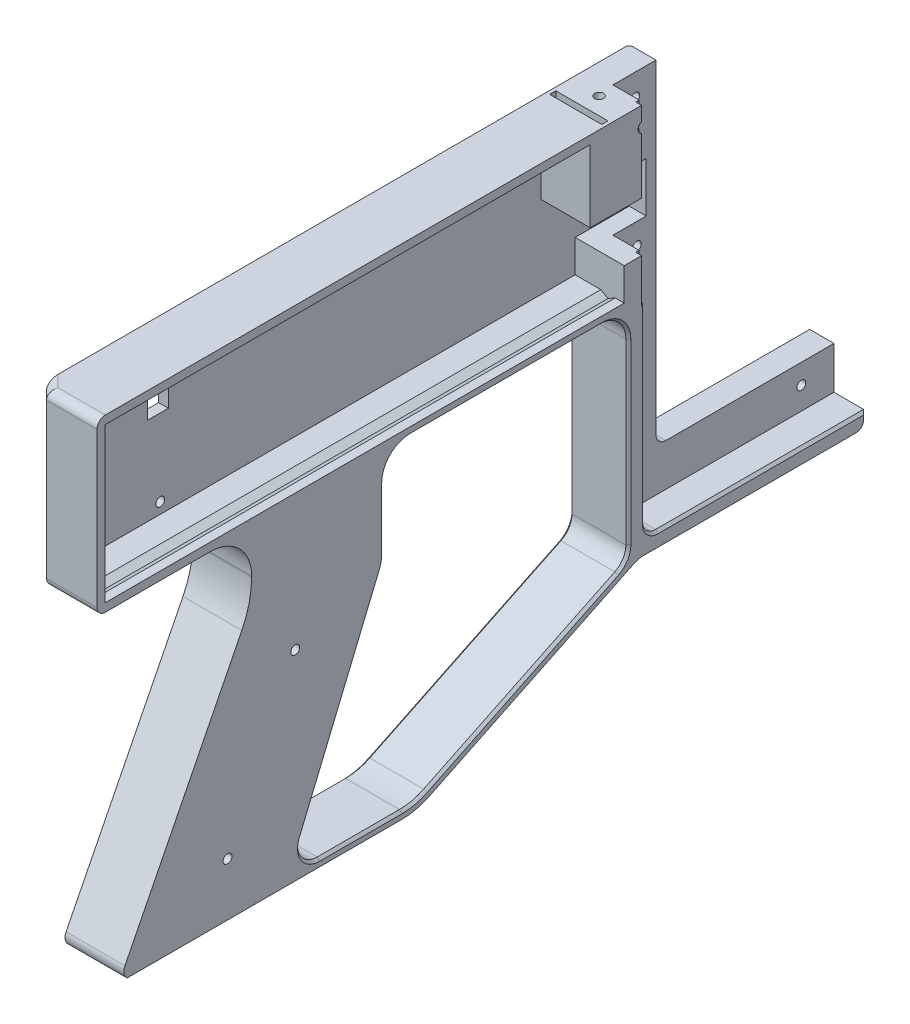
ISO-10303-21;
HEADER;
FILE_DESCRIPTION(('STEP AP214'),'2;1');
FILE_NAME('part.step','',(''),(''),'','','');
FILE_SCHEMA(('AUTOMOTIVE_DESIGN { 1 0 10303 214 1 1 1 1 }'));
ENDSEC;
DATA;
#1=APPLICATION_CONTEXT('core data for automotive mechanical design processes');
#2=APPLICATION_PROTOCOL_DEFINITION('international standard','automotive_design',2000,#1);
#3=PRODUCT_CONTEXT('',#1,'mechanical');
#4=PRODUCT('Part','Part','',(#3));
#5=PRODUCT_RELATED_PRODUCT_CATEGORY('part','',(#4));
#6=PRODUCT_DEFINITION_FORMATION('','',#4);
#7=PRODUCT_DEFINITION_CONTEXT('part definition',#1,'design');
#8=PRODUCT_DEFINITION('design','',#6,#7);
#9=PRODUCT_DEFINITION_SHAPE('','',#8);
#10=(LENGTH_UNIT() NAMED_UNIT(*) SI_UNIT(.MILLI.,.METRE.));
#11=(NAMED_UNIT(*) PLANE_ANGLE_UNIT() SI_UNIT($,.RADIAN.));
#12=(NAMED_UNIT(*) SI_UNIT($,.STERADIAN.) SOLID_ANGLE_UNIT());
#13=UNCERTAINTY_MEASURE_WITH_UNIT(LENGTH_MEASURE(1.E-05),#10,'distance_accuracy_value','');
#14=(GEOMETRIC_REPRESENTATION_CONTEXT(3) GLOBAL_UNCERTAINTY_ASSIGNED_CONTEXT((#13)) GLOBAL_UNIT_ASSIGNED_CONTEXT((#10,
#11,#12)) REPRESENTATION_CONTEXT('',''));
#15=CARTESIAN_POINT('',(0.,0.,0.));
#16=DIRECTION('',(0.,0.,1.));
#17=DIRECTION('',(1.,0.,0.));
#18=AXIS2_PLACEMENT_3D('',#15,#16,#17);
#19=CARTESIAN_POINT('',(18.,102.525,7.14499999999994));
#20=DIRECTION('',(-1.,0.,0.));
#21=DIRECTION('',(0.,0.,1.));
#22=AXIS2_PLACEMENT_3D('',#19,#20,#21);
#23=CYLINDRICAL_SURFACE('',#22,1.35255);
#24=CARTESIAN_POINT('',(0.,102.525,7.14499999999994));
#25=DIRECTION('',(-1.,0.,0.));
#26=DIRECTION('',(0.,0.,1.));
#27=AXIS2_PLACEMENT_3D('',#24,#25,#26);
#28=CIRCLE('',#27,1.35255);
#29=CARTESIAN_POINT('',(0.,102.525,8.49754999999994));
#30=VERTEX_POINT('',#29);
#31=EDGE_CURVE('E880',#30,#30,#28,.T.);
#32=ORIENTED_EDGE('',*,*,#31,.T.);
#33=EDGE_LOOP('',(#32));
#34=FACE_BOUND('',#33,.T.);
#35=CARTESIAN_POINT('',(8.2,102.525,7.14499999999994));
#36=DIRECTION('',(1.,0.,0.));
#37=DIRECTION('',(0.,0.,-1.));
#38=AXIS2_PLACEMENT_3D('',#35,#36,#37);
#39=CIRCLE('',#38,1.35255);
#40=CARTESIAN_POINT('',(8.2,102.525,5.79244999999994));
#41=VERTEX_POINT('',#40);
#42=EDGE_CURVE('E884',#41,#41,#39,.T.);
#43=ORIENTED_EDGE('',*,*,#42,.T.);
#44=EDGE_LOOP('',(#43));
#45=FACE_BOUND('',#44,.T.);
#46=ADVANCED_FACE('F60',(#34,#45),#23,.F.);
#47=CARTESIAN_POINT('',(3.,58.6600000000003,172.082599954));
#48=DIRECTION('',(0.,-1.,0.));
#49=DIRECTION('',(0.,0.,-1.));
#50=AXIS2_PLACEMENT_3D('',#47,#48,#49);
#51=PLANE('',#50);
#52=DIRECTION('',(0.,0.,1.));
#53=VECTOR('',#52,1.);
#54=CARTESIAN_POINT('',(10.8431680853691,58.6600000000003,19.0129617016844));
#55=LINE('',#54,#53);
#56=CARTESIAN_POINT('',(10.8431680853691,58.6600000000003,13.1826));
#57=VERTEX_POINT('',#56);
#58=CARTESIAN_POINT('',(10.8431680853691,58.6600000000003,172.082599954));
#59=VERTEX_POINT('',#58);
#60=EDGE_CURVE('E1877',#57,#59,#55,.T.);
#61=ORIENTED_EDGE('',*,*,#60,.F.);
#62=DIRECTION('',(1.,0.,0.));
#63=VECTOR('',#62,1.);
#64=CARTESIAN_POINT('',(3.,58.6600000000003,13.1826));
#65=LINE('',#64,#63);
#66=CARTESIAN_POINT('',(3.,58.6600000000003,13.1826));
#67=VERTEX_POINT('',#66);
#68=EDGE_CURVE('E1072',#67,#57,#65,.T.);
#69=ORIENTED_EDGE('',*,*,#68,.F.);
#70=DIRECTION('',(0.,0.,-1.));
#71=VECTOR('',#70,1.);
#72=CARTESIAN_POINT('',(3.,58.6600000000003,172.082599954));
#73=LINE('',#72,#71);
#74=CARTESIAN_POINT('',(3.,58.6600000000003,172.082599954));
#75=VERTEX_POINT('',#74);
#76=EDGE_CURVE('E990',#75,#67,#73,.T.);
#77=ORIENTED_EDGE('',*,*,#76,.F.);
#78=DIRECTION('',(1.,0.,0.));
#79=VECTOR('',#78,1.);
#80=CARTESIAN_POINT('',(3.,58.6600000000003,172.082599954));
#81=LINE('',#80,#79);
#82=EDGE_CURVE('E1077',#75,#59,#81,.T.);
#83=ORIENTED_EDGE('',*,*,#82,.T.);
#84=EDGE_LOOP('',(#61,#69,#77,#83));
#85=FACE_BOUND('',#84,.T.);
#86=ADVANCED_FACE('F1876',(#85),#51,.F.);
#87=CARTESIAN_POINT('',(3.,105.86,172.082599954));
#88=DIRECTION('',(0.,1.,0.));
#89=DIRECTION('',(0.,0.,1.));
#90=AXIS2_PLACEMENT_3D('',#87,#88,#89);
#91=PLANE('',#90);
#92=DIRECTION('',(0.,0.,1.));
#93=VECTOR('',#92,1.);
#94=CARTESIAN_POINT('',(10.8431680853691,105.86,19.0129617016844));
#95=LINE('',#94,#93);
#96=CARTESIAN_POINT('',(10.8431680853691,105.86,23.5920118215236));
#97=VERTEX_POINT('',#96);
#98=CARTESIAN_POINT('',(10.8431680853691,105.86,172.082599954));
#99=VERTEX_POINT('',#98);
#100=EDGE_CURVE('E831',#97,#99,#95,.T.);
#101=ORIENTED_EDGE('',*,*,#100,.T.);
#102=DIRECTION('',(1.,0.,0.));
#103=VECTOR('',#102,1.);
#104=CARTESIAN_POINT('',(3.,105.86,172.082599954));
#105=LINE('',#104,#103);
#106=CARTESIAN_POINT('',(3.,105.86,172.082599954));
#107=VERTEX_POINT('',#106);
#108=EDGE_CURVE('E1046',#107,#99,#105,.T.);
#109=ORIENTED_EDGE('',*,*,#108,.F.);
#110=DIRECTION('',(0.,0.,1.));
#111=VECTOR('',#110,1.);
#112=CARTESIAN_POINT('',(3.,105.86,172.082599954));
#113=LINE('',#112,#111);
#114=CARTESIAN_POINT('',(3.,105.86,23.5920118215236));
#115=VERTEX_POINT('',#114);
#116=EDGE_CURVE('E1014',#115,#107,#113,.T.);
#117=ORIENTED_EDGE('',*,*,#116,.F.);
#118=DIRECTION('',(1.,0.,0.));
#119=VECTOR('',#118,1.);
#120=CARTESIAN_POINT('',(3.,105.86,23.5920118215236));
#121=LINE('',#120,#119);
#122=EDGE_CURVE('E1052',#115,#97,#121,.T.);
#123=ORIENTED_EDGE('',*,*,#122,.T.);
#124=EDGE_LOOP('',(#101,#109,#117,#123));
#125=FACE_BOUND('',#124,.T.);
#126=ADVANCED_FACE('F1867',(#125),#91,.F.);
#127=DIRECTION('',(0.,0.,1.));
#128=VECTOR('',#127,1.);
#129=CARTESIAN_POINT('',(15.242577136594,105.86,19.0129617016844));
#130=LINE('',#129,#128);
#131=CARTESIAN_POINT('',(15.242577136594,105.86,23.5920118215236));
#132=VERTEX_POINT('',#131);
#133=CARTESIAN_POINT('',(15.242577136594,105.86,172.082599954));
#134=VERTEX_POINT('',#133);
#135=EDGE_CURVE('E819',#132,#134,#130,.T.);
#136=ORIENTED_EDGE('',*,*,#135,.F.);
#137=CARTESIAN_POINT('',(18.,105.86,23.5920118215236));
#138=VERTEX_POINT('',#137);
#139=EDGE_CURVE('E1056',#132,#138,#121,.T.);
#140=ORIENTED_EDGE('',*,*,#139,.T.);
#141=DIRECTION('',(0.,0.,1.));
#142=VECTOR('',#141,1.);
#143=CARTESIAN_POINT('',(18.,105.86,172.082599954));
#144=LINE('',#143,#142);
#145=CARTESIAN_POINT('',(18.,105.86,172.082599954));
#146=VERTEX_POINT('',#145);
#147=EDGE_CURVE('E991',#138,#146,#144,.T.);
#148=ORIENTED_EDGE('',*,*,#147,.T.);
#149=EDGE_CURVE('E1051',#134,#146,#105,.T.);
#150=ORIENTED_EDGE('',*,*,#149,.F.);
#151=EDGE_LOOP('',(#136,#140,#148,#150));
#152=FACE_BOUND('',#151,.T.);
#153=ADVANCED_FACE('F2107',(#152),#91,.F.);
#154=CARTESIAN_POINT('',(8.2,108.4,6.83260000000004));
#155=DIRECTION('',(0.,0.,1.));
#156=DIRECTION('',(0.,-1.,0.));
#157=AXIS2_PLACEMENT_3D('',#154,#155,#156);
#158=PLANE('',#157);
#159=DIRECTION('',(0.,1.,0.));
#160=VECTOR('',#159,1.);
#161=CARTESIAN_POINT('',(16.222,108.4,6.83260000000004));
#162=LINE('',#161,#160);
#163=CARTESIAN_POINT('',(16.222,104.275340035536,6.83260000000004));
#164=VERTEX_POINT('',#163);
#165=CARTESIAN_POINT('',(16.222,108.4,6.83260000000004));
#166=VERTEX_POINT('',#165);
#167=EDGE_CURVE('E800',#164,#166,#162,.T.);
#168=ORIENTED_EDGE('',*,*,#167,.F.);
#169=DIRECTION('',(1.,0.,0.));
#170=VECTOR('',#169,1.);
#171=CARTESIAN_POINT('',(3.17105657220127,104.275340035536,6.83260000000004));
#172=LINE('',#171,#170);
#173=CARTESIAN_POINT('',(8.2,104.275340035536,6.83260000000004));
#174=VERTEX_POINT('',#173);
#175=EDGE_CURVE('E3280',#164,#174,#172,.F.);
#176=ORIENTED_EDGE('',*,*,#175,.T.);
#177=DIRECTION('',(0.,-1.,0.));
#178=VECTOR('',#177,1.);
#179=CARTESIAN_POINT('',(8.2,108.4,6.83260000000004));
#180=LINE('',#179,#178);
#181=CARTESIAN_POINT('',(8.2,108.4,6.83260000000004));
#182=VERTEX_POINT('',#181);
#183=EDGE_CURVE('E1087',#182,#174,#180,.T.);
#184=ORIENTED_EDGE('',*,*,#183,.F.);
#185=DIRECTION('',(1.,0.,0.));
#186=VECTOR('',#185,1.);
#187=CARTESIAN_POINT('',(8.2,108.4,6.83260000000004));
#188=LINE('',#187,#186);
#189=EDGE_CURVE('E1098',#182,#166,#188,.T.);
#190=ORIENTED_EDGE('',*,*,#189,.T.);
#191=EDGE_LOOP('',(#168,#176,#184,#190));
#192=FACE_BOUND('',#191,.T.);
#193=ADVANCED_FACE('F2130',(#192),#158,.F.);
#194=CARTESIAN_POINT('',(8.2,100.774659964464,6.83260000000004));
#195=VERTEX_POINT('',#194);
#196=CARTESIAN_POINT('',(8.2,83.82,6.83260000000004));
#197=VERTEX_POINT('',#196);
#198=EDGE_CURVE('E1092',#195,#197,#180,.T.);
#199=ORIENTED_EDGE('',*,*,#198,.F.);
#200=DIRECTION('',(1.,0.,0.));
#201=VECTOR('',#200,1.);
#202=CARTESIAN_POINT('',(3.17105657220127,100.774659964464,6.83260000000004));
#203=LINE('',#202,#201);
#204=CARTESIAN_POINT('',(16.222,100.774659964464,6.83260000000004));
#205=VERTEX_POINT('',#204);
#206=EDGE_CURVE('E776',#195,#205,#203,.T.);
#207=ORIENTED_EDGE('',*,*,#206,.T.);
#208=CARTESIAN_POINT('',(16.222,83.82,6.83260000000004));
#209=VERTEX_POINT('',#208);
#210=EDGE_CURVE('E840',#209,#205,#162,.T.);
#211=ORIENTED_EDGE('',*,*,#210,.F.);
#212=DIRECTION('',(-1.,0.,0.));
#213=VECTOR('',#212,1.);
#214=CARTESIAN_POINT('',(8.2,83.82,6.83260000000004));
#215=LINE('',#214,#213);
#216=EDGE_CURVE('E1206',#209,#197,#215,.T.);
#217=ORIENTED_EDGE('',*,*,#216,.T.);
#218=EDGE_LOOP('',(#199,#207,#211,#217));
#219=FACE_BOUND('',#218,.T.);
#220=ADVANCED_FACE('F1833',(#219),#158,.F.);
#221=CARTESIAN_POINT('',(18.,108.4,-6.35000000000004));
#222=DIRECTION('',(0.,0.,1.));
#223=DIRECTION('',(0.,-1.,0.));
#224=AXIS2_PLACEMENT_3D('',#221,#222,#223);
#225=PLANE('',#224);
#226=DIRECTION('',(-1.,0.,0.));
#227=VECTOR('',#226,1.);
#228=CARTESIAN_POINT('',(0.,9.0960000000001,-6.35000000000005));
#229=LINE('',#228,#227);
#230=CARTESIAN_POINT('',(8.2,9.0960000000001,-6.35000000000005));
#231=VERTEX_POINT('',#230);
#232=CARTESIAN_POINT('',(0.762000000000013,9.0960000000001,-6.35000000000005));
#233=VERTEX_POINT('',#232);
#234=EDGE_CURVE('E1298',#231,#233,#229,.T.);
#235=ORIENTED_EDGE('',*,*,#234,.T.);
#236=DIRECTION('',(0.,1.,0.));
#237=VECTOR('',#236,1.);
#238=CARTESIAN_POINT('',(0.762000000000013,108.4,-6.35000000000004));
#239=LINE('',#238,#237);
#240=CARTESIAN_POINT('',(0.762000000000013,108.4,-6.35000000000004));
#241=VERTEX_POINT('',#240);
#242=EDGE_CURVE('E1561',#233,#241,#239,.T.);
#243=ORIENTED_EDGE('',*,*,#242,.T.);
#244=DIRECTION('',(-1.,0.,0.));
#245=VECTOR('',#244,1.);
#246=CARTESIAN_POINT('',(18.,108.4,-6.35000000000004));
#247=LINE('',#246,#245);
#248=CARTESIAN_POINT('',(8.2,108.4,-6.35000000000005));
#249=VERTEX_POINT('',#248);
#250=EDGE_CURVE('E1184',#249,#241,#247,.T.);
#251=ORIENTED_EDGE('',*,*,#250,.F.);
#252=DIRECTION('',(0.,1.,0.));
#253=VECTOR('',#252,1.);
#254=CARTESIAN_POINT('',(8.2,108.4,-6.35000000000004));
#255=LINE('',#254,#253);
#256=EDGE_CURVE('E1109',#231,#249,#255,.T.);
#257=ORIENTED_EDGE('',*,*,#256,.F.);
#258=EDGE_LOOP('',(#235,#243,#251,#257));
#259=FACE_BOUND('',#258,.T.);
#260=ADVANCED_FACE('F1943',(#259),#225,.F.);
#261=CARTESIAN_POINT('',(18.,50.8,0.));
#262=DIRECTION('',(-1.,0.,0.));
#263=DIRECTION('',(0.,0.,1.));
#264=AXIS2_PLACEMENT_3D('',#261,#262,#263);
#265=CYLINDRICAL_SURFACE('',#264,1.35255);
#266=CARTESIAN_POINT('',(0.,50.8,0.));
#267=DIRECTION('',(1.,0.,0.));
#268=DIRECTION('',(0.,0.,-1.));
#269=AXIS2_PLACEMENT_3D('',#266,#267,#268);
#270=CIRCLE('',#269,1.35255);
#271=CARTESIAN_POINT('',(0.,50.8,-1.35255000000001));
#272=VERTEX_POINT('',#271);
#273=EDGE_CURVE('E1164',#272,#272,#270,.T.);
#274=ORIENTED_EDGE('',*,*,#273,.F.);
#275=EDGE_LOOP('',(#274));
#276=FACE_BOUND('',#275,.T.);
#277=CARTESIAN_POINT('',(8.2,50.8,0.));
#278=DIRECTION('',(1.,0.,0.));
#279=DIRECTION('',(0.,0.,-1.));
#280=AXIS2_PLACEMENT_3D('',#277,#278,#279);
#281=CIRCLE('',#280,1.35255);
#282=CARTESIAN_POINT('',(8.2,50.8,-1.35255000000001));
#283=VERTEX_POINT('',#282);
#284=EDGE_CURVE('E1120',#283,#283,#281,.T.);
#285=ORIENTED_EDGE('',*,*,#284,.T.);
#286=EDGE_LOOP('',(#285));
#287=FACE_BOUND('',#286,.T.);
#288=ADVANCED_FACE('F2174',(#276,#287),#265,.F.);
#289=CARTESIAN_POINT('',(18.,0.,0.));
#290=DIRECTION('',(-1.,0.,0.));
#291=DIRECTION('',(0.,0.,1.));
#292=AXIS2_PLACEMENT_3D('',#289,#290,#291);
#293=CYLINDRICAL_SURFACE('',#292,1.35255);
#294=CARTESIAN_POINT('',(0.,0.,0.));
#295=DIRECTION('',(1.,0.,0.));
#296=DIRECTION('',(0.,0.,-1.));
#297=AXIS2_PLACEMENT_3D('',#294,#295,#296);
#298=CIRCLE('',#297,1.35255);
#299=CARTESIAN_POINT('',(0.,0.,-1.35255));
#300=VERTEX_POINT('',#299);
#301=EDGE_CURVE('E1160',#300,#300,#298,.T.);
#302=ORIENTED_EDGE('',*,*,#301,.F.);
#303=EDGE_LOOP('',(#302));
#304=FACE_BOUND('',#303,.T.);
#305=CARTESIAN_POINT('',(8.2,0.,0.));
#306=DIRECTION('',(1.,0.,0.));
#307=DIRECTION('',(0.,0.,-1.));
#308=AXIS2_PLACEMENT_3D('',#305,#306,#307);
#309=CIRCLE('',#308,1.35255);
#310=CARTESIAN_POINT('',(8.2,0.,-1.35255));
#311=VERTEX_POINT('',#310);
#312=EDGE_CURVE('E1116',#311,#311,#309,.T.);
#313=ORIENTED_EDGE('',*,*,#312,.T.);
#314=EDGE_LOOP('',(#313));
#315=FACE_BOUND('',#314,.T.);
#316=ADVANCED_FACE('F2170',(#304,#315),#293,.F.);
#317=CARTESIAN_POINT('',(18.,101.6,0.));
#318=DIRECTION('',(-1.,0.,0.));
#319=DIRECTION('',(0.,0.,1.));
#320=AXIS2_PLACEMENT_3D('',#317,#318,#319);
#321=CYLINDRICAL_SURFACE('',#320,1.35255);
#322=CARTESIAN_POINT('',(0.,101.6,0.));
#323=DIRECTION('',(1.,0.,0.));
#324=DIRECTION('',(0.,0.,-1.));
#325=AXIS2_PLACEMENT_3D('',#322,#323,#324);
#326=CIRCLE('',#325,1.35255);
#327=CARTESIAN_POINT('',(0.,101.6,-1.35255000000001));
#328=VERTEX_POINT('',#327);
#329=EDGE_CURVE('E1156',#328,#328,#326,.T.);
#330=ORIENTED_EDGE('',*,*,#329,.F.);
#331=EDGE_LOOP('',(#330));
#332=FACE_BOUND('',#331,.T.);
#333=CARTESIAN_POINT('',(8.2,101.6,0.));
#334=DIRECTION('',(1.,0.,0.));
#335=DIRECTION('',(0.,0.,-1.));
#336=AXIS2_PLACEMENT_3D('',#333,#334,#335);
#337=CIRCLE('',#336,1.35255);
#338=CARTESIAN_POINT('',(8.2,101.6,-1.35255000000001));
#339=VERTEX_POINT('',#338);
#340=EDGE_CURVE('E1112',#339,#339,#337,.T.);
#341=ORIENTED_EDGE('',*,*,#340,.T.);
#342=EDGE_LOOP('',(#341));
#343=FACE_BOUND('',#342,.T.);
#344=ADVANCED_FACE('F2161',(#332,#343),#321,.F.);
#345=CARTESIAN_POINT('',(75.358762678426,6.0960000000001,-6.35000000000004));
#346=DIRECTION('',(0.,-1.,0.));
#347=DIRECTION('',(0.,0.,-1.));
#348=AXIS2_PLACEMENT_3D('',#345,#346,#347);
#349=PLANE('',#348);
#350=DIRECTION('',(-1.,0.,0.));
#351=VECTOR('',#350,1.);
#352=CARTESIAN_POINT('',(75.358762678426,6.0960000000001,-60.8));
#353=LINE('',#352,#351);
#354=CARTESIAN_POINT('',(8.20000000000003,6.0960000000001,-60.8));
#355=VERTEX_POINT('',#354);
#356=CARTESIAN_POINT('',(0.76200000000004,6.0960000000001,-60.8));
#357=VERTEX_POINT('',#356);
#358=EDGE_CURVE('E1153',#355,#357,#353,.T.);
#359=ORIENTED_EDGE('',*,*,#358,.T.);
#360=DIRECTION('',(0.,0.,1.));
#361=VECTOR('',#360,1.);
#362=CARTESIAN_POINT('',(0.762000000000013,6.0960000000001,-9.35000000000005));
#363=LINE('',#362,#361);
#364=CARTESIAN_POINT('',(0.762000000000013,6.0960000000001,-9.35000000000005));
#365=VERTEX_POINT('',#364);
#366=EDGE_CURVE('E1555',#357,#365,#363,.T.);
#367=ORIENTED_EDGE('',*,*,#366,.T.);
#368=DIRECTION('',(-1.,0.,0.));
#369=VECTOR('',#368,1.);
#370=CARTESIAN_POINT('',(8.2,6.0960000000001,-9.35000000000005));
#371=LINE('',#370,#369);
#372=CARTESIAN_POINT('',(8.2,6.0960000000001,-9.35000000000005));
#373=VERTEX_POINT('',#372);
#374=EDGE_CURVE('E1302',#365,#373,#371,.F.);
#375=ORIENTED_EDGE('',*,*,#374,.T.);
#376=DIRECTION('',(0.,0.,1.));
#377=VECTOR('',#376,1.);
#378=CARTESIAN_POINT('',(8.2,6.0960000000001,-6.35000000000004));
#379=LINE('',#378,#377);
#380=EDGE_CURVE('E1103',#355,#373,#379,.T.);
#381=ORIENTED_EDGE('',*,*,#380,.F.);
#382=EDGE_LOOP('',(#359,#367,#375,#381));
#383=FACE_BOUND('',#382,.T.);
#384=ADVANCED_FACE('F1926',(#383),#349,.F.);
#385=CARTESIAN_POINT('',(75.358762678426,0.,-50.8));
#386=DIRECTION('',(-1.,0.,0.));
#387=DIRECTION('',(0.,0.,1.));
#388=AXIS2_PLACEMENT_3D('',#385,#386,#387);
#389=CYLINDRICAL_SURFACE('',#388,1.35255);
#390=CARTESIAN_POINT('',(0.,0.,-50.8));
#391=DIRECTION('',(1.,0.,0.));
#392=DIRECTION('',(0.,0.,-1.));
#393=AXIS2_PLACEMENT_3D('',#390,#391,#392);
#394=CIRCLE('',#393,1.35255);
#395=CARTESIAN_POINT('',(0.,0.,-49.44745));
#396=VERTEX_POINT('',#395);
#397=EDGE_CURVE('E1150',#396,#396,#394,.T.);
#398=CARTESIAN_POINT('',(8.2,0.,-50.8));
#399=DIRECTION('',(1.,0.,0.));
#400=DIRECTION('',(0.,0.,-1.));
#401=AXIS2_PLACEMENT_3D('',#398,#399,#400);
#402=CIRCLE('',#401,1.35255);
#403=CARTESIAN_POINT('',(8.19999999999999,0.,-49.44745));
#404=VERTEX_POINT('',#403);
#405=EDGE_CURVE('E1102',#404,#404,#402,.T.);
#406=CARTESIAN_POINT('',(0.,0.,-49.44745));
#407=CARTESIAN_POINT('',(0.0854166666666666,0.,-49.44745));
#408=CARTESIAN_POINT('',(0.170833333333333,0.,-49.44745));
#409=CARTESIAN_POINT('',(0.341666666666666,0.,-49.44745));
#410=CARTESIAN_POINT('',(0.427083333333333,0.,-49.44745));
#411=CARTESIAN_POINT('',(0.597916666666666,0.,-49.44745));
#412=CARTESIAN_POINT('',(0.683333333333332,0.,-49.44745));
#413=CARTESIAN_POINT('',(0.854166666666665,0.,-49.44745));
#414=CARTESIAN_POINT('',(0.939583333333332,0.,-49.44745));
#415=CARTESIAN_POINT('',(1.11041666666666,0.,-49.44745));
#416=CARTESIAN_POINT('',(1.19583333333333,0.,-49.44745));
#417=CARTESIAN_POINT('',(1.36666666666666,0.,-49.44745));
#418=CARTESIAN_POINT('',(1.45208333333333,0.,-49.44745));
#419=CARTESIAN_POINT('',(1.62291666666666,0.,-49.44745));
#420=CARTESIAN_POINT('',(1.70833333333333,0.,-49.44745));
#421=CARTESIAN_POINT('',(1.87916666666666,0.,-49.44745));
#422=CARTESIAN_POINT('',(1.96458333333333,0.,-49.44745));
#423=CARTESIAN_POINT('',(2.13541666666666,0.,-49.44745));
#424=CARTESIAN_POINT('',(2.22083333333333,0.,-49.44745));
#425=CARTESIAN_POINT('',(2.39166666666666,0.,-49.44745));
#426=CARTESIAN_POINT('',(2.47708333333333,0.,-49.44745));
#427=CARTESIAN_POINT('',(2.64791666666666,0.,-49.44745));
#428=CARTESIAN_POINT('',(2.73333333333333,0.,-49.44745));
#429=CARTESIAN_POINT('',(2.90416666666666,0.,-49.44745));
#430=CARTESIAN_POINT('',(2.98958333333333,0.,-49.44745));
#431=CARTESIAN_POINT('',(3.16041666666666,0.,-49.44745));
#432=CARTESIAN_POINT('',(3.24583333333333,0.,-49.44745));
#433=CARTESIAN_POINT('',(3.41666666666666,0.,-49.44745));
#434=CARTESIAN_POINT('',(3.50208333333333,0.,-49.44745));
#435=CARTESIAN_POINT('',(3.67291666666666,0.,-49.44745));
#436=CARTESIAN_POINT('',(3.75833333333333,0.,-49.44745));
#437=CARTESIAN_POINT('',(3.92916666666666,0.,-49.44745));
#438=CARTESIAN_POINT('',(4.01458333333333,0.,-49.44745));
#439=CARTESIAN_POINT('',(4.18541666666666,0.,-49.44745));
#440=CARTESIAN_POINT('',(4.27083333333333,0.,-49.44745));
#441=CARTESIAN_POINT('',(4.44166666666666,0.,-49.44745));
#442=CARTESIAN_POINT('',(4.52708333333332,0.,-49.44745));
#443=CARTESIAN_POINT('',(4.69791666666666,0.,-49.44745));
#444=CARTESIAN_POINT('',(4.78333333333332,0.,-49.44745));
#445=CARTESIAN_POINT('',(4.95416666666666,0.,-49.44745));
#446=CARTESIAN_POINT('',(5.03958333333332,0.,-49.44745));
#447=CARTESIAN_POINT('',(5.21041666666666,0.,-49.44745));
#448=CARTESIAN_POINT('',(5.29583333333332,0.,-49.44745));
#449=CARTESIAN_POINT('',(5.46666666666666,0.,-49.44745));
#450=CARTESIAN_POINT('',(5.55208333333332,0.,-49.44745));
#451=CARTESIAN_POINT('',(5.72291666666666,0.,-49.44745));
#452=CARTESIAN_POINT('',(5.80833333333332,0.,-49.44745));
#453=CARTESIAN_POINT('',(5.97916666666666,0.,-49.44745));
#454=CARTESIAN_POINT('',(6.06458333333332,0.,-49.44745));
#455=CARTESIAN_POINT('',(6.23541666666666,0.,-49.44745));
#456=CARTESIAN_POINT('',(6.32083333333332,0.,-49.44745));
#457=CARTESIAN_POINT('',(6.49166666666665,0.,-49.44745));
#458=CARTESIAN_POINT('',(6.57708333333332,0.,-49.44745));
#459=CARTESIAN_POINT('',(6.74791666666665,0.,-49.44745));
#460=CARTESIAN_POINT('',(6.83333333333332,0.,-49.44745));
#461=CARTESIAN_POINT('',(7.00416666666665,0.,-49.44745));
#462=CARTESIAN_POINT('',(7.08958333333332,0.,-49.44745));
#463=CARTESIAN_POINT('',(7.26041666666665,0.,-49.44745));
#464=CARTESIAN_POINT('',(7.34583333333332,0.,-49.44745));
#465=CARTESIAN_POINT('',(7.51666666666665,0.,-49.44745));
#466=CARTESIAN_POINT('',(7.60208333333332,0.,-49.44745));
#467=CARTESIAN_POINT('',(7.77291666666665,0.,-49.44745));
#468=CARTESIAN_POINT('',(7.85833333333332,0.,-49.44745));
#469=CARTESIAN_POINT('',(8.02916666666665,0.,-49.44745));
#470=CARTESIAN_POINT('',(8.11458333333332,0.,-49.44745));
#471=CARTESIAN_POINT('',(8.19999999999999,0.,-49.44745));
#472=B_SPLINE_CURVE_WITH_KNOTS('',3,(#406,#407,#408,#409,#410,#411,#412,#413,#414,#415,#416,
#417,#418,#419,#420,#421,#422,#423,#424,#425,#426,#427,#428,#429,#430,#431,#432,#433,#434,#435,
#436,#437,#438,#439,#440,#441,#442,#443,#444,#445,#446,#447,#448,#449,#450,#451,#452,#453,#454,
#455,#456,#457,#458,#459,#460,#461,#462,#463,#464,#465,#466,#467,#468,#469,#470,#471),
.UNSPECIFIED.,.F.,.F.,(4,2,2,2,2,2,2,2,2,2,2,2,2,2,2,2,2,2,2,2,2,2,2,2,2,2,2,2,2,2,2,2,4),(0.,
0.25625,0.512499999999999,0.768749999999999,1.025,1.28125,1.5375,1.79375,2.05,2.30625,2.5625,
2.81874999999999,3.07499999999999,3.33124999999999,3.58749999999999,3.84374999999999,
4.09999999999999,4.35624999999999,4.61249999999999,4.86874999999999,5.12499999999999,
5.38124999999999,5.63749999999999,5.89374999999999,6.14999999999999,6.40624999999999,
6.66249999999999,6.91874999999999,7.17499999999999,7.43124999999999,7.68749999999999,
7.94374999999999,8.19999999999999),.UNSPECIFIED.);
#473=EDGE_CURVE('BSEAM2160',#396,#404,#472,.T.);
#474=ORIENTED_EDGE('',*,*,#397,.F.);
#475=ORIENTED_EDGE('',*,*,#405,.T.);
#476=ORIENTED_EDGE('',*,*,#473,.T.);
#477=ORIENTED_EDGE('',*,*,#473,.F.);
#478=EDGE_LOOP('',(#474,#476,#475,#477));
#479=FACE_BOUND('',#478,.T.);
#480=ADVANCED_FACE('F2160',(#479),#389,.F.);
#481=CARTESIAN_POINT('',(18.,27.1200000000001,86.6110146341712));
#482=DIRECTION('',(0.,0.384615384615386,0.923076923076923));
#483=DIRECTION('',(0.,-0.923076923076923,0.384615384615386));
#484=AXIS2_PLACEMENT_3D('',#481,#482,#483);
#485=PLANE('',#484);
#486=DIRECTION('',(-1.,0.,0.));
#487=VECTOR('',#486,1.);
#488=CARTESIAN_POINT('',(18.,25.2738461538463,87.380245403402));
#489=LINE('',#488,#487);
#490=CARTESIAN_POINT('',(0.76200000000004,25.2738461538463,87.380245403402));
#491=VERTEX_POINT('',#490);
#492=CARTESIAN_POINT('',(17.238,25.2738461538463,87.380245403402));
#493=VERTEX_POINT('',#492);
#494=EDGE_CURVE('E1254',#491,#493,#489,.F.);
#495=ORIENTED_EDGE('',*,*,#494,.T.);
#496=DIRECTION('',(0.,-0.923076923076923,0.384615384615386));
#497=VECTOR('',#496,1.);
#498=CARTESIAN_POINT('',(17.238,27.1200000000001,86.6110146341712));
#499=LINE('',#498,#497);
#500=CARTESIAN_POINT('',(17.238,-33.5723076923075,111.899476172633));
#501=VERTEX_POINT('',#500);
#502=EDGE_CURVE('E1507',#493,#501,#499,.T.);
#503=ORIENTED_EDGE('',*,*,#502,.T.);
#504=DIRECTION('',(1.,0.,0.));
#505=VECTOR('',#504,1.);
#506=CARTESIAN_POINT('',(0.,-33.5723076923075,111.899476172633));
#507=LINE('',#506,#505);
#508=CARTESIAN_POINT('',(0.76200000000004,-33.5723076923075,111.899476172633));
#509=VERTEX_POINT('',#508);
#510=EDGE_CURVE('E1262',#501,#509,#507,.F.);
#511=ORIENTED_EDGE('',*,*,#510,.T.);
#512=DIRECTION('',(0.,0.923076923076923,-0.384615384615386));
#513=VECTOR('',#512,1.);
#514=CARTESIAN_POINT('',(0.76200000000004,25.2738461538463,87.380245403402));
#515=LINE('',#514,#513);
#516=EDGE_CURVE('E1504',#509,#491,#515,.T.);
#517=ORIENTED_EDGE('',*,*,#516,.T.);
#518=EDGE_LOOP('',(#495,#503,#511,#517));
#519=FACE_BOUND('',#518,.T.);
#520=ADVANCED_FACE('F2166',(#519),#485,.F.);
#521=CARTESIAN_POINT('',(18.,-11.938,11.9126000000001));
#522=DIRECTION('',(0.,0.,-1.));
#523=DIRECTION('',(-1.,0.,0.));
#524=AXIS2_PLACEMENT_3D('',#521,#522,#523);
#525=PLANE('',#524);
#526=DIRECTION('',(-1.,0.,0.));
#527=VECTOR('',#526,1.);
#528=CARTESIAN_POINT('',(18.,-6.45580472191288,11.9126000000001));
#529=LINE('',#528,#527);
#530=CARTESIAN_POINT('',(0.762000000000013,-6.45580472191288,11.9126000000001));
#531=VERTEX_POINT('',#530);
#532=CARTESIAN_POINT('',(17.238,-6.45580472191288,11.9126000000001));
#533=VERTEX_POINT('',#532);
#534=EDGE_CURVE('E1270',#531,#533,#529,.F.);
#535=ORIENTED_EDGE('',*,*,#534,.T.);
#536=DIRECTION('',(0.,1.,0.));
#537=VECTOR('',#536,1.);
#538=CARTESIAN_POINT('',(17.238,-11.938,11.9126000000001));
#539=LINE('',#538,#537);
#540=CARTESIAN_POINT('',(17.238,48.12,11.9126000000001));
#541=VERTEX_POINT('',#540);
#542=EDGE_CURVE('E1530',#533,#541,#539,.T.);
#543=ORIENTED_EDGE('',*,*,#542,.T.);
#544=DIRECTION('',(-1.,0.,0.));
#545=VECTOR('',#544,1.);
#546=CARTESIAN_POINT('',(0.,48.12,11.9126000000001));
#547=LINE('',#546,#545);
#548=CARTESIAN_POINT('',(0.762000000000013,48.12,11.9126000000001));
#549=VERTEX_POINT('',#548);
#550=EDGE_CURVE('E1235',#541,#549,#547,.T.);
#551=ORIENTED_EDGE('',*,*,#550,.T.);
#552=DIRECTION('',(0.,-1.,0.));
#553=VECTOR('',#552,1.);
#554=CARTESIAN_POINT('',(0.762000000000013,-6.45580472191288,11.9126000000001));
#555=LINE('',#554,#553);
#556=EDGE_CURVE('E1527',#549,#531,#555,.T.);
#557=ORIENTED_EDGE('',*,*,#556,.T.);
#558=EDGE_LOOP('',(#535,#543,#551,#557));
#559=FACE_BOUND('',#558,.T.);
#560=ADVANCED_FACE('F2194',(#559),#525,.F.);
#561=CARTESIAN_POINT('',(18.,-11.938,-6.35000000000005));
#562=DIRECTION('',(0.,1.,0.));
#563=DIRECTION('',(0.,0.,1.));
#564=AXIS2_PLACEMENT_3D('',#561,#562,#563);
#565=PLANE('',#564);
#566=DIRECTION('',(1.,0.,0.));
#567=VECTOR('',#566,1.);
#568=CARTESIAN_POINT('',(18.,-11.938,7.20735431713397));
#569=LINE('',#568,#567);
#570=CARTESIAN_POINT('',(17.238,-11.938,7.20735431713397));
#571=VERTEX_POINT('',#570);
#572=CARTESIAN_POINT('',(0.761999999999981,-11.938,7.20735431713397));
#573=VERTEX_POINT('',#572);
#574=EDGE_CURVE('E1278',#571,#573,#569,.F.);
#575=ORIENTED_EDGE('',*,*,#574,.T.);
#576=DIRECTION('',(0.,0.,-1.));
#577=VECTOR('',#576,1.);
#578=CARTESIAN_POINT('',(0.761999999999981,-11.938,-57.8));
#579=LINE('',#578,#577);
#580=CARTESIAN_POINT('',(0.761999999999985,-11.938,-57.8));
#581=VERTEX_POINT('',#580);
#582=EDGE_CURVE('E1378',#573,#581,#579,.T.);
#583=ORIENTED_EDGE('',*,*,#582,.T.);
#584=DIRECTION('',(-1.,0.,0.));
#585=VECTOR('',#584,1.);
#586=CARTESIAN_POINT('',(18.,-11.938,-57.8));
#587=LINE('',#586,#585);
#588=CARTESIAN_POINT('',(17.238,-11.938,-57.8));
#589=VERTEX_POINT('',#588);
#590=EDGE_CURVE('E1295',#581,#589,#587,.F.);
#591=ORIENTED_EDGE('',*,*,#590,.T.);
#592=DIRECTION('',(0.,0.,1.));
#593=VECTOR('',#592,1.);
#594=CARTESIAN_POINT('',(17.238,-11.938,-6.35000000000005));
#595=LINE('',#594,#593);
#596=EDGE_CURVE('E1375',#589,#571,#595,.T.);
#597=ORIENTED_EDGE('',*,*,#596,.T.);
#598=EDGE_LOOP('',(#575,#583,#591,#597));
#599=FACE_BOUND('',#598,.T.);
#600=ADVANCED_FACE('F2181',(#599),#565,.F.);
#601=CARTESIAN_POINT('',(18.,0.,0.));
#602=DIRECTION('',(-1.,0.,0.));
#603=DIRECTION('',(0.,0.,1.));
#604=AXIS2_PLACEMENT_3D('',#601,#602,#603);
#605=PLANE('',#604);
#606=CARTESIAN_POINT('',(18.,-35.8799999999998,106.361014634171));
#607=DIRECTION('',(-1.,0.,0.));
#608=DIRECTION('',(0.,0.,1.));
#609=AXIS2_PLACEMENT_3D('',#606,#607,#608);
#610=CIRCLE('',#609,6.76199999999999);
#611=CARTESIAN_POINT('',(18.,-42.6419999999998,106.361014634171));
#612=VERTEX_POINT('',#611);
#613=CARTESIAN_POINT('',(18.,-33.2792307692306,112.602860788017));
#614=VERTEX_POINT('',#613);
#615=EDGE_CURVE('E1445',#612,#614,#610,.T.);
#616=ORIENTED_EDGE('',*,*,#615,.T.);
#617=DIRECTION('',(0.,0.923076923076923,-0.384615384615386));
#618=VECTOR('',#617,1.);
#619=CARTESIAN_POINT('',(18.,35.0543838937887,84.1305213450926));
#620=LINE('',#619,#618);
#621=CARTESIAN_POINT('',(18.,25.5669230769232,88.0836300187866));
#622=VERTEX_POINT('',#621);
#623=EDGE_CURVE('E1451',#614,#622,#620,.T.);
#624=ORIENTED_EDGE('',*,*,#623,.T.);
#625=CARTESIAN_POINT('',(18.,29.1200000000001,96.6110146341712));
#626=DIRECTION('',(-1.,0.,0.));
#627=DIRECTION('',(0.,0.,1.));
#628=AXIS2_PLACEMENT_3D('',#625,#626,#627);
#629=CIRCLE('',#628,9.23800000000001);
#630=CARTESIAN_POINT('',(18.,29.1200000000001,87.3730146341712));
#631=VERTEX_POINT('',#630);
#632=EDGE_CURVE('E1448',#622,#631,#629,.F.);
#633=ORIENTED_EDGE('',*,*,#632,.T.);
#634=DIRECTION('',(0.,1.,0.));
#635=VECTOR('',#634,1.);
#636=CARTESIAN_POINT('',(18.,0.,87.3730146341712));
#637=LINE('',#636,#635);
#638=CARTESIAN_POINT('',(18.,48.1200000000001,87.3730146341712));
#639=VERTEX_POINT('',#638);
#640=EDGE_CURVE('E1442',#631,#639,#637,.T.);
#641=ORIENTED_EDGE('',*,*,#640,.T.);
#642=CARTESIAN_POINT('',(18.,48.1200000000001,78.6110146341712));
#643=DIRECTION('',(-1.,0.,0.));
#644=DIRECTION('',(0.,0.,1.));
#645=AXIS2_PLACEMENT_3D('',#642,#643,#644);
#646=CIRCLE('',#645,8.76199999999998);
#647=CARTESIAN_POINT('',(18.,56.882,78.6110146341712));
#648=VERTEX_POINT('',#647);
#649=EDGE_CURVE('E1436',#639,#648,#646,.T.);
#650=ORIENTED_EDGE('',*,*,#649,.T.);
#651=DIRECTION('',(0.,0.,-1.));
#652=VECTOR('',#651,1.);
#653=CARTESIAN_POINT('',(18.,56.8819999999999,0.));
#654=LINE('',#653,#652);
#655=CARTESIAN_POINT('',(18.,56.882,19.9126000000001));
#656=VERTEX_POINT('',#655);
#657=EDGE_CURVE('E1431',#648,#656,#654,.T.);
#658=ORIENTED_EDGE('',*,*,#657,.T.);
#659=CARTESIAN_POINT('',(18.,48.12,19.9126000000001));
#660=DIRECTION('',(-1.,0.,0.));
#661=DIRECTION('',(0.,0.,1.));
#662=AXIS2_PLACEMENT_3D('',#659,#660,#661);
#663=CIRCLE('',#662,8.76199999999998);
#664=CARTESIAN_POINT('',(18.,48.12,11.1506000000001));
#665=VERTEX_POINT('',#664);
#666=EDGE_CURVE('E1421',#656,#665,#663,.T.);
#667=ORIENTED_EDGE('',*,*,#666,.T.);
#668=DIRECTION('',(0.,-1.,0.));
#669=VECTOR('',#668,1.);
#670=CARTESIAN_POINT('',(18.,0.,11.1506000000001));
#671=LINE('',#670,#669);
#672=CARTESIAN_POINT('',(18.,-6.45580472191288,11.1506000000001));
#673=VERTEX_POINT('',#672);
#674=EDGE_CURVE('E1418',#665,#673,#671,.T.);
#675=ORIENTED_EDGE('',*,*,#674,.T.);
#676=CARTESIAN_POINT('',(18.,-6.45580472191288,17.9126000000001));
#677=DIRECTION('',(-1.,0.,0.));
#678=DIRECTION('',(0.,0.,1.));
#679=AXIS2_PLACEMENT_3D('',#676,#677,#678);
#680=CIRCLE('',#679,6.76200000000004);
#681=CARTESIAN_POINT('',(18.,-12.5417856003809,14.9654860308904));
#682=VERTEX_POINT('',#681);
#683=EDGE_CURVE('E1424',#673,#682,#680,.T.);
#684=ORIENTED_EDGE('',*,*,#683,.T.);
#685=DIRECTION('',(0.,-0.435834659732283,0.900026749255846));
#686=VECTOR('',#685,1.);
#687=CARTESIAN_POINT('',(18.,-4.28904598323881,-2.07695482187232));
#688=LINE('',#687,#686);
#689=CARTESIAN_POINT('',(18.,-40.8662751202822,73.4573880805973));
#690=VERTEX_POINT('',#689);
#691=EDGE_CURVE('E1428',#682,#690,#688,.T.);
#692=ORIENTED_EDGE('',*,*,#691,.T.);
#693=CARTESIAN_POINT('',(18.,-24.8799999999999,81.1986833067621));
#694=DIRECTION('',(-1.,0.,0.));
#695=DIRECTION('',(0.,0.,1.));
#696=AXIS2_PLACEMENT_3D('',#693,#694,#695);
#697=CIRCLE('',#696,17.762);
#698=CARTESIAN_POINT('',(18.,-42.6419999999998,81.1986833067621));
#699=VERTEX_POINT('',#698);
#700=EDGE_CURVE('E1434',#690,#699,#697,.T.);
#701=ORIENTED_EDGE('',*,*,#700,.T.);
#702=DIRECTION('',(0.,0.,1.));
#703=VECTOR('',#702,1.);
#704=CARTESIAN_POINT('',(18.,-42.6419999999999,0.));
#705=LINE('',#704,#703);
#706=EDGE_CURVE('E1439',#699,#612,#705,.T.);
#707=ORIENTED_EDGE('',*,*,#706,.T.);
#708=EDGE_LOOP('',(#616,#624,#633,#641,#650,#658,#667,#675,#684,#692,#701,#707));
#709=FACE_BOUND('',#708,.T.);
#710=DIRECTION('',(0.,-1.,0.));
#711=VECTOR('',#710,1.);
#712=CARTESIAN_POINT('',(18.,108.4,7.85260000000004));
#713=LINE('',#712,#711);
#714=CARTESIAN_POINT('',(18.,100.893869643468,7.85260000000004));
#715=VERTEX_POINT('',#714);
#716=CARTESIAN_POINT('',(18.,83.82,7.85260000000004));
#717=VERTEX_POINT('',#716);
#718=EDGE_CURVE('E786',#715,#717,#713,.T.);
#719=ORIENTED_EDGE('',*,*,#718,.F.);
#720=CARTESIAN_POINT('',(18.,102.525,7.14499999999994));
#721=DIRECTION('',(1.,0.,0.));
#722=DIRECTION('',(0.,0.,-1.));
#723=AXIS2_PLACEMENT_3D('',#720,#721,#722);
#724=CIRCLE('',#723,1.778);
#725=CARTESIAN_POINT('',(18.,104.156130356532,7.85260000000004));
#726=VERTEX_POINT('',#725);
#727=EDGE_CURVE('E79',#726,#715,#724,.T.);
#728=ORIENTED_EDGE('',*,*,#727,.F.);
#729=CARTESIAN_POINT('',(18.,108.4,7.85260000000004));
#730=VERTEX_POINT('',#729);
#731=EDGE_CURVE('E783',#730,#726,#713,.T.);
#732=ORIENTED_EDGE('',*,*,#731,.F.);
#733=DIRECTION('',(0.,0.,1.));
#734=VECTOR('',#733,1.);
#735=CARTESIAN_POINT('',(18.,108.4,174.4726));
#736=LINE('',#735,#734);
#737=CARTESIAN_POINT('',(18.,108.4,171.9326));
#738=VERTEX_POINT('',#737);
#739=EDGE_CURVE('E1181',#730,#738,#736,.T.);
#740=ORIENTED_EDGE('',*,*,#739,.T.);
#741=CARTESIAN_POINT('',(18.,105.86,171.9326));
#742=DIRECTION('',(-1.,0.,0.));
#743=DIRECTION('',(0.,0.,1.));
#744=AXIS2_PLACEMENT_3D('',#741,#742,#743);
#745=CIRCLE('',#744,2.54);
#746=CARTESIAN_POINT('',(18.,105.86,174.4726));
#747=VERTEX_POINT('',#746);
#748=EDGE_CURVE('E1747',#738,#747,#745,.F.);
#749=ORIENTED_EDGE('',*,*,#748,.T.);
#750=DIRECTION('',(0.,-1.,0.));
#751=VECTOR('',#750,1.);
#752=CARTESIAN_POINT('',(18.,108.4,174.4726));
#753=LINE('',#752,#751);
#754=CARTESIAN_POINT('',(18.,58.66,174.4726));
#755=VERTEX_POINT('',#754);
#756=EDGE_CURVE('E1169',#747,#755,#753,.T.);
#757=ORIENTED_EDGE('',*,*,#756,.T.);
#758=CARTESIAN_POINT('',(18.,58.66,171.9326));
#759=DIRECTION('',(-1.,0.,0.));
#760=DIRECTION('',(0.,0.,1.));
#761=AXIS2_PLACEMENT_3D('',#758,#759,#760);
#762=CIRCLE('',#761,2.54);
#763=CARTESIAN_POINT('',(18.,56.12,171.9326));
#764=VERTEX_POINT('',#763);
#765=EDGE_CURVE('E1750',#755,#764,#762,.F.);
#766=ORIENTED_EDGE('',*,*,#765,.T.);
#767=DIRECTION('',(0.,0.,-1.));
#768=VECTOR('',#767,1.);
#769=CARTESIAN_POINT('',(18.,56.1200000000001,127.167984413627));
#770=LINE('',#769,#768);
#771=CARTESIAN_POINT('',(18.,56.1200000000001,139.867984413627));
#772=VERTEX_POINT('',#771);
#773=EDGE_CURVE('E1173',#764,#772,#770,.T.);
#774=ORIENTED_EDGE('',*,*,#773,.T.);
#775=CARTESIAN_POINT('',(18.,43.42,139.867984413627));
#776=DIRECTION('',(-1.,0.,0.));
#777=DIRECTION('',(0.,0.,1.));
#778=AXIS2_PLACEMENT_3D('',#775,#776,#777);
#779=CIRCLE('',#778,12.7);
#780=CARTESIAN_POINT('',(18.,43.42,127.167984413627));
#781=VERTEX_POINT('',#780);
#782=EDGE_CURVE('E1717',#772,#781,#779,.T.);
#783=ORIENTED_EDGE('',*,*,#782,.T.);
#784=DIRECTION('',(0.,-1.,0.));
#785=VECTOR('',#784,1.);
#786=CARTESIAN_POINT('',(18.,36.3832725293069,127.167984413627));
#787=LINE('',#786,#785);
#788=CARTESIAN_POINT('',(18.,43.0401136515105,127.167984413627));
#789=VERTEX_POINT('',#788);
#790=EDGE_CURVE('E1176',#781,#789,#787,.T.);
#791=ORIENTED_EDGE('',*,*,#790,.T.);
#792=CARTESIAN_POINT('',(18.,43.0401136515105,155.167984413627));
#793=DIRECTION('',(-1.,0.,0.));
#794=DIRECTION('',(0.,0.,1.));
#795=AXIS2_PLACEMENT_3D('',#792,#793,#794);
#796=CIRCLE('',#795,28.);
#797=CARTESIAN_POINT('',(18.,30.4386934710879,130.163900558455));
#798=VERTEX_POINT('',#797);
#799=EDGE_CURVE('E1248',#789,#798,#796,.T.);
#800=ORIENTED_EDGE('',*,*,#799,.T.);
#801=DIRECTION('',(0.,-0.893002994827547,0.450050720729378));
#802=VECTOR('',#801,1.);
#803=CARTESIAN_POINT('',(18.,-44.8799999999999,168.1226));
#804=LINE('',#803,#802);
#805=CARTESIAN_POINT('',(18.,-40.5298478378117,165.930234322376));
#806=VERTEX_POINT('',#805);
#807=EDGE_CURVE('E1178',#798,#806,#804,.T.);
#808=ORIENTED_EDGE('',*,*,#807,.T.);
#809=CARTESIAN_POINT('',(18.,-41.8799999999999,163.251225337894));
#810=DIRECTION('',(-1.,0.,0.));
#811=DIRECTION('',(0.,0.,1.));
#812=AXIS2_PLACEMENT_3D('',#809,#810,#811);
#813=CIRCLE('',#812,3.);
#814=CARTESIAN_POINT('',(18.,-44.1179999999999,165.24906316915));
#815=VERTEX_POINT('',#814);
#816=EDGE_CURVE('E1289',#806,#815,#813,.F.);
#817=ORIENTED_EDGE('',*,*,#816,.T.);
#818=DIRECTION('',(0.,0.,-1.));
#819=VECTOR('',#818,1.);
#820=CARTESIAN_POINT('',(18.,-44.1179999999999,0.));
#821=LINE('',#820,#819);
#822=CARTESIAN_POINT('',(18.,-44.1179999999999,81.1986833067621));
#823=VERTEX_POINT('',#822);
#824=EDGE_CURVE('E1414',#815,#823,#821,.T.);
#825=ORIENTED_EDGE('',*,*,#824,.T.);
#826=CARTESIAN_POINT('',(18.,-24.8799999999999,81.1986833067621));
#827=DIRECTION('',(-1.,0.,0.));
#828=DIRECTION('',(0.,0.,1.));
#829=AXIS2_PLACEMENT_3D('',#826,#827,#828);
#830=CIRCLE('',#829,19.238);
#831=CARTESIAN_POINT('',(18.,-42.1947146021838,72.8140961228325));
#832=VERTEX_POINT('',#831);
#833=EDGE_CURVE('E1412',#823,#832,#830,.F.);
#834=ORIENTED_EDGE('',*,*,#833,.T.);
#835=DIRECTION('',(0.,0.435834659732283,-0.900026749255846));
#836=VECTOR('',#835,1.);
#837=CARTESIAN_POINT('',(18.,-11.8520191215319,10.1544682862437));
#838=LINE('',#837,#836);
#839=CARTESIAN_POINT('',(18.,-11.8520191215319,10.1544682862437));
#840=VERTEX_POINT('',#839);
#841=EDGE_CURVE('E1389',#832,#840,#838,.T.);
#842=ORIENTED_EDGE('',*,*,#841,.T.);
#843=CARTESIAN_POINT('',(18.,-17.938,7.20735431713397));
#844=DIRECTION('',(-1.,0.,0.));
#845=DIRECTION('',(0.,0.,1.));
#846=AXIS2_PLACEMENT_3D('',#843,#844,#845);
#847=CIRCLE('',#846,6.76200000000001);
#848=CARTESIAN_POINT('',(18.,-11.176,7.20735431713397));
#849=VERTEX_POINT('',#848);
#850=EDGE_CURVE('E1392',#840,#849,#847,.T.);
#851=ORIENTED_EDGE('',*,*,#850,.T.);
#852=DIRECTION('',(0.,0.,-1.));
#853=VECTOR('',#852,1.);
#854=CARTESIAN_POINT('',(18.,-11.176,0.));
#855=LINE('',#854,#853);
#856=CARTESIAN_POINT('',(18.,-11.176,-57.8));
#857=VERTEX_POINT('',#856);
#858=EDGE_CURVE('E1395',#849,#857,#855,.T.);
#859=ORIENTED_EDGE('',*,*,#858,.T.);
#860=CARTESIAN_POINT('',(18.,-8.93799999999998,-57.8));
#861=DIRECTION('',(-1.,0.,0.));
#862=DIRECTION('',(0.,0.,1.));
#863=AXIS2_PLACEMENT_3D('',#860,#861,#862);
#864=CIRCLE('',#863,2.23799999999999);
#865=CARTESIAN_POINT('',(18.,-8.93799999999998,-60.038));
#866=VERTEX_POINT('',#865);
#867=EDGE_CURVE('E1398',#857,#866,#864,.F.);
#868=ORIENTED_EDGE('',*,*,#867,.T.);
#869=DIRECTION('',(0.,1.,0.));
#870=VECTOR('',#869,1.);
#871=CARTESIAN_POINT('',(18.,0.,-60.038));
#872=LINE('',#871,#870);
#873=CARTESIAN_POINT('',(18.,-7.62,-60.038));
#874=VERTEX_POINT('',#873);
#875=EDGE_CURVE('E1400',#866,#874,#872,.T.);
#876=ORIENTED_EDGE('',*,*,#875,.T.);
#877=DIRECTION('',(0.,0.,1.));
#878=VECTOR('',#877,1.);
#879=CARTESIAN_POINT('',(18.,-7.62,0.));
#880=LINE('',#879,#878);
#881=CARTESIAN_POINT('',(18.,-7.62,2.81660000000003));
#882=VERTEX_POINT('',#881);
#883=EDGE_CURVE('E1402',#874,#882,#880,.T.);
#884=ORIENTED_EDGE('',*,*,#883,.T.);
#885=CARTESIAN_POINT('',(18.,-2.84199999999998,2.81660000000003));
#886=DIRECTION('',(-1.,0.,0.));
#887=DIRECTION('',(0.,0.,1.));
#888=AXIS2_PLACEMENT_3D('',#885,#886,#887);
#889=CIRCLE('',#888,4.77800000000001);
#890=CARTESIAN_POINT('',(18.,-2.84199999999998,7.59460000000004));
#891=VERTEX_POINT('',#890);
#892=EDGE_CURVE('E1405',#882,#891,#889,.T.);
#893=ORIENTED_EDGE('',*,*,#892,.T.);
#894=DIRECTION('',(0.,1.,0.));
#895=VECTOR('',#894,1.);
#896=CARTESIAN_POINT('',(18.,0.,7.59460000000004));
#897=LINE('',#896,#895);
#898=CARTESIAN_POINT('',(18.,55.06,7.59460000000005));
#899=VERTEX_POINT('',#898);
#900=EDGE_CURVE('E1408',#891,#899,#897,.T.);
#901=ORIENTED_EDGE('',*,*,#900,.T.);
#902=DIRECTION('',(0.,0.,-1.));
#903=VECTOR('',#902,1.);
#904=CARTESIAN_POINT('',(18.,55.06,6.83260000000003));
#905=LINE('',#904,#903);
#906=CARTESIAN_POINT('',(18.,55.06,7.85260000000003));
#907=VERTEX_POINT('',#906);
#908=EDGE_CURVE('E794',#907,#899,#905,.T.);
#909=ORIENTED_EDGE('',*,*,#908,.F.);
#910=CARTESIAN_POINT('',(18.,68.58,7.85260000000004));
#911=VERTEX_POINT('',#910);
#912=EDGE_CURVE('E796',#911,#907,#713,.T.);
#913=ORIENTED_EDGE('',*,*,#912,.F.);
#914=DIRECTION('',(0.,0.,-1.));
#915=VECTOR('',#914,1.);
#916=CARTESIAN_POINT('',(18.,68.58,13.1826));
#917=LINE('',#916,#915);
#918=CARTESIAN_POINT('',(18.,68.58,13.1826));
#919=VERTEX_POINT('',#918);
#920=EDGE_CURVE('E1032',#919,#911,#917,.T.);
#921=ORIENTED_EDGE('',*,*,#920,.F.);
#922=DIRECTION('',(0.,1.,0.));
#923=VECTOR('',#922,1.);
#924=CARTESIAN_POINT('',(18.,58.6600000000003,13.1826));
#925=LINE('',#924,#923);
#926=CARTESIAN_POINT('',(18.,58.6600000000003,13.1826));
#927=VERTEX_POINT('',#926);
#928=EDGE_CURVE('E1028',#927,#919,#925,.T.);
#929=ORIENTED_EDGE('',*,*,#928,.F.);
#930=DIRECTION('',(0.,0.,-1.));
#931=VECTOR('',#930,1.);
#932=CARTESIAN_POINT('',(18.,58.6600000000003,172.082599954));
#933=LINE('',#932,#931);
#934=CARTESIAN_POINT('',(18.,58.6600000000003,172.082599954));
#935=VERTEX_POINT('',#934);
#936=EDGE_CURVE('E1023',#935,#927,#933,.T.);
#937=ORIENTED_EDGE('',*,*,#936,.F.);
#938=DIRECTION('',(0.,-1.,0.));
#939=VECTOR('',#938,1.);
#940=CARTESIAN_POINT('',(18.,58.6600000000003,172.082599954));
#941=LINE('',#940,#939);
#942=EDGE_CURVE('E1019',#146,#935,#941,.T.);
#943=ORIENTED_EDGE('',*,*,#942,.F.);
#944=ORIENTED_EDGE('',*,*,#147,.F.);
#945=DIRECTION('',(0.,1.,0.));
#946=VECTOR('',#945,1.);
#947=CARTESIAN_POINT('',(18.,83.82,23.5920118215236));
#948=LINE('',#947,#946);
#949=CARTESIAN_POINT('',(18.,83.82,23.5920118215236));
#950=VERTEX_POINT('',#949);
#951=EDGE_CURVE('E1039',#950,#138,#948,.T.);
#952=ORIENTED_EDGE('',*,*,#951,.F.);
#953=DIRECTION('',(0.,0.,1.));
#954=VECTOR('',#953,1.);
#955=CARTESIAN_POINT('',(18.,83.82,13.1826));
#956=LINE('',#955,#954);
#957=EDGE_CURVE('E1036',#717,#950,#956,.T.);
#958=ORIENTED_EDGE('',*,*,#957,.F.);
#959=EDGE_LOOP('',(#719,#728,#732,#740,#749,#757,#766,#774,#783,#791,#800,#808,#817,#825,#834,
#842,#851,#859,#868,#876,#884,#893,#901,#909,#913,#921,#929,#937,#943,#944,#952,#958));
#960=FACE_BOUND('',#959,.T.);
#961=CARTESIAN_POINT('',(18.,-27.8799999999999,134.541357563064));
#962=DIRECTION('',(1.,0.,0.));
#963=DIRECTION('',(0.,0.,-1.));
#964=AXIS2_PLACEMENT_3D('',#961,#962,#963);
#965=CIRCLE('',#964,1.35255);
#966=CARTESIAN_POINT('',(18.,-27.8799999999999,133.188807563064));
#967=VERTEX_POINT('',#966);
#968=EDGE_CURVE('E1124',#967,#967,#965,.T.);
#969=ORIENTED_EDGE('',*,*,#968,.F.);
#970=EDGE_LOOP('',(#969));
#971=FACE_BOUND('',#970,.T.);
#972=CARTESIAN_POINT('',(18.,17.1200000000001,113.826931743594));
#973=DIRECTION('',(1.,0.,0.));
#974=DIRECTION('',(0.,0.,-1.));
#975=AXIS2_PLACEMENT_3D('',#972,#973,#974);
#976=CIRCLE('',#975,1.35255000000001);
#977=CARTESIAN_POINT('',(18.,17.1200000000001,112.474381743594));
#978=VERTEX_POINT('',#977);
#979=EDGE_CURVE('E1128',#978,#978,#976,.T.);
#980=ORIENTED_EDGE('',*,*,#979,.F.);
#981=EDGE_LOOP('',(#980));
#982=FACE_BOUND('',#981,.T.);
#983=ADVANCED_FACE('F781',(#709,#960,#971,#982),#605,.F.);
#984=CARTESIAN_POINT('',(0.,0.,0.));
#985=DIRECTION('',(-1.,0.,0.));
#986=DIRECTION('',(0.,0.,1.));
#987=AXIS2_PLACEMENT_3D('',#984,#985,#986);
#988=PLANE('',#987);
#989=CARTESIAN_POINT('',(0.,61.995,140.1242));
#990=DIRECTION('',(-1.,0.,0.));
#991=DIRECTION('',(0.,0.,1.));
#992=AXIS2_PLACEMENT_3D('',#989,#990,#991);
#993=CIRCLE('',#992,1.35255);
#994=CARTESIAN_POINT('',(0.,61.995,141.47675));
#995=VERTEX_POINT('',#994);
#996=EDGE_CURVE('E881',#995,#995,#993,.T.);
#997=ORIENTED_EDGE('',*,*,#996,.F.);
#998=EDGE_LOOP('',(#997));
#999=FACE_BOUND('',#998,.T.);
#1000=CARTESIAN_POINT('',(0.,61.995,-0.475000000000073));
#1001=DIRECTION('',(-1.,0.,0.));
#1002=DIRECTION('',(0.,0.,1.));
#1003=AXIS2_PLACEMENT_3D('',#1000,#1001,#1002);
#1004=CIRCLE('',#1003,1.35255);
#1005=CARTESIAN_POINT('',(0.,61.995,0.877549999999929));
#1006=VERTEX_POINT('',#1005);
#1007=EDGE_CURVE('E885',#1006,#1006,#1004,.T.);
#1008=ORIENTED_EDGE('',*,*,#1007,.F.);
#1009=EDGE_LOOP('',(#1008));
#1010=FACE_BOUND('',#1009,.T.);
#1011=ORIENTED_EDGE('',*,*,#31,.F.);
#1012=EDGE_LOOP('',(#1011));
#1013=FACE_BOUND('',#1012,.T.);
#1014=CARTESIAN_POINT('',(0.,102.525,140.1242));
#1015=DIRECTION('',(-1.,0.,0.));
#1016=DIRECTION('',(0.,0.,1.));
#1017=AXIS2_PLACEMENT_3D('',#1014,#1015,#1016);
#1018=CIRCLE('',#1017,1.35255);
#1019=CARTESIAN_POINT('',(0.,102.525,141.47675));
#1020=VERTEX_POINT('',#1019);
#1021=EDGE_CURVE('E896',#1020,#1020,#1018,.T.);
#1022=ORIENTED_EDGE('',*,*,#1021,.F.);
#1023=EDGE_LOOP('',(#1022));
#1024=FACE_BOUND('',#1023,.T.);
#1025=DIRECTION('',(0.,-1.,0.));
#1026=VECTOR('',#1025,1.);
#1027=CARTESIAN_POINT('',(0.,98.24,143.9926));
#1028=LINE('',#1027,#1026);
#1029=CARTESIAN_POINT('',(0.,98.24,143.9926));
#1030=VERTEX_POINT('',#1029);
#1031=CARTESIAN_POINT('',(0.,85.54,143.9926));
#1032=VERTEX_POINT('',#1031);
#1033=EDGE_CURVE('E902',#1030,#1032,#1028,.T.);
#1034=ORIENTED_EDGE('',*,*,#1033,.T.);
#1035=DIRECTION('',(0.,0.,-1.));
#1036=VECTOR('',#1035,1.);
#1037=CARTESIAN_POINT('',(0.,85.54,143.9926));
#1038=LINE('',#1037,#1036);
#1039=CARTESIAN_POINT('',(0.,85.54,137.6426));
#1040=VERTEX_POINT('',#1039);
#1041=EDGE_CURVE('E906',#1032,#1040,#1038,.T.);
#1042=ORIENTED_EDGE('',*,*,#1041,.T.);
#1043=DIRECTION('',(0.,1.,0.));
#1044=VECTOR('',#1043,1.);
#1045=CARTESIAN_POINT('',(0.,98.24,137.6426));
#1046=LINE('',#1045,#1044);
#1047=CARTESIAN_POINT('',(0.,98.24,137.6426));
#1048=VERTEX_POINT('',#1047);
#1049=EDGE_CURVE('E910',#1040,#1048,#1046,.T.);
#1050=ORIENTED_EDGE('',*,*,#1049,.T.);
#1051=DIRECTION('',(0.,0.,1.));
#1052=VECTOR('',#1051,1.);
#1053=CARTESIAN_POINT('',(0.,98.24,143.9926));
#1054=LINE('',#1053,#1052);
#1055=EDGE_CURVE('E914',#1048,#1030,#1054,.T.);
#1056=ORIENTED_EDGE('',*,*,#1055,.T.);
#1057=EDGE_LOOP('',(#1034,#1042,#1050,#1056));
#1058=FACE_BOUND('',#1057,.T.);
#1059=DIRECTION('',(0.,0.,1.));
#1060=VECTOR('',#1059,1.);
#1061=CARTESIAN_POINT('',(0.,56.8820000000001,78.6110146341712));
#1062=LINE('',#1061,#1060);
#1063=CARTESIAN_POINT('',(0.,56.882,19.9126000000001));
#1064=VERTEX_POINT('',#1063);
#1065=CARTESIAN_POINT('',(0.,56.8820000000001,78.6110146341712));
#1066=VERTEX_POINT('',#1065);
#1067=EDGE_CURVE('E1354',#1064,#1066,#1062,.T.);
#1068=ORIENTED_EDGE('',*,*,#1067,.T.);
#1069=CARTESIAN_POINT('',(0.,48.1200000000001,78.6110146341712));
#1070=DIRECTION('',(-1.,0.,0.));
#1071=DIRECTION('',(0.,0.,1.));
#1072=AXIS2_PLACEMENT_3D('',#1069,#1070,#1071);
#1073=CIRCLE('',#1072,8.76200000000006);
#1074=CARTESIAN_POINT('',(0.,48.1200000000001,87.3730146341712));
#1075=VERTEX_POINT('',#1074);
#1076=EDGE_CURVE('E1366',#1066,#1075,#1073,.F.);
#1077=ORIENTED_EDGE('',*,*,#1076,.T.);
#1078=DIRECTION('',(0.,-1.,0.));
#1079=VECTOR('',#1078,1.);
#1080=CARTESIAN_POINT('',(0.,29.1200000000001,87.3730146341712));
#1081=LINE('',#1080,#1079);
#1082=CARTESIAN_POINT('',(0.,29.1200000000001,87.3730146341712));
#1083=VERTEX_POINT('',#1082);
#1084=EDGE_CURVE('E1363',#1075,#1083,#1081,.T.);
#1085=ORIENTED_EDGE('',*,*,#1084,.T.);
#1086=CARTESIAN_POINT('',(0.,29.1200000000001,96.6110146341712));
#1087=DIRECTION('',(-1.,0.,0.));
#1088=DIRECTION('',(0.,0.,1.));
#1089=AXIS2_PLACEMENT_3D('',#1086,#1087,#1088);
#1090=CIRCLE('',#1089,9.23800000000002);
#1091=CARTESIAN_POINT('',(0.,25.5669230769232,88.0836300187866));
#1092=VERTEX_POINT('',#1091);
#1093=EDGE_CURVE('E1360',#1083,#1092,#1090,.T.);
#1094=ORIENTED_EDGE('',*,*,#1093,.T.);
#1095=DIRECTION('',(0.,-0.923076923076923,0.384615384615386));
#1096=VECTOR('',#1095,1.);
#1097=CARTESIAN_POINT('',(0.,-33.2792307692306,112.602860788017));
#1098=LINE('',#1097,#1096);
#1099=CARTESIAN_POINT('',(0.,-33.2792307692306,112.602860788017));
#1100=VERTEX_POINT('',#1099);
#1101=EDGE_CURVE('E1357',#1092,#1100,#1098,.T.);
#1102=ORIENTED_EDGE('',*,*,#1101,.T.);
#1103=CARTESIAN_POINT('',(0.,-35.8799999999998,106.361014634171));
#1104=DIRECTION('',(-1.,0.,0.));
#1105=DIRECTION('',(0.,0.,1.));
#1106=AXIS2_PLACEMENT_3D('',#1103,#1104,#1105);
#1107=CIRCLE('',#1106,6.76200000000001);
#1108=CARTESIAN_POINT('',(0.,-42.6419999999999,106.361014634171));
#1109=VERTEX_POINT('',#1108);
#1110=EDGE_CURVE('E1349',#1100,#1109,#1107,.F.);
#1111=ORIENTED_EDGE('',*,*,#1110,.T.);
#1112=DIRECTION('',(0.,0.,-1.));
#1113=VECTOR('',#1112,1.);
#1114=CARTESIAN_POINT('',(0.,-42.6419999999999,81.1986833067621));
#1115=LINE('',#1114,#1113);
#1116=CARTESIAN_POINT('',(0.,-42.6419999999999,81.1986833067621));
#1117=VERTEX_POINT('',#1116);
#1118=EDGE_CURVE('E1347',#1109,#1117,#1115,.T.);
#1119=ORIENTED_EDGE('',*,*,#1118,.T.);
#1120=CARTESIAN_POINT('',(0.,-24.8799999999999,81.1986833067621));
#1121=DIRECTION('',(-1.,0.,0.));
#1122=DIRECTION('',(0.,0.,1.));
#1123=AXIS2_PLACEMENT_3D('',#1120,#1121,#1122);
#1124=CIRCLE('',#1123,17.762);
#1125=CARTESIAN_POINT('',(0.,-40.8662751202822,73.4573880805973));
#1126=VERTEX_POINT('',#1125);
#1127=EDGE_CURVE('E1338',#1117,#1126,#1124,.F.);
#1128=ORIENTED_EDGE('',*,*,#1127,.T.);
#1129=DIRECTION('',(0.,0.435834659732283,-0.900026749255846));
#1130=VECTOR('',#1129,1.);
#1131=CARTESIAN_POINT('',(0.,-12.5417856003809,14.9654860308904));
#1132=LINE('',#1131,#1130);
#1133=CARTESIAN_POINT('',(0.,-12.5417856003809,14.9654860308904));
#1134=VERTEX_POINT('',#1133);
#1135=EDGE_CURVE('E1335',#1126,#1134,#1132,.T.);
#1136=ORIENTED_EDGE('',*,*,#1135,.T.);
#1137=CARTESIAN_POINT('',(0.,-6.45580472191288,17.9126000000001));
#1138=DIRECTION('',(-1.,0.,0.));
#1139=DIRECTION('',(0.,0.,1.));
#1140=AXIS2_PLACEMENT_3D('',#1137,#1138,#1139);
#1141=CIRCLE('',#1140,6.76200000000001);
#1142=CARTESIAN_POINT('',(0.,-6.45580472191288,11.1506000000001));
#1143=VERTEX_POINT('',#1142);
#1144=EDGE_CURVE('E1340',#1134,#1143,#1141,.F.);
#1145=ORIENTED_EDGE('',*,*,#1144,.T.);
#1146=DIRECTION('',(0.,1.,0.));
#1147=VECTOR('',#1146,1.);
#1148=CARTESIAN_POINT('',(0.,48.12,11.1506000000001));
#1149=LINE('',#1148,#1147);
#1150=CARTESIAN_POINT('',(0.,48.12,11.1506000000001));
#1151=VERTEX_POINT('',#1150);
#1152=EDGE_CURVE('E1344',#1143,#1151,#1149,.T.);
#1153=ORIENTED_EDGE('',*,*,#1152,.T.);
#1154=CARTESIAN_POINT('',(0.,48.12,19.9126000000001));
#1155=DIRECTION('',(-1.,0.,0.));
#1156=DIRECTION('',(0.,0.,1.));
#1157=AXIS2_PLACEMENT_3D('',#1154,#1155,#1156);
#1158=CIRCLE('',#1157,8.76200000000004);
#1159=EDGE_CURVE('E1351',#1151,#1064,#1158,.F.);
#1160=ORIENTED_EDGE('',*,*,#1159,.T.);
#1161=EDGE_LOOP('',(#1068,#1077,#1085,#1094,#1102,#1111,#1119,#1128,#1136,#1145,#1153,#1160));
#1162=FACE_BOUND('',#1161,.T.);
#1163=CARTESIAN_POINT('',(0.,-27.8799999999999,134.541357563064));
#1164=DIRECTION('',(1.,0.,0.));
#1165=DIRECTION('',(0.,0.,-1.));
#1166=AXIS2_PLACEMENT_3D('',#1163,#1164,#1165);
#1167=CIRCLE('',#1166,1.35255);
#1168=CARTESIAN_POINT('',(0.,-27.8799999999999,133.188807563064));
#1169=VERTEX_POINT('',#1168);
#1170=EDGE_CURVE('E1125',#1169,#1169,#1167,.T.);
#1171=ORIENTED_EDGE('',*,*,#1170,.T.);
#1172=EDGE_LOOP('',(#1171));
#1173=FACE_BOUND('',#1172,.T.);
#1174=CARTESIAN_POINT('',(0.,17.1200000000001,113.826931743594));
#1175=DIRECTION('',(1.,0.,0.));
#1176=DIRECTION('',(0.,0.,-1.));
#1177=AXIS2_PLACEMENT_3D('',#1174,#1175,#1176);
#1178=CIRCLE('',#1177,1.35255000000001);
#1179=CARTESIAN_POINT('',(0.,17.1200000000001,112.474381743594));
#1180=VERTEX_POINT('',#1179);
#1181=EDGE_CURVE('E1131',#1180,#1180,#1178,.T.);
#1182=ORIENTED_EDGE('',*,*,#1181,.T.);
#1183=EDGE_LOOP('',(#1182));
#1184=FACE_BOUND('',#1183,.T.);
#1185=DIRECTION('',(0.,0.,-1.));
#1186=VECTOR('',#1185,1.);
#1187=CARTESIAN_POINT('',(0.,56.1200000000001,127.167984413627));
#1188=LINE('',#1187,#1186);
#1189=CARTESIAN_POINT('',(0.,56.12,168.340497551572));
#1190=VERTEX_POINT('',#1189);
#1191=CARTESIAN_POINT('',(0.,56.1200000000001,139.867984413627));
#1192=VERTEX_POINT('',#1191);
#1193=EDGE_CURVE('E1168',#1190,#1192,#1188,.T.);
#1194=ORIENTED_EDGE('',*,*,#1193,.F.);
#1195=CARTESIAN_POINT('',(0.,58.66,168.340497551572));
#1196=DIRECTION('',(-1.,0.,0.));
#1197=DIRECTION('',(0.,0.,1.));
#1198=AXIS2_PLACEMENT_3D('',#1195,#1196,#1197);
#1199=ELLIPSE('',#1198,3.59210244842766,2.54);
#1200=CARTESIAN_POINT('',(0.,58.66,171.9326));
#1201=VERTEX_POINT('',#1200);
#1202=EDGE_CURVE('E1735',#1190,#1201,#1199,.T.);
#1203=ORIENTED_EDGE('',*,*,#1202,.T.);
#1204=DIRECTION('',(0.,1.,0.));
#1205=VECTOR('',#1204,1.);
#1206=CARTESIAN_POINT('',(0.,108.4,171.9326));
#1207=LINE('',#1206,#1205);
#1208=CARTESIAN_POINT('',(0.,105.86,171.9326));
#1209=VERTEX_POINT('',#1208);
#1210=EDGE_CURVE('E1723',#1201,#1209,#1207,.T.);
#1211=ORIENTED_EDGE('',*,*,#1210,.T.);
#1212=CARTESIAN_POINT('',(0.,105.86,168.340497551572));
#1213=DIRECTION('',(-1.,0.,0.));
#1214=DIRECTION('',(0.,0.,-1.));
#1215=AXIS2_PLACEMENT_3D('',#1212,#1213,#1214);
#1216=ELLIPSE('',#1215,3.59210244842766,2.54);
#1217=CARTESIAN_POINT('',(0.,108.4,168.340497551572));
#1218=VERTEX_POINT('',#1217);
#1219=EDGE_CURVE('E1732',#1209,#1218,#1216,.T.);
#1220=ORIENTED_EDGE('',*,*,#1219,.T.);
#1221=DIRECTION('',(0.,0.,1.));
#1222=VECTOR('',#1221,1.);
#1223=CARTESIAN_POINT('',(0.,108.4,174.4726));
#1224=LINE('',#1223,#1222);
#1225=CARTESIAN_POINT('',(0.,108.4,-5.58800000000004));
#1226=VERTEX_POINT('',#1225);
#1227=EDGE_CURVE('E1174',#1226,#1218,#1224,.T.);
#1228=ORIENTED_EDGE('',*,*,#1227,.F.);
#1229=DIRECTION('',(0.,-1.,0.));
#1230=VECTOR('',#1229,1.);
#1231=CARTESIAN_POINT('',(0.,9.09600000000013,-5.58800000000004));
#1232=LINE('',#1231,#1230);
#1233=CARTESIAN_POINT('',(0.,9.0960000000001,-5.58800000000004));
#1234=VERTEX_POINT('',#1233);
#1235=EDGE_CURVE('E1308',#1226,#1234,#1232,.T.);
#1236=ORIENTED_EDGE('',*,*,#1235,.T.);
#1237=CARTESIAN_POINT('',(0.,9.0960000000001,-9.35000000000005));
#1238=DIRECTION('',(-1.,0.,0.));
#1239=DIRECTION('',(0.,0.,1.));
#1240=AXIS2_PLACEMENT_3D('',#1237,#1238,#1239);
#1241=CIRCLE('',#1240,3.76200000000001);
#1242=CARTESIAN_POINT('',(0.,5.33400000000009,-9.35000000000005));
#1243=VERTEX_POINT('',#1242);
#1244=EDGE_CURVE('E1311',#1234,#1243,#1241,.F.);
#1245=ORIENTED_EDGE('',*,*,#1244,.T.);
#1246=DIRECTION('',(0.,0.,-1.));
#1247=VECTOR('',#1246,1.);
#1248=CARTESIAN_POINT('',(0.,5.33400000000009,-60.8));
#1249=LINE('',#1248,#1247);
#1250=CARTESIAN_POINT('',(0.,5.33400000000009,-60.038));
#1251=VERTEX_POINT('',#1250);
#1252=EDGE_CURVE('E1314',#1243,#1251,#1249,.T.);
#1253=ORIENTED_EDGE('',*,*,#1252,.T.);
#1254=DIRECTION('',(0.,-1.,0.));
#1255=VECTOR('',#1254,1.);
#1256=CARTESIAN_POINT('',(0.,-8.93799999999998,-60.038));
#1257=LINE('',#1256,#1255);
#1258=CARTESIAN_POINT('',(0.,-8.93799999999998,-60.038));
#1259=VERTEX_POINT('',#1258);
#1260=EDGE_CURVE('E1317',#1251,#1259,#1257,.T.);
#1261=ORIENTED_EDGE('',*,*,#1260,.T.);
#1262=CARTESIAN_POINT('',(0.,-8.93799999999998,-57.8));
#1263=DIRECTION('',(-1.,0.,0.));
#1264=DIRECTION('',(0.,0.,1.));
#1265=AXIS2_PLACEMENT_3D('',#1262,#1263,#1264);
#1266=CIRCLE('',#1265,2.23800000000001);
#1267=CARTESIAN_POINT('',(0.,-11.176,-57.8));
#1268=VERTEX_POINT('',#1267);
#1269=EDGE_CURVE('E1319',#1259,#1268,#1266,.T.);
#1270=ORIENTED_EDGE('',*,*,#1269,.T.);
#1271=DIRECTION('',(0.,0.,1.));
#1272=VECTOR('',#1271,1.);
#1273=CARTESIAN_POINT('',(0.,-11.176,7.20735431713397));
#1274=LINE('',#1273,#1272);
#1275=CARTESIAN_POINT('',(0.,-11.176,7.20735431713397));
#1276=VERTEX_POINT('',#1275);
#1277=EDGE_CURVE('E1321',#1268,#1276,#1274,.T.);
#1278=ORIENTED_EDGE('',*,*,#1277,.T.);
#1279=CARTESIAN_POINT('',(0.,-17.938,7.20735431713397));
#1280=DIRECTION('',(-1.,0.,0.));
#1281=DIRECTION('',(0.,0.,1.));
#1282=AXIS2_PLACEMENT_3D('',#1279,#1280,#1281);
#1283=CIRCLE('',#1282,6.76199999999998);
#1284=CARTESIAN_POINT('',(0.,-11.852019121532,10.1544682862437));
#1285=VERTEX_POINT('',#1284);
#1286=EDGE_CURVE('E1324',#1276,#1285,#1283,.F.);
#1287=ORIENTED_EDGE('',*,*,#1286,.T.);
#1288=DIRECTION('',(0.,-0.435834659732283,0.900026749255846));
#1289=VECTOR('',#1288,1.);
#1290=CARTESIAN_POINT('',(0.,-5.61748546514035,-2.72024677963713));
#1291=LINE('',#1290,#1289);
#1292=CARTESIAN_POINT('',(0.,-42.1947146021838,72.8140961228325));
#1293=VERTEX_POINT('',#1292);
#1294=EDGE_CURVE('E1328',#1285,#1293,#1291,.T.);
#1295=ORIENTED_EDGE('',*,*,#1294,.T.);
#1296=CARTESIAN_POINT('',(0.,-24.8799999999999,81.1986833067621));
#1297=DIRECTION('',(-1.,0.,0.));
#1298=DIRECTION('',(0.,0.,1.));
#1299=AXIS2_PLACEMENT_3D('',#1296,#1297,#1298);
#1300=CIRCLE('',#1299,19.238);
#1301=CARTESIAN_POINT('',(0.,-44.1179999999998,81.1986833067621));
#1302=VERTEX_POINT('',#1301);
#1303=EDGE_CURVE('E1331',#1293,#1302,#1300,.T.);
#1304=ORIENTED_EDGE('',*,*,#1303,.T.);
#1305=DIRECTION('',(0.,0.,1.));
#1306=VECTOR('',#1305,1.);
#1307=CARTESIAN_POINT('',(0.,-44.1179999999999,163.251225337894));
#1308=LINE('',#1307,#1306);
#1309=CARTESIAN_POINT('',(0.,-44.1179999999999,165.24906316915));
#1310=VERTEX_POINT('',#1309);
#1311=EDGE_CURVE('E1333',#1302,#1310,#1308,.T.);
#1312=ORIENTED_EDGE('',*,*,#1311,.T.);
#1313=CARTESIAN_POINT('',(0.,-41.8799999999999,163.251225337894));
#1314=DIRECTION('',(-1.,0.,0.));
#1315=DIRECTION('',(0.,0.,1.));
#1316=AXIS2_PLACEMENT_3D('',#1313,#1314,#1315);
#1317=CIRCLE('',#1316,3.);
#1318=CARTESIAN_POINT('',(0.,-40.5298478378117,165.930234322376));
#1319=VERTEX_POINT('',#1318);
#1320=EDGE_CURVE('E1285',#1310,#1319,#1317,.T.);
#1321=ORIENTED_EDGE('',*,*,#1320,.T.);
#1322=DIRECTION('',(0.,-0.893002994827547,0.450050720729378));
#1323=VECTOR('',#1322,1.);
#1324=CARTESIAN_POINT('',(0.,-44.8799999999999,168.1226));
#1325=LINE('',#1324,#1323);
#1326=CARTESIAN_POINT('',(0.,30.4386934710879,130.163900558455));
#1327=VERTEX_POINT('',#1326);
#1328=EDGE_CURVE('E1188',#1327,#1319,#1325,.T.);
#1329=ORIENTED_EDGE('',*,*,#1328,.F.);
#1330=CARTESIAN_POINT('',(0.,43.0401136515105,155.167984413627));
#1331=DIRECTION('',(-1.,0.,0.));
#1332=DIRECTION('',(0.,0.,1.));
#1333=AXIS2_PLACEMENT_3D('',#1330,#1331,#1332);
#1334=CIRCLE('',#1333,28.);
#1335=CARTESIAN_POINT('',(0.,43.0401136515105,127.167984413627));
#1336=VERTEX_POINT('',#1335);
#1337=EDGE_CURVE('E1245',#1327,#1336,#1334,.F.);
#1338=ORIENTED_EDGE('',*,*,#1337,.T.);
#1339=DIRECTION('',(0.,-1.,0.));
#1340=VECTOR('',#1339,1.);
#1341=CARTESIAN_POINT('',(0.,36.3832725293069,127.167984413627));
#1342=LINE('',#1341,#1340);
#1343=CARTESIAN_POINT('',(0.,43.42,127.167984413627));
#1344=VERTEX_POINT('',#1343);
#1345=EDGE_CURVE('E1186',#1344,#1336,#1342,.T.);
#1346=ORIENTED_EDGE('',*,*,#1345,.F.);
#1347=CARTESIAN_POINT('',(0.,43.42,139.867984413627));
#1348=DIRECTION('',(-1.,0.,0.));
#1349=DIRECTION('',(0.,0.,1.));
#1350=AXIS2_PLACEMENT_3D('',#1347,#1348,#1349);
#1351=CIRCLE('',#1350,12.7);
#1352=EDGE_CURVE('E1714',#1344,#1192,#1351,.F.);
#1353=ORIENTED_EDGE('',*,*,#1352,.T.);
#1354=EDGE_LOOP('',(#1194,#1203,#1211,#1220,#1228,#1236,#1245,#1253,#1261,#1270,#1278,#1287,
#1295,#1304,#1312,#1321,#1329,#1338,#1346,#1353));
#1355=FACE_BOUND('',#1354,.T.);
#1356=ORIENTED_EDGE('',*,*,#301,.T.);
#1357=EDGE_LOOP('',(#1356));
#1358=FACE_BOUND('',#1357,.T.);
#1359=ORIENTED_EDGE('',*,*,#273,.T.);
#1360=EDGE_LOOP('',(#1359));
#1361=FACE_BOUND('',#1360,.T.);
#1362=ORIENTED_EDGE('',*,*,#329,.T.);
#1363=EDGE_LOOP('',(#1362));
#1364=FACE_BOUND('',#1363,.T.);
#1365=ORIENTED_EDGE('',*,*,#397,.T.);
#1366=EDGE_LOOP('',(#1365));
#1367=FACE_BOUND('',#1366,.T.);
#1368=ADVANCED_FACE('F1916',(#999,#1010,#1013,#1024,#1058,#1162,#1173,#1184,#1355,#1358,#1361,
#1364,#1367),#988,.T.);
#1369=CARTESIAN_POINT('',(18.,108.4,174.4726));
#1370=DIRECTION('',(0.,0.,-1.));
#1371=DIRECTION('',(-1.,0.,0.));
#1372=AXIS2_PLACEMENT_3D('',#1369,#1370,#1371);
#1373=PLANE('',#1372);
#1374=DIRECTION('',(0.,-1.,0.));
#1375=VECTOR('',#1374,1.);
#1376=CARTESIAN_POINT('',(2.54000000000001,56.12,174.4726));
#1377=LINE('',#1376,#1375);
#1378=CARTESIAN_POINT('',(2.54000000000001,105.86,174.4726));
#1379=VERTEX_POINT('',#1378);
#1380=CARTESIAN_POINT('',(2.54000000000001,58.66,174.4726));
#1381=VERTEX_POINT('',#1380);
#1382=EDGE_CURVE('E1719',#1379,#1381,#1377,.T.);
#1383=ORIENTED_EDGE('',*,*,#1382,.T.);
#1384=DIRECTION('',(-1.,0.,0.));
#1385=VECTOR('',#1384,1.);
#1386=CARTESIAN_POINT('',(18.,58.66,174.4726));
#1387=LINE('',#1386,#1385);
#1388=EDGE_CURVE('E1745',#1381,#755,#1387,.F.);
#1389=ORIENTED_EDGE('',*,*,#1388,.T.);
#1390=ORIENTED_EDGE('',*,*,#756,.F.);
#1391=DIRECTION('',(-1.,0.,0.));
#1392=VECTOR('',#1391,1.);
#1393=CARTESIAN_POINT('',(18.,105.86,174.4726));
#1394=LINE('',#1393,#1392);
#1395=EDGE_CURVE('E1742',#747,#1379,#1394,.T.);
#1396=ORIENTED_EDGE('',*,*,#1395,.T.);
#1397=EDGE_LOOP('',(#1383,#1389,#1390,#1396));
#1398=FACE_BOUND('',#1397,.T.);
#1399=ADVANCED_FACE('F1967',(#1398),#1373,.F.);
#1400=CARTESIAN_POINT('',(18.,56.1200000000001,127.167984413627));
#1401=DIRECTION('',(0.,1.,0.));
#1402=DIRECTION('',(0.,0.,1.));
#1403=AXIS2_PLACEMENT_3D('',#1400,#1401,#1402);
#1404=PLANE('',#1403);
#1405=DIRECTION('',(-1.,0.,0.));
#1406=VECTOR('',#1405,1.);
#1407=CARTESIAN_POINT('',(18.,56.12,171.9326));
#1408=LINE('',#1407,#1406);
#1409=CARTESIAN_POINT('',(3.5921024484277,56.12,171.9326));
#1410=VERTEX_POINT('',#1409);
#1411=EDGE_CURVE('E1727',#764,#1410,#1408,.T.);
#1412=ORIENTED_EDGE('',*,*,#1411,.T.);
#1413=DIRECTION('',(-0.707106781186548,0.,-0.707106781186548));
#1414=VECTOR('',#1413,1.);
#1415=CARTESIAN_POINT('',(1.79605122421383,56.12,170.136548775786));
#1416=LINE('',#1415,#1414);
#1417=EDGE_CURVE('E1729',#1410,#1190,#1416,.T.);
#1418=ORIENTED_EDGE('',*,*,#1417,.T.);
#1419=ORIENTED_EDGE('',*,*,#1193,.T.);
#1420=DIRECTION('',(-1.,0.,0.));
#1421=VECTOR('',#1420,1.);
#1422=CARTESIAN_POINT('',(18.,56.1200000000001,139.867984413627));
#1423=LINE('',#1422,#1421);
#1424=EDGE_CURVE('E1711',#1192,#772,#1423,.F.);
#1425=ORIENTED_EDGE('',*,*,#1424,.T.);
#1426=ORIENTED_EDGE('',*,*,#773,.F.);
#1427=EDGE_LOOP('',(#1412,#1418,#1419,#1425,#1426));
#1428=FACE_BOUND('',#1427,.T.);
#1429=ADVANCED_FACE('F1979',(#1428),#1404,.F.);
#1430=CARTESIAN_POINT('',(18.,36.3832725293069,127.167984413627));
#1431=DIRECTION('',(0.,0.,-1.));
#1432=DIRECTION('',(-1.,0.,0.));
#1433=AXIS2_PLACEMENT_3D('',#1430,#1431,#1432);
#1434=PLANE('',#1433);
#1435=ORIENTED_EDGE('',*,*,#790,.F.);
#1436=DIRECTION('',(-1.,0.,0.));
#1437=VECTOR('',#1436,1.);
#1438=CARTESIAN_POINT('',(0.,43.42,127.167984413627));
#1439=LINE('',#1438,#1437);
#1440=EDGE_CURVE('E1564',#781,#1344,#1439,.T.);
#1441=ORIENTED_EDGE('',*,*,#1440,.T.);
#1442=ORIENTED_EDGE('',*,*,#1345,.T.);
#1443=DIRECTION('',(-1.,0.,0.));
#1444=VECTOR('',#1443,1.);
#1445=CARTESIAN_POINT('',(18.,43.0401136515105,127.167984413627));
#1446=LINE('',#1445,#1444);
#1447=EDGE_CURVE('E1242',#1336,#789,#1446,.F.);
#1448=ORIENTED_EDGE('',*,*,#1447,.T.);
#1449=EDGE_LOOP('',(#1435,#1441,#1442,#1448));
#1450=FACE_BOUND('',#1449,.T.);
#1451=ADVANCED_FACE('F1989',(#1450),#1434,.F.);
#1452=CARTESIAN_POINT('',(18.,-44.8799999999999,168.1226));
#1453=DIRECTION('',(0.,-0.450050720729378,-0.893002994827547));
#1454=DIRECTION('',(0.,0.893002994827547,-0.450050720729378));
#1455=AXIS2_PLACEMENT_3D('',#1452,#1453,#1454);
#1456=PLANE('',#1455);
#1457=ORIENTED_EDGE('',*,*,#1328,.T.);
#1458=DIRECTION('',(-1.,0.,0.));
#1459=VECTOR('',#1458,1.);
#1460=CARTESIAN_POINT('',(18.,-40.5298478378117,165.930234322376));
#1461=LINE('',#1460,#1459);
#1462=EDGE_CURVE('E1287',#1319,#806,#1461,.F.);
#1463=ORIENTED_EDGE('',*,*,#1462,.T.);
#1464=ORIENTED_EDGE('',*,*,#807,.F.);
#1465=DIRECTION('',(-1.,0.,0.));
#1466=VECTOR('',#1465,1.);
#1467=CARTESIAN_POINT('',(0.,30.4386934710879,130.163900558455));
#1468=LINE('',#1467,#1466);
#1469=EDGE_CURVE('E1239',#798,#1327,#1468,.T.);
#1470=ORIENTED_EDGE('',*,*,#1469,.T.);
#1471=EDGE_LOOP('',(#1457,#1463,#1464,#1470));
#1472=FACE_BOUND('',#1471,.T.);
#1473=ADVANCED_FACE('F1998',(#1472),#1456,.F.);
#1474=CARTESIAN_POINT('',(18.,-44.8799999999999,116.611014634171));
#1475=DIRECTION('',(0.,1.,0.));
#1476=DIRECTION('',(0.,0.,1.));
#1477=AXIS2_PLACEMENT_3D('',#1474,#1475,#1476);
#1478=PLANE('',#1477);
#1479=DIRECTION('',(1.,0.,0.));
#1480=VECTOR('',#1479,1.);
#1481=CARTESIAN_POINT('',(-113.755300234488,-44.8799999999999,81.1986833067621));
#1482=LINE('',#1481,#1480);
#1483=CARTESIAN_POINT('',(0.762000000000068,-44.8799999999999,81.1986833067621));
#1484=VERTEX_POINT('',#1483);
#1485=CARTESIAN_POINT('',(17.238,-44.8799999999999,81.1986833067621));
#1486=VERTEX_POINT('',#1485);
#1487=EDGE_CURVE('E1141',#1484,#1486,#1482,.T.);
#1488=ORIENTED_EDGE('',*,*,#1487,.T.);
#1489=DIRECTION('',(0.,0.,1.));
#1490=VECTOR('',#1489,1.);
#1491=CARTESIAN_POINT('',(17.238,-44.8799999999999,116.611014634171));
#1492=LINE('',#1491,#1490);
#1493=CARTESIAN_POINT('',(17.238,-44.8799999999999,163.251225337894));
#1494=VERTEX_POINT('',#1493);
#1495=EDGE_CURVE('E1485',#1486,#1494,#1492,.T.);
#1496=ORIENTED_EDGE('',*,*,#1495,.T.);
#1497=DIRECTION('',(-1.,0.,0.));
#1498=VECTOR('',#1497,1.);
#1499=CARTESIAN_POINT('',(18.,-44.8799999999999,163.251225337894));
#1500=LINE('',#1499,#1498);
#1501=CARTESIAN_POINT('',(0.761999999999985,-44.8799999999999,163.251225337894));
#1502=VERTEX_POINT('',#1501);
#1503=EDGE_CURVE('E1282',#1494,#1502,#1500,.T.);
#1504=ORIENTED_EDGE('',*,*,#1503,.T.);
#1505=DIRECTION('',(0.,0.,-1.));
#1506=VECTOR('',#1505,1.);
#1507=CARTESIAN_POINT('',(0.761999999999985,-44.8799999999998,81.1986833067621));
#1508=LINE('',#1507,#1506);
#1509=EDGE_CURVE('E1483',#1502,#1484,#1508,.T.);
#1510=ORIENTED_EDGE('',*,*,#1509,.T.);
#1511=EDGE_LOOP('',(#1488,#1496,#1504,#1510));
#1512=FACE_BOUND('',#1511,.T.);
#1513=ADVANCED_FACE('F2205',(#1512),#1478,.F.);
#1514=CARTESIAN_POINT('',(18.,27.1200000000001,86.6110146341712));
#1515=DIRECTION('',(0.,0.,1.));
#1516=DIRECTION('',(1.,0.,0.));
#1517=AXIS2_PLACEMENT_3D('',#1514,#1515,#1516);
#1518=PLANE('',#1517);
#1519=DIRECTION('',(-1.,0.,0.));
#1520=VECTOR('',#1519,1.);
#1521=CARTESIAN_POINT('',(18.,48.1200000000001,86.6110146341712));
#1522=LINE('',#1521,#1520);
#1523=CARTESIAN_POINT('',(0.761999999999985,48.1200000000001,86.6110146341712));
#1524=VERTEX_POINT('',#1523);
#1525=CARTESIAN_POINT('',(17.238,48.1200000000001,86.6110146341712));
#1526=VERTEX_POINT('',#1525);
#1527=EDGE_CURVE('E1231',#1524,#1526,#1522,.F.);
#1528=ORIENTED_EDGE('',*,*,#1527,.T.);
#1529=DIRECTION('',(0.,-1.,0.));
#1530=VECTOR('',#1529,1.);
#1531=CARTESIAN_POINT('',(17.238,27.1200000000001,86.6110146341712));
#1532=LINE('',#1531,#1530);
#1533=CARTESIAN_POINT('',(17.238,29.1200000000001,86.6110146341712));
#1534=VERTEX_POINT('',#1533);
#1535=EDGE_CURVE('E1495',#1526,#1534,#1532,.T.);
#1536=ORIENTED_EDGE('',*,*,#1535,.T.);
#1537=DIRECTION('',(-1.,0.,0.));
#1538=VECTOR('',#1537,1.);
#1539=CARTESIAN_POINT('',(18.,29.1200000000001,86.6110146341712));
#1540=LINE('',#1539,#1538);
#1541=CARTESIAN_POINT('',(0.761999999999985,29.1200000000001,86.6110146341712));
#1542=VERTEX_POINT('',#1541);
#1543=EDGE_CURVE('E1250',#1534,#1542,#1540,.T.);
#1544=ORIENTED_EDGE('',*,*,#1543,.T.);
#1545=DIRECTION('',(0.,1.,0.));
#1546=VECTOR('',#1545,1.);
#1547=CARTESIAN_POINT('',(0.761999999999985,48.1200000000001,86.6110146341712));
#1548=LINE('',#1547,#1546);
#1549=EDGE_CURVE('E1492',#1542,#1524,#1548,.T.);
#1550=ORIENTED_EDGE('',*,*,#1549,.T.);
#1551=EDGE_LOOP('',(#1528,#1536,#1544,#1550));
#1552=FACE_BOUND('',#1551,.T.);
#1553=ADVANCED_FACE('F2201',(#1552),#1518,.F.);
#1554=CARTESIAN_POINT('',(18.,56.1200000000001,86.6110146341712));
#1555=DIRECTION('',(0.,1.,0.));
#1556=DIRECTION('',(0.,0.,1.));
#1557=AXIS2_PLACEMENT_3D('',#1554,#1555,#1556);
#1558=PLANE('',#1557);
#1559=DIRECTION('',(-1.,0.,0.));
#1560=VECTOR('',#1559,1.);
#1561=CARTESIAN_POINT('',(18.,56.12,19.9126000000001));
#1562=LINE('',#1561,#1560);
#1563=CARTESIAN_POINT('',(0.762000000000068,56.12,19.9126000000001));
#1564=VERTEX_POINT('',#1563);
#1565=CARTESIAN_POINT('',(17.238,56.12,19.9126000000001));
#1566=VERTEX_POINT('',#1565);
#1567=EDGE_CURVE('E1223',#1564,#1566,#1562,.F.);
#1568=ORIENTED_EDGE('',*,*,#1567,.T.);
#1569=DIRECTION('',(0.,0.,1.));
#1570=VECTOR('',#1569,1.);
#1571=CARTESIAN_POINT('',(17.238,56.1200000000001,86.6110146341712));
#1572=LINE('',#1571,#1570);
#1573=CARTESIAN_POINT('',(17.238,56.1200000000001,78.6110146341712));
#1574=VERTEX_POINT('',#1573);
#1575=EDGE_CURVE('E1518',#1566,#1574,#1572,.T.);
#1576=ORIENTED_EDGE('',*,*,#1575,.T.);
#1577=DIRECTION('',(-1.,0.,0.));
#1578=VECTOR('',#1577,1.);
#1579=CARTESIAN_POINT('',(0.,56.1200000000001,78.6110146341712));
#1580=LINE('',#1579,#1578);
#1581=CARTESIAN_POINT('',(0.762000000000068,56.1200000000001,78.6110146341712));
#1582=VERTEX_POINT('',#1581);
#1583=EDGE_CURVE('E1227',#1574,#1582,#1580,.T.);
#1584=ORIENTED_EDGE('',*,*,#1583,.T.);
#1585=DIRECTION('',(0.,0.,-1.));
#1586=VECTOR('',#1585,1.);
#1587=CARTESIAN_POINT('',(0.762000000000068,56.12,19.9126000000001));
#1588=LINE('',#1587,#1586);
#1589=EDGE_CURVE('E1515',#1582,#1564,#1588,.T.);
#1590=ORIENTED_EDGE('',*,*,#1589,.T.);
#1591=EDGE_LOOP('',(#1568,#1576,#1584,#1590));
#1592=FACE_BOUND('',#1591,.T.);
#1593=ADVANCED_FACE('F2188',(#1592),#1558,.F.);
#1594=CARTESIAN_POINT('',(18.,108.4,174.4726));
#1595=DIRECTION('',(0.,-1.,0.));
#1596=DIRECTION('',(0.,0.,-1.));
#1597=AXIS2_PLACEMENT_3D('',#1594,#1595,#1596);
#1598=PLANE('',#1597);
#1599=CARTESIAN_POINT('',(9.,108.4,11.8675776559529));
#1600=DIRECTION('',(0.,-1.,0.));
#1601=DIRECTION('',(0.,0.,-1.));
#1602=AXIS2_PLACEMENT_3D('',#1599,#1600,#1601);
#1603=ELLIPSE('',#1602,1.38119857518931,1.35255);
#1604=CARTESIAN_POINT('',(9.,108.4,10.4863790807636));
#1605=VERTEX_POINT('',#1604);
#1606=EDGE_CURVE('E938',#1605,#1605,#1603,.F.);
#1607=ORIENTED_EDGE('',*,*,#1606,.F.);
#1608=EDGE_LOOP('',(#1607));
#1609=FACE_BOUND('',#1608,.T.);
#1610=DIRECTION('',(0.,0.,1.));
#1611=VECTOR('',#1610,1.);
#1612=CARTESIAN_POINT('',(16.984,108.4,19.0246000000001));
#1613=LINE('',#1612,#1611);
#1614=CARTESIAN_POINT('',(16.984,108.4,17.1246));
#1615=VERTEX_POINT('',#1614);
#1616=CARTESIAN_POINT('',(16.984,108.4,19.0246000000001));
#1617=VERTEX_POINT('',#1616);
#1618=EDGE_CURVE('E943',#1615,#1617,#1613,.T.);
#1619=ORIENTED_EDGE('',*,*,#1618,.T.);
#1620=DIRECTION('',(1.,0.,0.));
#1621=VECTOR('',#1620,1.);
#1622=CARTESIAN_POINT('',(-2.91067432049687,108.4,19.0246000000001));
#1623=LINE('',#1622,#1621);
#1624=CARTESIAN_POINT('',(1.016,108.4,19.0246000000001));
#1625=VERTEX_POINT('',#1624);
#1626=EDGE_CURVE('E965',#1625,#1617,#1623,.T.);
#1627=ORIENTED_EDGE('',*,*,#1626,.F.);
#1628=DIRECTION('',(0.,0.,1.));
#1629=VECTOR('',#1628,1.);
#1630=CARTESIAN_POINT('',(1.016,108.4,19.0246000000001));
#1631=LINE('',#1630,#1629);
#1632=CARTESIAN_POINT('',(1.016,108.4,17.1246000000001));
#1633=VERTEX_POINT('',#1632);
#1634=EDGE_CURVE('E961',#1633,#1625,#1631,.T.);
#1635=ORIENTED_EDGE('',*,*,#1634,.F.);
#1636=DIRECTION('',(1.,0.,0.));
#1637=VECTOR('',#1636,1.);
#1638=CARTESIAN_POINT('',(-2.91067432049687,108.4,17.1246000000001));
#1639=LINE('',#1638,#1637);
#1640=EDGE_CURVE('E966',#1633,#1615,#1639,.T.);
#1641=ORIENTED_EDGE('',*,*,#1640,.T.);
#1642=EDGE_LOOP('',(#1619,#1627,#1635,#1641));
#1643=FACE_BOUND('',#1642,.T.);
#1644=ORIENTED_EDGE('',*,*,#739,.F.);
#1645=DIRECTION('',(1.,0.,0.));
#1646=VECTOR('',#1645,1.);
#1647=CARTESIAN_POINT('',(16.222,108.4,7.85260000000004));
#1648=LINE('',#1647,#1646);
#1649=CARTESIAN_POINT('',(16.222,108.4,7.85260000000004));
#1650=VERTEX_POINT('',#1649);
#1651=EDGE_CURVE('E792',#1650,#730,#1648,.T.);
#1652=ORIENTED_EDGE('',*,*,#1651,.F.);
#1653=DIRECTION('',(0.,0.,1.));
#1654=VECTOR('',#1653,1.);
#1655=CARTESIAN_POINT('',(16.222,108.4,6.83260000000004));
#1656=LINE('',#1655,#1654);
#1657=EDGE_CURVE('E839',#166,#1650,#1656,.T.);
#1658=ORIENTED_EDGE('',*,*,#1657,.F.);
#1659=ORIENTED_EDGE('',*,*,#189,.F.);
#1660=DIRECTION('',(0.,0.,1.));
#1661=VECTOR('',#1660,1.);
#1662=CARTESIAN_POINT('',(8.2,108.4,6.83260000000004));
#1663=LINE('',#1662,#1661);
#1664=EDGE_CURVE('E1095',#249,#182,#1663,.T.);
#1665=ORIENTED_EDGE('',*,*,#1664,.F.);
#1666=ORIENTED_EDGE('',*,*,#250,.T.);
#1667=DIRECTION('',(-0.707106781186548,0.,0.707106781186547));
#1668=VECTOR('',#1667,1.);
#1669=CARTESIAN_POINT('',(0.762000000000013,108.4,-6.35000000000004));
#1670=LINE('',#1669,#1668);
#1671=EDGE_CURVE('E1533',#241,#1226,#1670,.T.);
#1672=ORIENTED_EDGE('',*,*,#1671,.T.);
#1673=ORIENTED_EDGE('',*,*,#1227,.T.);
#1674=DIRECTION('',(0.707106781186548,0.,0.707106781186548));
#1675=VECTOR('',#1674,1.);
#1676=CARTESIAN_POINT('',(4.33605122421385,108.4,172.676548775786));
#1677=LINE('',#1676,#1675);
#1678=CARTESIAN_POINT('',(3.5921024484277,108.4,171.9326));
#1679=VERTEX_POINT('',#1678);
#1680=EDGE_CURVE('E1756',#1218,#1679,#1677,.T.);
#1681=ORIENTED_EDGE('',*,*,#1680,.T.);
#1682=DIRECTION('',(-1.,0.,0.));
#1683=VECTOR('',#1682,1.);
#1684=CARTESIAN_POINT('',(18.,108.4,171.9326));
#1685=LINE('',#1684,#1683);
#1686=EDGE_CURVE('E1752',#1679,#738,#1685,.F.);
#1687=ORIENTED_EDGE('',*,*,#1686,.T.);
#1688=EDGE_LOOP('',(#1644,#1652,#1658,#1659,#1665,#1666,#1672,#1673,#1681,#1687));
#1689=FACE_BOUND('',#1688,.T.);
#1690=ADVANCED_FACE('F1951',(#1609,#1643,#1689),#1598,.F.);
#1691=CARTESIAN_POINT('',(75.358762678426,6.0960000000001,-60.8));
#1692=DIRECTION('',(0.,0.,1.));
#1693=DIRECTION('',(1.,0.,0.));
#1694=AXIS2_PLACEMENT_3D('',#1691,#1692,#1693);
#1695=PLANE('',#1694);
#1696=DIRECTION('',(-1.,0.,0.));
#1697=VECTOR('',#1696,1.);
#1698=CARTESIAN_POINT('',(75.358762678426,-8.93799999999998,-60.8));
#1699=LINE('',#1698,#1697);
#1700=CARTESIAN_POINT('',(17.238,-8.93799999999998,-60.8));
#1701=VERTEX_POINT('',#1700);
#1702=CARTESIAN_POINT('',(0.761999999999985,-8.93799999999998,-60.8));
#1703=VERTEX_POINT('',#1702);
#1704=EDGE_CURVE('E1292',#1701,#1703,#1699,.T.);
#1705=ORIENTED_EDGE('',*,*,#1704,.T.);
#1706=DIRECTION('',(0.,1.,0.));
#1707=VECTOR('',#1706,1.);
#1708=CARTESIAN_POINT('',(0.761999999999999,6.0960000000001,-60.8));
#1709=LINE('',#1708,#1707);
#1710=EDGE_CURVE('E1467',#1703,#357,#1709,.T.);
#1711=ORIENTED_EDGE('',*,*,#1710,.T.);
#1712=ORIENTED_EDGE('',*,*,#358,.F.);
#1713=DIRECTION('',(0.,1.,0.));
#1714=VECTOR('',#1713,1.);
#1715=CARTESIAN_POINT('',(8.2,6.0960000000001,-60.8));
#1716=LINE('',#1715,#1714);
#1717=CARTESIAN_POINT('',(8.2,-6.85799999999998,-60.8));
#1718=VERTEX_POINT('',#1717);
#1719=EDGE_CURVE('E1107',#1718,#355,#1716,.T.);
#1720=ORIENTED_EDGE('',*,*,#1719,.F.);
#1721=DIRECTION('',(1.,0.,0.));
#1722=VECTOR('',#1721,1.);
#1723=CARTESIAN_POINT('',(75.358762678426,-6.85799999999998,-60.8));
#1724=LINE('',#1723,#1722);
#1725=CARTESIAN_POINT('',(17.238,-6.85799999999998,-60.8));
#1726=VERTEX_POINT('',#1725);
#1727=EDGE_CURVE('E1197',#1718,#1726,#1724,.T.);
#1728=ORIENTED_EDGE('',*,*,#1727,.T.);
#1729=DIRECTION('',(0.,-1.,0.));
#1730=VECTOR('',#1729,1.);
#1731=CARTESIAN_POINT('',(17.238,6.0960000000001,-60.8));
#1732=LINE('',#1731,#1730);
#1733=EDGE_CURVE('E1465',#1726,#1701,#1732,.T.);
#1734=ORIENTED_EDGE('',*,*,#1733,.T.);
#1735=EDGE_LOOP('',(#1705,#1711,#1712,#1720,#1728,#1734));
#1736=FACE_BOUND('',#1735,.T.);
#1737=ADVANCED_FACE('F1897',(#1736),#1695,.F.);
#1738=CARTESIAN_POINT('',(-113.755300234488,-41.8799999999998,116.611014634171));
#1739=DIRECTION('',(0.,-1.,0.));
#1740=DIRECTION('',(0.,0.,-1.));
#1741=AXIS2_PLACEMENT_3D('',#1738,#1739,#1740);
#1742=PLANE('',#1741);
#1743=DIRECTION('',(1.,0.,0.));
#1744=VECTOR('',#1743,1.);
#1745=CARTESIAN_POINT('',(17.9999999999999,-41.8799999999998,106.361014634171));
#1746=LINE('',#1745,#1744);
#1747=CARTESIAN_POINT('',(0.762000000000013,-41.8799999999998,106.361014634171));
#1748=VERTEX_POINT('',#1747);
#1749=CARTESIAN_POINT('',(17.238,-41.8799999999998,106.361014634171));
#1750=VERTEX_POINT('',#1749);
#1751=EDGE_CURVE('E1258',#1748,#1750,#1746,.T.);
#1752=ORIENTED_EDGE('',*,*,#1751,.T.);
#1753=DIRECTION('',(0.,0.,-1.));
#1754=VECTOR('',#1753,1.);
#1755=CARTESIAN_POINT('',(17.238,-41.8799999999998,116.611014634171));
#1756=LINE('',#1755,#1754);
#1757=CARTESIAN_POINT('',(17.238,-41.8799999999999,81.1986833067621));
#1758=VERTEX_POINT('',#1757);
#1759=EDGE_CURVE('E1512',#1750,#1758,#1756,.T.);
#1760=ORIENTED_EDGE('',*,*,#1759,.T.);
#1761=DIRECTION('',(1.,0.,0.));
#1762=VECTOR('',#1761,1.);
#1763=CARTESIAN_POINT('',(-113.755300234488,-41.8799999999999,81.1986833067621));
#1764=LINE('',#1763,#1762);
#1765=CARTESIAN_POINT('',(0.762000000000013,-41.8799999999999,81.1986833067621));
#1766=VERTEX_POINT('',#1765);
#1767=EDGE_CURVE('E1144',#1766,#1758,#1764,.T.);
#1768=ORIENTED_EDGE('',*,*,#1767,.F.);
#1769=DIRECTION('',(0.,0.,1.));
#1770=VECTOR('',#1769,1.);
#1771=CARTESIAN_POINT('',(0.762000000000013,-41.8799999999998,106.361014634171));
#1772=LINE('',#1771,#1770);
#1773=EDGE_CURVE('E1510',#1766,#1748,#1772,.T.);
#1774=ORIENTED_EDGE('',*,*,#1773,.T.);
#1775=EDGE_LOOP('',(#1752,#1760,#1768,#1774));
#1776=FACE_BOUND('',#1775,.T.);
#1777=ADVANCED_FACE('F2143',(#1776),#1742,.F.);
#1778=CARTESIAN_POINT('',(-113.755300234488,-40.1804547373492,73.7894940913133));
#1779=DIRECTION('',(0.,-0.900026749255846,-0.435834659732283));
#1780=DIRECTION('',(0.,0.435834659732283,-0.900026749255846));
#1781=AXIS2_PLACEMENT_3D('',#1778,#1779,#1780);
#1782=PLANE('',#1781);
#1783=DIRECTION('',(1.,0.,0.));
#1784=VECTOR('',#1783,1.);
#1785=CARTESIAN_POINT('',(-113.755300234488,-40.1804547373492,73.7894940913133));
#1786=LINE('',#1785,#1784);
#1787=CARTESIAN_POINT('',(0.76200000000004,-40.1804547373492,73.7894940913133));
#1788=VERTEX_POINT('',#1787);
#1789=CARTESIAN_POINT('',(17.238,-40.1804547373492,73.7894940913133));
#1790=VERTEX_POINT('',#1789);
#1791=EDGE_CURVE('E1147',#1788,#1790,#1786,.T.);
#1792=ORIENTED_EDGE('',*,*,#1791,.T.);
#1793=DIRECTION('',(0.,0.435834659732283,-0.900026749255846));
#1794=VECTOR('',#1793,1.);
#1795=CARTESIAN_POINT('',(17.238,-40.1804547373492,73.7894940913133));
#1796=LINE('',#1795,#1794);
#1797=CARTESIAN_POINT('',(17.238,-11.855965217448,15.2975920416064));
#1798=VERTEX_POINT('',#1797);
#1799=EDGE_CURVE('E1524',#1790,#1798,#1796,.T.);
#1800=ORIENTED_EDGE('',*,*,#1799,.T.);
#1801=DIRECTION('',(-1.,0.,0.));
#1802=VECTOR('',#1801,1.);
#1803=CARTESIAN_POINT('',(0.,-11.855965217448,15.2975920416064));
#1804=LINE('',#1803,#1802);
#1805=CARTESIAN_POINT('',(0.762000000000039,-11.855965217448,15.2975920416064));
#1806=VERTEX_POINT('',#1805);
#1807=EDGE_CURVE('E1266',#1798,#1806,#1804,.T.);
#1808=ORIENTED_EDGE('',*,*,#1807,.T.);
#1809=DIRECTION('',(0.,-0.435834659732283,0.900026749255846));
#1810=VECTOR('',#1809,1.);
#1811=CARTESIAN_POINT('',(0.762000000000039,-40.1804547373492,73.7894940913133));
#1812=LINE('',#1811,#1810);
#1813=EDGE_CURVE('E1521',#1806,#1788,#1812,.T.);
#1814=ORIENTED_EDGE('',*,*,#1813,.T.);
#1815=EDGE_LOOP('',(#1792,#1800,#1808,#1814));
#1816=FACE_BOUND('',#1815,.T.);
#1817=ADVANCED_FACE('F2139',(#1816),#1782,.F.);
#1818=CARTESIAN_POINT('',(-113.755300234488,-42.8805349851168,72.4819901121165));
#1819=DIRECTION('',(0.,-0.900026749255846,-0.435834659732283));
#1820=DIRECTION('',(0.,0.435834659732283,-0.900026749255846));
#1821=AXIS2_PLACEMENT_3D('',#1818,#1819,#1820);
#1822=PLANE('',#1821);
#1823=DIRECTION('',(1.,0.,0.));
#1824=VECTOR('',#1823,1.);
#1825=CARTESIAN_POINT('',(-113.755300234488,-12.5378395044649,9.82236227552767));
#1826=LINE('',#1825,#1824);
#1827=CARTESIAN_POINT('',(0.762000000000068,-12.5378395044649,9.82236227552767));
#1828=VERTEX_POINT('',#1827);
#1829=CARTESIAN_POINT('',(17.238,-12.5378395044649,9.82236227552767));
#1830=VERTEX_POINT('',#1829);
#1831=EDGE_CURVE('E1274',#1828,#1830,#1826,.T.);
#1832=ORIENTED_EDGE('',*,*,#1831,.T.);
#1833=DIRECTION('',(0.,-0.435834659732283,0.900026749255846));
#1834=VECTOR('',#1833,1.);
#1835=CARTESIAN_POINT('',(17.238,-42.8805349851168,72.4819901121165));
#1836=LINE('',#1835,#1834);
#1837=CARTESIAN_POINT('',(17.238,-42.8805349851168,72.4819901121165));
#1838=VERTEX_POINT('',#1837);
#1839=EDGE_CURVE('E1552',#1830,#1838,#1836,.T.);
#1840=ORIENTED_EDGE('',*,*,#1839,.T.);
#1841=DIRECTION('',(1.,0.,0.));
#1842=VECTOR('',#1841,1.);
#1843=CARTESIAN_POINT('',(-113.755300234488,-42.8805349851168,72.4819901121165));
#1844=LINE('',#1843,#1842);
#1845=CARTESIAN_POINT('',(0.762000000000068,-42.8805349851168,72.4819901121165));
#1846=VERTEX_POINT('',#1845);
#1847=EDGE_CURVE('E1135',#1846,#1838,#1844,.T.);
#1848=ORIENTED_EDGE('',*,*,#1847,.F.);
#1849=DIRECTION('',(0.,0.435834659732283,-0.900026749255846));
#1850=VECTOR('',#1849,1.);
#1851=CARTESIAN_POINT('',(0.762000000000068,-42.8805349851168,72.4819901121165));
#1852=LINE('',#1851,#1850);
#1853=EDGE_CURVE('E1549',#1846,#1828,#1852,.T.);
#1854=ORIENTED_EDGE('',*,*,#1853,.T.);
#1855=EDGE_LOOP('',(#1832,#1840,#1848,#1854));
#1856=FACE_BOUND('',#1855,.T.);
#1857=ADVANCED_FACE('F2142',(#1856),#1822,.T.);
#1858=CARTESIAN_POINT('',(-113.755300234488,-24.8799999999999,81.1986833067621));
#1859=DIRECTION('',(1.,0.,0.));
#1860=DIRECTION('',(0.,0.,-1.));
#1861=AXIS2_PLACEMENT_3D('',#1858,#1859,#1860);
#1862=CYLINDRICAL_SURFACE('',#1861,20.);
#1863=ORIENTED_EDGE('',*,*,#1847,.T.);
#1864=CARTESIAN_POINT('',(17.238,-24.8799999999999,81.1986833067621));
#1865=DIRECTION('',(-1.,0.,0.));
#1866=DIRECTION('',(0.,0.,1.));
#1867=AXIS2_PLACEMENT_3D('',#1864,#1865,#1866);
#1868=CIRCLE('',#1867,20.);
#1869=EDGE_CURVE('E1481',#1838,#1486,#1868,.T.);
#1870=ORIENTED_EDGE('',*,*,#1869,.T.);
#1871=ORIENTED_EDGE('',*,*,#1487,.F.);
#1872=CARTESIAN_POINT('',(0.762000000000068,-24.8799999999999,81.1986833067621));
#1873=DIRECTION('',(-1.,0.,0.));
#1874=DIRECTION('',(0.,0.,1.));
#1875=AXIS2_PLACEMENT_3D('',#1872,#1873,#1874);
#1876=CIRCLE('',#1875,20.);
#1877=EDGE_CURVE('E1479',#1484,#1846,#1876,.F.);
#1878=ORIENTED_EDGE('',*,*,#1877,.T.);
#1879=EDGE_LOOP('',(#1863,#1870,#1871,#1878));
#1880=FACE_BOUND('',#1879,.T.);
#1881=ADVANCED_FACE('F2147',(#1880),#1862,.T.);
#1882=CARTESIAN_POINT('',(-113.755300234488,-24.8799999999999,81.1986833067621));
#1883=DIRECTION('',(1.,0.,0.));
#1884=DIRECTION('',(0.,0.,-1.));
#1885=AXIS2_PLACEMENT_3D('',#1882,#1883,#1884);
#1886=CYLINDRICAL_SURFACE('',#1885,17.);
#1887=ORIENTED_EDGE('',*,*,#1791,.F.);
#1888=CARTESIAN_POINT('',(0.762000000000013,-24.8799999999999,81.1986833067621));
#1889=DIRECTION('',(-1.,0.,0.));
#1890=DIRECTION('',(0.,0.,1.));
#1891=AXIS2_PLACEMENT_3D('',#1888,#1889,#1890);
#1892=CIRCLE('',#1891,17.);
#1893=EDGE_CURVE('E1471',#1788,#1766,#1892,.T.);
#1894=ORIENTED_EDGE('',*,*,#1893,.T.);
#1895=ORIENTED_EDGE('',*,*,#1767,.T.);
#1896=CARTESIAN_POINT('',(17.238,-24.8799999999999,81.1986833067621));
#1897=DIRECTION('',(-1.,0.,0.));
#1898=DIRECTION('',(0.,0.,1.));
#1899=AXIS2_PLACEMENT_3D('',#1896,#1897,#1898);
#1900=CIRCLE('',#1899,17.);
#1901=EDGE_CURVE('E1469',#1758,#1790,#1900,.F.);
#1902=ORIENTED_EDGE('',*,*,#1901,.T.);
#1903=EDGE_LOOP('',(#1887,#1894,#1895,#1902));
#1904=FACE_BOUND('',#1903,.T.);
#1905=ADVANCED_FACE('F2137',(#1904),#1886,.F.);
#1906=CARTESIAN_POINT('',(0.,17.1200000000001,113.826931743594));
#1907=DIRECTION('',(1.,0.,0.));
#1908=DIRECTION('',(0.,0.,-1.));
#1909=AXIS2_PLACEMENT_3D('',#1906,#1907,#1908);
#1910=CYLINDRICAL_SURFACE('',#1909,1.35255000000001);
#1911=ORIENTED_EDGE('',*,*,#1181,.F.);
#1912=EDGE_LOOP('',(#1911));
#1913=FACE_BOUND('',#1912,.T.);
#1914=ORIENTED_EDGE('',*,*,#979,.T.);
#1915=EDGE_LOOP('',(#1914));
#1916=FACE_BOUND('',#1915,.T.);
#1917=ADVANCED_FACE('F2133',(#1913,#1916),#1910,.F.);
#1918=CARTESIAN_POINT('',(0.,-27.8799999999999,134.541357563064));
#1919=DIRECTION('',(1.,0.,0.));
#1920=DIRECTION('',(0.,0.,-1.));
#1921=AXIS2_PLACEMENT_3D('',#1918,#1919,#1920);
#1922=CYLINDRICAL_SURFACE('',#1921,1.35255);
#1923=ORIENTED_EDGE('',*,*,#1170,.F.);
#1924=EDGE_LOOP('',(#1923));
#1925=FACE_BOUND('',#1924,.T.);
#1926=ORIENTED_EDGE('',*,*,#968,.T.);
#1927=EDGE_LOOP('',(#1926));
#1928=FACE_BOUND('',#1927,.T.);
#1929=ADVANCED_FACE('F2127',(#1925,#1928),#1922,.F.);
#1930=CARTESIAN_POINT('',(8.2,-6.85799999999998,6.83260000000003));
#1931=DIRECTION('',(0.,-1.,0.));
#1932=DIRECTION('',(0.,0.,-1.));
#1933=AXIS2_PLACEMENT_3D('',#1930,#1931,#1932);
#1934=PLANE('',#1933);
#1935=DIRECTION('',(1.,0.,0.));
#1936=VECTOR('',#1935,1.);
#1937=CARTESIAN_POINT('',(18.,-6.85799999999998,2.81660000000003));
#1938=LINE('',#1937,#1936);
#1939=CARTESIAN_POINT('',(8.2,-6.85799999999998,2.81660000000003));
#1940=VERTEX_POINT('',#1939);
#1941=CARTESIAN_POINT('',(17.238,-6.85799999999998,2.81660000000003));
#1942=VERTEX_POINT('',#1941);
#1943=EDGE_CURVE('E1213',#1940,#1942,#1938,.T.);
#1944=ORIENTED_EDGE('',*,*,#1943,.T.);
#1945=DIRECTION('',(0.,0.,-1.));
#1946=VECTOR('',#1945,1.);
#1947=CARTESIAN_POINT('',(17.238,-6.85799999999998,6.83260000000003));
#1948=LINE('',#1947,#1946);
#1949=EDGE_CURVE('E1542',#1942,#1726,#1948,.T.);
#1950=ORIENTED_EDGE('',*,*,#1949,.T.);
#1951=ORIENTED_EDGE('',*,*,#1727,.F.);
#1952=DIRECTION('',(0.,0.,-1.));
#1953=VECTOR('',#1952,1.);
#1954=CARTESIAN_POINT('',(8.2,-6.85799999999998,6.83260000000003));
#1955=LINE('',#1954,#1953);
#1956=EDGE_CURVE('E1091',#1940,#1718,#1955,.T.);
#1957=ORIENTED_EDGE('',*,*,#1956,.F.);
#1958=EDGE_LOOP('',(#1944,#1950,#1951,#1957));
#1959=FACE_BOUND('',#1958,.T.);
#1960=ADVANCED_FACE('F1812',(#1959),#1934,.F.);
#1961=CARTESIAN_POINT('',(8.2,0.,0.));
#1962=DIRECTION('',(1.,0.,0.));
#1963=DIRECTION('',(0.,0.,-1.));
#1964=AXIS2_PLACEMENT_3D('',#1961,#1962,#1963);
#1965=PLANE('',#1964);
#1966=ORIENTED_EDGE('',*,*,#183,.T.);
#1967=CARTESIAN_POINT('',(8.2,102.525,7.14499999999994));
#1968=DIRECTION('',(1.,0.,0.));
#1969=DIRECTION('',(0.,0.,-1.));
#1970=AXIS2_PLACEMENT_3D('',#1967,#1968,#1969);
#1971=CIRCLE('',#1970,1.778);
#1972=EDGE_CURVE('E788',#195,#174,#1971,.F.);
#1973=ORIENTED_EDGE('',*,*,#1972,.F.);
#1974=ORIENTED_EDGE('',*,*,#198,.T.);
#1975=DIRECTION('',(0.,0.,1.));
#1976=VECTOR('',#1975,1.);
#1977=CARTESIAN_POINT('',(8.2,83.82,0.));
#1978=LINE('',#1977,#1976);
#1979=CARTESIAN_POINT('',(8.2,83.82,-3.35000000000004));
#1980=VERTEX_POINT('',#1979);
#1981=EDGE_CURVE('E1082',#1980,#197,#1978,.T.);
#1982=ORIENTED_EDGE('',*,*,#1981,.F.);
#1983=DIRECTION('',(0.,1.,0.));
#1984=VECTOR('',#1983,1.);
#1985=CARTESIAN_POINT('',(8.2,0.,-3.35000000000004));
#1986=LINE('',#1985,#1984);
#1987=CARTESIAN_POINT('',(8.2,68.58,-3.35000000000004));
#1988=VERTEX_POINT('',#1987);
#1989=EDGE_CURVE('E1210',#1988,#1980,#1986,.T.);
#1990=ORIENTED_EDGE('',*,*,#1989,.F.);
#1991=DIRECTION('',(0.,0.,-1.));
#1992=VECTOR('',#1991,1.);
#1993=CARTESIAN_POINT('',(8.2,68.58,0.));
#1994=LINE('',#1993,#1992);
#1995=CARTESIAN_POINT('',(8.2,68.58,6.83260000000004));
#1996=VERTEX_POINT('',#1995);
#1997=EDGE_CURVE('E1050',#1996,#1988,#1994,.T.);
#1998=ORIENTED_EDGE('',*,*,#1997,.F.);
#1999=CARTESIAN_POINT('',(8.2,-2.84199999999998,6.83260000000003));
#2000=VERTEX_POINT('',#1999);
#2001=EDGE_CURVE('E1086',#1996,#2000,#180,.T.);
#2002=ORIENTED_EDGE('',*,*,#2001,.T.);
#2003=CARTESIAN_POINT('',(8.2,-2.84199999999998,2.81660000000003));
#2004=DIRECTION('',(1.,0.,0.));
#2005=DIRECTION('',(0.,0.,-1.));
#2006=AXIS2_PLACEMENT_3D('',#2003,#2004,#2005);
#2007=CIRCLE('',#2006,4.016);
#2008=EDGE_CURVE('E1220',#2000,#1940,#2007,.T.);
#2009=ORIENTED_EDGE('',*,*,#2008,.T.);
#2010=ORIENTED_EDGE('',*,*,#1956,.T.);
#2011=ORIENTED_EDGE('',*,*,#1719,.T.);
#2012=ORIENTED_EDGE('',*,*,#380,.T.);
#2013=CARTESIAN_POINT('',(8.2,9.0960000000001,-9.35000000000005));
#2014=DIRECTION('',(1.,0.,0.));
#2015=DIRECTION('',(0.,0.,-1.));
#2016=AXIS2_PLACEMENT_3D('',#2013,#2014,#2015);
#2017=CIRCLE('',#2016,3.);
#2018=EDGE_CURVE('E1305',#373,#231,#2017,.F.);
#2019=ORIENTED_EDGE('',*,*,#2018,.T.);
#2020=ORIENTED_EDGE('',*,*,#256,.T.);
#2021=ORIENTED_EDGE('',*,*,#1664,.T.);
#2022=EDGE_LOOP('',(#1966,#1973,#1974,#1982,#1990,#1998,#2002,#2009,#2010,#2011,#2012,#2019,
#2020,#2021));
#2023=FACE_BOUND('',#2022,.T.);
#2024=ORIENTED_EDGE('',*,*,#42,.F.);
#2025=EDGE_LOOP('',(#2024));
#2026=FACE_BOUND('',#2025,.T.);
#2027=CARTESIAN_POINT('',(8.2,61.995,-0.475000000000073));
#2028=DIRECTION('',(1.,0.,0.));
#2029=DIRECTION('',(0.,0.,-1.));
#2030=AXIS2_PLACEMENT_3D('',#2027,#2028,#2029);
#2031=CIRCLE('',#2030,1.35255);
#2032=CARTESIAN_POINT('',(8.2,61.995,-1.82755000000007));
#2033=VERTEX_POINT('',#2032);
#2034=EDGE_CURVE('E901',#2033,#2033,#2031,.T.);
#2035=ORIENTED_EDGE('',*,*,#2034,.F.);
#2036=EDGE_LOOP('',(#2035));
#2037=FACE_BOUND('',#2036,.T.);
#2038=ORIENTED_EDGE('',*,*,#284,.F.);
#2039=EDGE_LOOP('',(#2038));
#2040=FACE_BOUND('',#2039,.T.);
#2041=ORIENTED_EDGE('',*,*,#312,.F.);
#2042=EDGE_LOOP('',(#2041));
#2043=FACE_BOUND('',#2042,.T.);
#2044=ORIENTED_EDGE('',*,*,#340,.F.);
#2045=EDGE_LOOP('',(#2044));
#2046=FACE_BOUND('',#2045,.T.);
#2047=ORIENTED_EDGE('',*,*,#405,.F.);
#2048=EDGE_LOOP('',(#2047));
#2049=FACE_BOUND('',#2048,.T.);
#2050=ADVANCED_FACE('F1816',(#2023,#2026,#2037,#2040,#2043,#2046,#2049),#1965,.T.);
#2051=CARTESIAN_POINT('',(16.222,55.06,6.83260000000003));
#2052=VERTEX_POINT('',#2051);
#2053=CARTESIAN_POINT('',(16.222,68.58,6.83260000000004));
#2054=VERTEX_POINT('',#2053);
#2055=EDGE_CURVE('E836',#2052,#2054,#162,.T.);
#2056=ORIENTED_EDGE('',*,*,#2055,.F.);
#2057=DIRECTION('',(1.,0.,0.));
#2058=VECTOR('',#2057,1.);
#2059=CARTESIAN_POINT('',(16.222,55.06,6.83260000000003));
#2060=LINE('',#2059,#2058);
#2061=CARTESIAN_POINT('',(17.238,55.06,6.83260000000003));
#2062=VERTEX_POINT('',#2061);
#2063=EDGE_CURVE('E860',#2052,#2062,#2060,.T.);
#2064=ORIENTED_EDGE('',*,*,#2063,.T.);
#2065=DIRECTION('',(0.,-1.,0.));
#2066=VECTOR('',#2065,1.);
#2067=CARTESIAN_POINT('',(17.238,108.4,6.83260000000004));
#2068=LINE('',#2067,#2066);
#2069=CARTESIAN_POINT('',(17.238,-2.84199999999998,6.83260000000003));
#2070=VERTEX_POINT('',#2069);
#2071=EDGE_CURVE('E1536',#2062,#2070,#2068,.T.);
#2072=ORIENTED_EDGE('',*,*,#2071,.T.);
#2073=DIRECTION('',(1.,0.,0.));
#2074=VECTOR('',#2073,1.);
#2075=CARTESIAN_POINT('',(8.2,-2.84199999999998,6.83260000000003));
#2076=LINE('',#2075,#2074);
#2077=EDGE_CURVE('E1217',#2070,#2000,#2076,.F.);
#2078=ORIENTED_EDGE('',*,*,#2077,.T.);
#2079=ORIENTED_EDGE('',*,*,#2001,.F.);
#2080=DIRECTION('',(1.,0.,0.));
#2081=VECTOR('',#2080,1.);
#2082=CARTESIAN_POINT('',(8.2,68.58,6.83260000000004));
#2083=LINE('',#2082,#2081);
#2084=EDGE_CURVE('E1202',#1996,#2054,#2083,.T.);
#2085=ORIENTED_EDGE('',*,*,#2084,.T.);
#2086=EDGE_LOOP('',(#2056,#2064,#2072,#2078,#2079,#2085));
#2087=FACE_BOUND('',#2086,.T.);
#2088=ADVANCED_FACE('F1796',(#2087),#158,.F.);
#2089=CARTESIAN_POINT('',(3.,58.6600000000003,172.082599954));
#2090=DIRECTION('',(0.,0.,1.));
#2091=DIRECTION('',(1.,0.,0.));
#2092=AXIS2_PLACEMENT_3D('',#2089,#2090,#2091);
#2093=PLANE('',#2092);
#2094=ORIENTED_EDGE('',*,*,#942,.T.);
#2095=CARTESIAN_POINT('',(15.242577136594,58.6600000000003,172.082599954));
#2096=VERTEX_POINT('',#2095);
#2097=EDGE_CURVE('E1018',#2096,#935,#81,.T.);
#2098=ORIENTED_EDGE('',*,*,#2097,.F.);
#2099=DIRECTION('',(0.866025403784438,0.5,0.));
#2100=VECTOR('',#2099,1.);
#2101=CARTESIAN_POINT('',(15.242577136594,58.6600000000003,172.082599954));
#2102=LINE('',#2101,#2100);
#2103=CARTESIAN_POINT('',(13.0428726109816,57.3900000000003,172.082599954));
#2104=VERTEX_POINT('',#2103);
#2105=EDGE_CURVE('E3302',#2104,#2096,#2102,.T.);
#2106=ORIENTED_EDGE('',*,*,#2105,.F.);
#2107=DIRECTION('',(0.866025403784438,-0.500000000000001,0.));
#2108=VECTOR('',#2107,1.);
#2109=CARTESIAN_POINT('',(13.0428726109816,57.3900000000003,172.082599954));
#2110=LINE('',#2109,#2108);
#2111=EDGE_CURVE('E3301',#59,#2104,#2110,.T.);
#2112=ORIENTED_EDGE('',*,*,#2111,.F.);
#2113=ORIENTED_EDGE('',*,*,#82,.F.);
#2114=DIRECTION('',(0.,-1.,0.));
#2115=VECTOR('',#2114,1.);
#2116=CARTESIAN_POINT('',(3.,58.6600000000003,172.082599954));
#2117=LINE('',#2116,#2115);
#2118=EDGE_CURVE('E986',#107,#75,#2117,.T.);
#2119=ORIENTED_EDGE('',*,*,#2118,.F.);
#2120=ORIENTED_EDGE('',*,*,#108,.T.);
#2121=DIRECTION('',(0.866025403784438,0.500000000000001,0.));
#2122=VECTOR('',#2121,1.);
#2123=CARTESIAN_POINT('',(13.0428726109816,107.13,172.082599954));
#2124=LINE('',#2123,#2122);
#2125=CARTESIAN_POINT('',(13.0428726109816,107.13,172.082599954));
#2126=VERTEX_POINT('',#2125);
#2127=EDGE_CURVE('E822',#99,#2126,#2124,.T.);
#2128=ORIENTED_EDGE('',*,*,#2127,.T.);
#2129=DIRECTION('',(0.866025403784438,-0.5,0.));
#2130=VECTOR('',#2129,1.);
#2131=CARTESIAN_POINT('',(15.242577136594,105.86,172.082599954));
#2132=LINE('',#2131,#2130);
#2133=EDGE_CURVE('E828',#2126,#134,#2132,.T.);
#2134=ORIENTED_EDGE('',*,*,#2133,.T.);
#2135=ORIENTED_EDGE('',*,*,#149,.T.);
#2136=EDGE_LOOP('',(#2094,#2098,#2106,#2112,#2113,#2119,#2120,#2128,#2134,#2135));
#2137=FACE_BOUND('',#2136,.T.);
#2138=ADVANCED_FACE('F1871',(#2137),#2093,.F.);
#2139=CARTESIAN_POINT('',(3.,83.82,23.5920118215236));
#2140=DIRECTION('',(0.,0.,-1.));
#2141=DIRECTION('',(-1.,0.,0.));
#2142=AXIS2_PLACEMENT_3D('',#2139,#2140,#2141);
#2143=PLANE('',#2142);
#2144=ORIENTED_EDGE('',*,*,#951,.T.);
#2145=ORIENTED_EDGE('',*,*,#139,.F.);
#2146=DIRECTION('',(0.866025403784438,-0.5,0.));
#2147=VECTOR('',#2146,1.);
#2148=CARTESIAN_POINT('',(15.242577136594,105.86,23.5920118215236));
#2149=LINE('',#2148,#2147);
#2150=CARTESIAN_POINT('',(13.0428726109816,107.13,23.5920118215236));
#2151=VERTEX_POINT('',#2150);
#2152=EDGE_CURVE('E805',#2151,#132,#2149,.T.);
#2153=ORIENTED_EDGE('',*,*,#2152,.F.);
#2154=DIRECTION('',(0.866025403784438,0.500000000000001,0.));
#2155=VECTOR('',#2154,1.);
#2156=CARTESIAN_POINT('',(13.0428726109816,107.13,23.5920118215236));
#2157=LINE('',#2156,#2155);
#2158=EDGE_CURVE('E89',#97,#2151,#2157,.T.);
#2159=ORIENTED_EDGE('',*,*,#2158,.F.);
#2160=ORIENTED_EDGE('',*,*,#122,.F.);
#2161=DIRECTION('',(0.,1.,0.));
#2162=VECTOR('',#2161,1.);
#2163=CARTESIAN_POINT('',(3.,83.82,23.5920118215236));
#2164=LINE('',#2163,#2162);
#2165=CARTESIAN_POINT('',(3.,83.82,23.5920118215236));
#2166=VERTEX_POINT('',#2165);
#2167=EDGE_CURVE('E1010',#2166,#115,#2164,.T.);
#2168=ORIENTED_EDGE('',*,*,#2167,.F.);
#2169=DIRECTION('',(1.,0.,0.));
#2170=VECTOR('',#2169,1.);
#2171=CARTESIAN_POINT('',(3.,83.82,23.5920118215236));
#2172=LINE('',#2171,#2170);
#2173=EDGE_CURVE('E1057',#2166,#950,#2172,.T.);
#2174=ORIENTED_EDGE('',*,*,#2173,.T.);
#2175=EDGE_LOOP('',(#2144,#2145,#2153,#2159,#2160,#2168,#2174));
#2176=FACE_BOUND('',#2175,.T.);
#2177=ADVANCED_FACE('F1861',(#2176),#2143,.F.);
#2178=CARTESIAN_POINT('',(3.,83.82,13.1826));
#2179=DIRECTION('',(0.,1.,0.));
#2180=DIRECTION('',(0.,0.,1.));
#2181=AXIS2_PLACEMENT_3D('',#2178,#2179,#2180);
#2182=PLANE('',#2181);
#2183=CARTESIAN_POINT('',(9.,83.82,16.9533784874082));
#2184=DIRECTION('',(0.,1.,0.));
#2185=DIRECTION('',(0.,0.,-1.));
#2186=AXIS2_PLACEMENT_3D('',#2183,#2184,#2185);
#2187=ELLIPSE('',#2186,1.38119857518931,1.35255);
#2188=CARTESIAN_POINT('',(9.,83.82,15.5721799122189));
#2189=VERTEX_POINT('',#2188);
#2190=EDGE_CURVE('E934',#2189,#2189,#2187,.F.);
#2191=ORIENTED_EDGE('',*,*,#2190,.F.);
#2192=EDGE_LOOP('',(#2191));
#2193=FACE_BOUND('',#2192,.T.);
#2194=DIRECTION('',(0.,0.,1.));
#2195=VECTOR('',#2194,1.);
#2196=CARTESIAN_POINT('',(16.222,83.82,13.1826));
#2197=LINE('',#2196,#2195);
#2198=CARTESIAN_POINT('',(16.222,83.82,7.85260000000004));
#2199=VERTEX_POINT('',#2198);
#2200=EDGE_CURVE('E868',#209,#2199,#2197,.T.);
#2201=ORIENTED_EDGE('',*,*,#2200,.T.);
#2202=DIRECTION('',(1.,0.,0.));
#2203=VECTOR('',#2202,1.);
#2204=CARTESIAN_POINT('',(3.,83.82,7.85260000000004));
#2205=LINE('',#2204,#2203);
#2206=EDGE_CURVE('E876',#2199,#717,#2205,.T.);
#2207=ORIENTED_EDGE('',*,*,#2206,.T.);
#2208=ORIENTED_EDGE('',*,*,#957,.T.);
#2209=ORIENTED_EDGE('',*,*,#2173,.F.);
#2210=DIRECTION('',(0.,0.,1.));
#2211=VECTOR('',#2210,1.);
#2212=CARTESIAN_POINT('',(3.,83.82,13.1826));
#2213=LINE('',#2212,#2211);
#2214=CARTESIAN_POINT('',(3.,83.82,-3.35000000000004));
#2215=VERTEX_POINT('',#2214);
#2216=EDGE_CURVE('E1007',#2215,#2166,#2213,.T.);
#2217=ORIENTED_EDGE('',*,*,#2216,.F.);
#2218=DIRECTION('',(1.,0.,0.));
#2219=VECTOR('',#2218,1.);
#2220=CARTESIAN_POINT('',(3.,83.82,-3.35000000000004));
#2221=LINE('',#2220,#2219);
#2222=EDGE_CURVE('E1061',#2215,#1980,#2221,.T.);
#2223=ORIENTED_EDGE('',*,*,#2222,.T.);
#2224=ORIENTED_EDGE('',*,*,#1981,.T.);
#2225=ORIENTED_EDGE('',*,*,#216,.F.);
#2226=EDGE_LOOP('',(#2201,#2207,#2208,#2209,#2217,#2223,#2224,#2225));
#2227=FACE_BOUND('',#2226,.T.);
#2228=ADVANCED_FACE('F1836',(#2193,#2227),#2182,.F.);
#2229=CARTESIAN_POINT('',(3.,68.58,-3.35000000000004));
#2230=DIRECTION('',(0.,0.,-1.));
#2231=DIRECTION('',(-1.,0.,0.));
#2232=AXIS2_PLACEMENT_3D('',#2229,#2230,#2231);
#2233=PLANE('',#2232);
#2234=ORIENTED_EDGE('',*,*,#1989,.T.);
#2235=ORIENTED_EDGE('',*,*,#2222,.F.);
#2236=DIRECTION('',(0.,1.,0.));
#2237=VECTOR('',#2236,1.);
#2238=CARTESIAN_POINT('',(3.,68.58,-3.35000000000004));
#2239=LINE('',#2238,#2237);
#2240=CARTESIAN_POINT('',(3.,68.58,-3.35000000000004));
#2241=VERTEX_POINT('',#2240);
#2242=EDGE_CURVE('E1003',#2241,#2215,#2239,.T.);
#2243=ORIENTED_EDGE('',*,*,#2242,.F.);
#2244=DIRECTION('',(1.,0.,0.));
#2245=VECTOR('',#2244,1.);
#2246=CARTESIAN_POINT('',(3.,68.58,-3.35000000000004));
#2247=LINE('',#2246,#2245);
#2248=EDGE_CURVE('E1065',#2241,#1988,#2247,.T.);
#2249=ORIENTED_EDGE('',*,*,#2248,.T.);
#2250=EDGE_LOOP('',(#2234,#2235,#2243,#2249));
#2251=FACE_BOUND('',#2250,.T.);
#2252=ADVANCED_FACE('F1841',(#2251),#2233,.F.);
#2253=CARTESIAN_POINT('',(3.,68.58,13.1826));
#2254=DIRECTION('',(0.,-1.,0.));
#2255=DIRECTION('',(0.,0.,-1.));
#2256=AXIS2_PLACEMENT_3D('',#2253,#2254,#2255);
#2257=PLANE('',#2256);
#2258=ORIENTED_EDGE('',*,*,#920,.T.);
#2259=DIRECTION('',(-1.,0.,0.));
#2260=VECTOR('',#2259,1.);
#2261=CARTESIAN_POINT('',(3.,68.58,7.85260000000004));
#2262=LINE('',#2261,#2260);
#2263=CARTESIAN_POINT('',(16.222,68.58,7.85260000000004));
#2264=VERTEX_POINT('',#2263);
#2265=EDGE_CURVE('E872',#911,#2264,#2262,.T.);
#2266=ORIENTED_EDGE('',*,*,#2265,.T.);
#2267=DIRECTION('',(0.,0.,-1.));
#2268=VECTOR('',#2267,1.);
#2269=CARTESIAN_POINT('',(16.222,68.58,13.1826));
#2270=LINE('',#2269,#2268);
#2271=EDGE_CURVE('E864',#2264,#2054,#2270,.T.);
#2272=ORIENTED_EDGE('',*,*,#2271,.T.);
#2273=ORIENTED_EDGE('',*,*,#2084,.F.);
#2274=ORIENTED_EDGE('',*,*,#1997,.T.);
#2275=ORIENTED_EDGE('',*,*,#2248,.F.);
#2276=DIRECTION('',(0.,0.,-1.));
#2277=VECTOR('',#2276,1.);
#2278=CARTESIAN_POINT('',(3.,68.58,13.1826));
#2279=LINE('',#2278,#2277);
#2280=CARTESIAN_POINT('',(3.,68.58,13.1826));
#2281=VERTEX_POINT('',#2280);
#2282=EDGE_CURVE('E999',#2281,#2241,#2279,.T.);
#2283=ORIENTED_EDGE('',*,*,#2282,.F.);
#2284=DIRECTION('',(1.,0.,0.));
#2285=VECTOR('',#2284,1.);
#2286=CARTESIAN_POINT('',(3.,68.58,13.1826));
#2287=LINE('',#2286,#2285);
#2288=EDGE_CURVE('E1069',#2281,#919,#2287,.T.);
#2289=ORIENTED_EDGE('',*,*,#2288,.T.);
#2290=EDGE_LOOP('',(#2258,#2266,#2272,#2273,#2274,#2275,#2283,#2289));
#2291=FACE_BOUND('',#2290,.T.);
#2292=ADVANCED_FACE('F1844',(#2291),#2257,.F.);
#2293=CARTESIAN_POINT('',(3.,58.6600000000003,13.1826));
#2294=DIRECTION('',(0.,0.,-1.));
#2295=DIRECTION('',(-1.,0.,0.));
#2296=AXIS2_PLACEMENT_3D('',#2293,#2294,#2295);
#2297=PLANE('',#2296);
#2298=ORIENTED_EDGE('',*,*,#928,.T.);
#2299=ORIENTED_EDGE('',*,*,#2288,.F.);
#2300=DIRECTION('',(0.,1.,0.));
#2301=VECTOR('',#2300,1.);
#2302=CARTESIAN_POINT('',(3.,58.6600000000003,13.1826));
#2303=LINE('',#2302,#2301);
#2304=EDGE_CURVE('E995',#67,#2281,#2303,.T.);
#2305=ORIENTED_EDGE('',*,*,#2304,.F.);
#2306=ORIENTED_EDGE('',*,*,#68,.T.);
#2307=DIRECTION('',(0.866025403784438,-0.500000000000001,0.));
#2308=VECTOR('',#2307,1.);
#2309=CARTESIAN_POINT('',(13.0428726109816,57.3900000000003,13.1826));
#2310=LINE('',#2309,#2308);
#2311=CARTESIAN_POINT('',(13.0428726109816,57.3900000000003,13.1826));
#2312=VERTEX_POINT('',#2311);
#2313=EDGE_CURVE('E3294',#57,#2312,#2310,.T.);
#2314=ORIENTED_EDGE('',*,*,#2313,.T.);
#2315=DIRECTION('',(0.866025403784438,0.5,0.));
#2316=VECTOR('',#2315,1.);
#2317=CARTESIAN_POINT('',(15.242577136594,58.6600000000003,13.1826));
#2318=LINE('',#2317,#2316);
#2319=CARTESIAN_POINT('',(15.242577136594,58.6600000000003,13.1826));
#2320=VERTEX_POINT('',#2319);
#2321=EDGE_CURVE('E3297',#2312,#2320,#2318,.T.);
#2322=ORIENTED_EDGE('',*,*,#2321,.T.);
#2323=EDGE_CURVE('E1076',#2320,#927,#65,.T.);
#2324=ORIENTED_EDGE('',*,*,#2323,.T.);
#2325=EDGE_LOOP('',(#2298,#2299,#2305,#2306,#2314,#2322,#2324));
#2326=FACE_BOUND('',#2325,.T.);
#2327=ADVANCED_FACE('F1881',(#2326),#2297,.F.);
#2328=ORIENTED_EDGE('',*,*,#2323,.F.);
#2329=DIRECTION('',(0.,0.,1.));
#2330=VECTOR('',#2329,1.);
#2331=CARTESIAN_POINT('',(15.242577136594,58.6600000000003,19.0129617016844));
#2332=LINE('',#2331,#2330);
#2333=EDGE_CURVE('E3304',#2320,#2096,#2332,.T.);
#2334=ORIENTED_EDGE('',*,*,#2333,.T.);
#2335=ORIENTED_EDGE('',*,*,#2097,.T.);
#2336=ORIENTED_EDGE('',*,*,#936,.T.);
#2337=EDGE_LOOP('',(#2328,#2334,#2335,#2336));
#2338=FACE_BOUND('',#2337,.T.);
#2339=ADVANCED_FACE('F2050',(#2338),#51,.F.);
#2340=CARTESIAN_POINT('',(3.,0.,0.));
#2341=DIRECTION('',(-1.,0.,0.));
#2342=DIRECTION('',(0.,0.,1.));
#2343=AXIS2_PLACEMENT_3D('',#2340,#2341,#2342);
#2344=PLANE('',#2343);
#2345=CARTESIAN_POINT('',(3.,61.995,140.1242));
#2346=DIRECTION('',(-1.,0.,0.));
#2347=DIRECTION('',(0.,0.,1.));
#2348=AXIS2_PLACEMENT_3D('',#2345,#2346,#2347);
#2349=CIRCLE('',#2348,1.35255);
#2350=CARTESIAN_POINT('',(3.,61.995,141.47675));
#2351=VERTEX_POINT('',#2350);
#2352=EDGE_CURVE('E895',#2351,#2351,#2349,.T.);
#2353=ORIENTED_EDGE('',*,*,#2352,.T.);
#2354=EDGE_LOOP('',(#2353));
#2355=FACE_BOUND('',#2354,.T.);
#2356=CARTESIAN_POINT('',(3.,102.525,140.1242));
#2357=DIRECTION('',(-1.,0.,0.));
#2358=DIRECTION('',(0.,0.,1.));
#2359=AXIS2_PLACEMENT_3D('',#2356,#2357,#2358);
#2360=CIRCLE('',#2359,1.35255);
#2361=CARTESIAN_POINT('',(3.,102.525,141.47675));
#2362=VERTEX_POINT('',#2361);
#2363=EDGE_CURVE('E900',#2362,#2362,#2360,.T.);
#2364=ORIENTED_EDGE('',*,*,#2363,.T.);
#2365=EDGE_LOOP('',(#2364));
#2366=FACE_BOUND('',#2365,.T.);
#2367=DIRECTION('',(0.,0.,1.));
#2368=VECTOR('',#2367,1.);
#2369=CARTESIAN_POINT('',(3.,85.54,0.));
#2370=LINE('',#2369,#2368);
#2371=CARTESIAN_POINT('',(3.,85.54,137.6426));
#2372=VERTEX_POINT('',#2371);
#2373=CARTESIAN_POINT('',(3.,85.54,143.9926));
#2374=VERTEX_POINT('',#2373);
#2375=EDGE_CURVE('E1760',#2372,#2374,#2370,.T.);
#2376=ORIENTED_EDGE('',*,*,#2375,.T.);
#2377=DIRECTION('',(0.,1.,0.));
#2378=VECTOR('',#2377,1.);
#2379=CARTESIAN_POINT('',(3.,0.,143.9926));
#2380=LINE('',#2379,#2378);
#2381=CARTESIAN_POINT('',(3.,98.24,143.9926));
#2382=VERTEX_POINT('',#2381);
#2383=EDGE_CURVE('E1776',#2374,#2382,#2380,.T.);
#2384=ORIENTED_EDGE('',*,*,#2383,.T.);
#2385=DIRECTION('',(0.,0.,-1.));
#2386=VECTOR('',#2385,1.);
#2387=CARTESIAN_POINT('',(3.,98.24,0.));
#2388=LINE('',#2387,#2386);
#2389=CARTESIAN_POINT('',(3.,98.24,137.6426));
#2390=VERTEX_POINT('',#2389);
#2391=EDGE_CURVE('E1772',#2382,#2390,#2388,.T.);
#2392=ORIENTED_EDGE('',*,*,#2391,.T.);
#2393=DIRECTION('',(0.,-1.,0.));
#2394=VECTOR('',#2393,1.);
#2395=CARTESIAN_POINT('',(3.,0.,137.6426));
#2396=LINE('',#2395,#2394);
#2397=EDGE_CURVE('E1768',#2390,#2372,#2396,.T.);
#2398=ORIENTED_EDGE('',*,*,#2397,.T.);
#2399=EDGE_LOOP('',(#2376,#2384,#2392,#2398));
#2400=FACE_BOUND('',#2399,.T.);
#2401=ORIENTED_EDGE('',*,*,#2118,.T.);
#2402=ORIENTED_EDGE('',*,*,#76,.T.);
#2403=ORIENTED_EDGE('',*,*,#2304,.T.);
#2404=ORIENTED_EDGE('',*,*,#2282,.T.);
#2405=ORIENTED_EDGE('',*,*,#2242,.T.);
#2406=ORIENTED_EDGE('',*,*,#2216,.T.);
#2407=ORIENTED_EDGE('',*,*,#2167,.T.);
#2408=ORIENTED_EDGE('',*,*,#116,.T.);
#2409=EDGE_LOOP('',(#2401,#2402,#2403,#2404,#2405,#2406,#2407,#2408));
#2410=FACE_BOUND('',#2409,.T.);
#2411=ADVANCED_FACE('F1865',(#2355,#2366,#2400,#2410),#2344,.F.);
#2412=CARTESIAN_POINT('',(8.2,-2.84199999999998,2.81660000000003));
#2413=DIRECTION('',(-1.,0.,0.));
#2414=DIRECTION('',(0.,0.,1.));
#2415=AXIS2_PLACEMENT_3D('',#2412,#2413,#2414);
#2416=CYLINDRICAL_SURFACE('',#2415,4.016);
#2417=ORIENTED_EDGE('',*,*,#2077,.F.);
#2418=CARTESIAN_POINT('',(17.238,-2.84199999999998,2.81660000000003));
#2419=DIRECTION('',(-1.,0.,0.));
#2420=DIRECTION('',(0.,0.,1.));
#2421=AXIS2_PLACEMENT_3D('',#2418,#2419,#2420);
#2422=CIRCLE('',#2421,4.016);
#2423=EDGE_CURVE('E1539',#2070,#1942,#2422,.F.);
#2424=ORIENTED_EDGE('',*,*,#2423,.T.);
#2425=ORIENTED_EDGE('',*,*,#1943,.F.);
#2426=ORIENTED_EDGE('',*,*,#2008,.F.);
#2427=EDGE_LOOP('',(#2417,#2424,#2425,#2426));
#2428=FACE_BOUND('',#2427,.T.);
#2429=ADVANCED_FACE('F1808',(#2428),#2416,.F.);
#2430=CARTESIAN_POINT('',(18.,48.1200000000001,78.6110146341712));
#2431=DIRECTION('',(1.,0.,0.));
#2432=DIRECTION('',(0.,0.,-1.));
#2433=AXIS2_PLACEMENT_3D('',#2430,#2431,#2432);
#2434=CYLINDRICAL_SURFACE('',#2433,8.);
#2435=ORIENTED_EDGE('',*,*,#1527,.F.);
#2436=CARTESIAN_POINT('',(0.762000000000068,48.1200000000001,78.6110146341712));
#2437=DIRECTION('',(-1.,0.,0.));
#2438=DIRECTION('',(0.,0.,1.));
#2439=AXIS2_PLACEMENT_3D('',#2436,#2437,#2438);
#2440=CIRCLE('',#2439,8.);
#2441=EDGE_CURVE('E1457',#1524,#1582,#2440,.T.);
#2442=ORIENTED_EDGE('',*,*,#2441,.T.);
#2443=ORIENTED_EDGE('',*,*,#1583,.F.);
#2444=CARTESIAN_POINT('',(17.238,48.1200000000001,78.6110146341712));
#2445=DIRECTION('',(-1.,0.,0.));
#2446=DIRECTION('',(0.,0.,1.));
#2447=AXIS2_PLACEMENT_3D('',#2444,#2445,#2446);
#2448=CIRCLE('',#2447,8.);
#2449=EDGE_CURVE('E1454',#1574,#1526,#2448,.F.);
#2450=ORIENTED_EDGE('',*,*,#2449,.T.);
#2451=EDGE_LOOP('',(#2435,#2442,#2443,#2450));
#2452=FACE_BOUND('',#2451,.T.);
#2453=ADVANCED_FACE('F2223',(#2452),#2434,.F.);
#2454=CARTESIAN_POINT('',(18.,48.12,19.9126000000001));
#2455=DIRECTION('',(1.,0.,0.));
#2456=DIRECTION('',(0.,0.,-1.));
#2457=AXIS2_PLACEMENT_3D('',#2454,#2455,#2456);
#2458=CYLINDRICAL_SURFACE('',#2457,8.);
#2459=ORIENTED_EDGE('',*,*,#550,.F.);
#2460=CARTESIAN_POINT('',(17.238,48.12,19.9126000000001));
#2461=DIRECTION('',(-1.,0.,0.));
#2462=DIRECTION('',(0.,0.,1.));
#2463=AXIS2_PLACEMENT_3D('',#2460,#2461,#2462);
#2464=CIRCLE('',#2463,8.);
#2465=EDGE_CURVE('E1476',#541,#1566,#2464,.F.);
#2466=ORIENTED_EDGE('',*,*,#2465,.T.);
#2467=ORIENTED_EDGE('',*,*,#1567,.F.);
#2468=CARTESIAN_POINT('',(0.76200000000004,48.12,19.9126000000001));
#2469=DIRECTION('',(-1.,0.,0.));
#2470=DIRECTION('',(0.,0.,1.));
#2471=AXIS2_PLACEMENT_3D('',#2468,#2469,#2470);
#2472=CIRCLE('',#2471,8.);
#2473=EDGE_CURVE('E1473',#1564,#549,#2472,.T.);
#2474=ORIENTED_EDGE('',*,*,#2473,.T.);
#2475=EDGE_LOOP('',(#2459,#2466,#2467,#2474));
#2476=FACE_BOUND('',#2475,.T.);
#2477=ADVANCED_FACE('F2226',(#2476),#2458,.F.);
#2478=CARTESIAN_POINT('',(18.,43.0401136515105,155.167984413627));
#2479=DIRECTION('',(1.,0.,0.));
#2480=DIRECTION('',(0.,0.,-1.));
#2481=AXIS2_PLACEMENT_3D('',#2478,#2479,#2480);
#2482=CYLINDRICAL_SURFACE('',#2481,28.);
#2483=ORIENTED_EDGE('',*,*,#799,.F.);
#2484=ORIENTED_EDGE('',*,*,#1447,.F.);
#2485=ORIENTED_EDGE('',*,*,#1337,.F.);
#2486=ORIENTED_EDGE('',*,*,#1469,.F.);
#2487=EDGE_LOOP('',(#2483,#2484,#2485,#2486));
#2488=FACE_BOUND('',#2487,.T.);
#2489=ADVANCED_FACE('F1994',(#2488),#2482,.F.);
#2490=CARTESIAN_POINT('',(18.,29.1200000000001,96.6110146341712));
#2491=DIRECTION('',(-1.,0.,0.));
#2492=DIRECTION('',(0.,0.,1.));
#2493=AXIS2_PLACEMENT_3D('',#2490,#2491,#2492);
#2494=CYLINDRICAL_SURFACE('',#2493,10.);
#2495=ORIENTED_EDGE('',*,*,#1543,.F.);
#2496=CARTESIAN_POINT('',(17.238,29.1200000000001,96.6110146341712));
#2497=DIRECTION('',(-1.,0.,0.));
#2498=DIRECTION('',(0.,0.,1.));
#2499=AXIS2_PLACEMENT_3D('',#2496,#2497,#2498);
#2500=CIRCLE('',#2499,10.);
#2501=EDGE_CURVE('E1501',#1534,#493,#2500,.T.);
#2502=ORIENTED_EDGE('',*,*,#2501,.T.);
#2503=ORIENTED_EDGE('',*,*,#494,.F.);
#2504=CARTESIAN_POINT('',(0.761999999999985,29.1200000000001,96.6110146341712));
#2505=DIRECTION('',(-1.,0.,0.));
#2506=DIRECTION('',(0.,0.,1.));
#2507=AXIS2_PLACEMENT_3D('',#2504,#2505,#2506);
#2508=CIRCLE('',#2507,10.);
#2509=EDGE_CURVE('E1498',#491,#1542,#2508,.F.);
#2510=ORIENTED_EDGE('',*,*,#2509,.T.);
#2511=EDGE_LOOP('',(#2495,#2502,#2503,#2510));
#2512=FACE_BOUND('',#2511,.T.);
#2513=ADVANCED_FACE('F2233',(#2512),#2494,.T.);
#2514=CARTESIAN_POINT('',(-113.755300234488,-35.8799999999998,106.361014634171));
#2515=DIRECTION('',(-1.,0.,0.));
#2516=DIRECTION('',(0.,0.,1.));
#2517=AXIS2_PLACEMENT_3D('',#2514,#2515,#2516);
#2518=CYLINDRICAL_SURFACE('',#2517,6.);
#2519=ORIENTED_EDGE('',*,*,#510,.F.);
#2520=CARTESIAN_POINT('',(17.238,-35.8799999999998,106.361014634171));
#2521=DIRECTION('',(-1.,0.,0.));
#2522=DIRECTION('',(0.,0.,1.));
#2523=AXIS2_PLACEMENT_3D('',#2520,#2521,#2522);
#2524=CIRCLE('',#2523,6.);
#2525=EDGE_CURVE('E1462',#501,#1750,#2524,.F.);
#2526=ORIENTED_EDGE('',*,*,#2525,.T.);
#2527=ORIENTED_EDGE('',*,*,#1751,.F.);
#2528=CARTESIAN_POINT('',(0.762000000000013,-35.8799999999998,106.361014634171));
#2529=DIRECTION('',(-1.,0.,0.));
#2530=DIRECTION('',(0.,0.,1.));
#2531=AXIS2_PLACEMENT_3D('',#2528,#2529,#2530);
#2532=CIRCLE('',#2531,6.);
#2533=EDGE_CURVE('E1460',#1748,#509,#2532,.T.);
#2534=ORIENTED_EDGE('',*,*,#2533,.T.);
#2535=EDGE_LOOP('',(#2519,#2526,#2527,#2534));
#2536=FACE_BOUND('',#2535,.T.);
#2537=ADVANCED_FACE('F2236',(#2536),#2518,.F.);
#2538=CARTESIAN_POINT('',(-113.755300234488,-6.45580472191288,17.9126000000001));
#2539=DIRECTION('',(1.,0.,0.));
#2540=DIRECTION('',(0.,0.,-1.));
#2541=AXIS2_PLACEMENT_3D('',#2538,#2539,#2540);
#2542=CYLINDRICAL_SURFACE('',#2541,6.);
#2543=ORIENTED_EDGE('',*,*,#534,.F.);
#2544=CARTESIAN_POINT('',(0.762000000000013,-6.45580472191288,17.9126000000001));
#2545=DIRECTION('',(-1.,0.,0.));
#2546=DIRECTION('',(0.,0.,1.));
#2547=AXIS2_PLACEMENT_3D('',#2544,#2545,#2546);
#2548=CIRCLE('',#2547,6.);
#2549=EDGE_CURVE('E1385',#531,#1806,#2548,.T.);
#2550=ORIENTED_EDGE('',*,*,#2549,.T.);
#2551=ORIENTED_EDGE('',*,*,#1807,.F.);
#2552=CARTESIAN_POINT('',(17.238,-6.45580472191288,17.9126000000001));
#2553=DIRECTION('',(-1.,0.,0.));
#2554=DIRECTION('',(0.,0.,1.));
#2555=AXIS2_PLACEMENT_3D('',#2552,#2553,#2554);
#2556=CIRCLE('',#2555,6.);
#2557=EDGE_CURVE('E1381',#1798,#533,#2556,.F.);
#2558=ORIENTED_EDGE('',*,*,#2557,.T.);
#2559=EDGE_LOOP('',(#2543,#2550,#2551,#2558));
#2560=FACE_BOUND('',#2559,.T.);
#2561=ADVANCED_FACE('F2240',(#2560),#2542,.F.);
#2562=CARTESIAN_POINT('',(-113.755300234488,-17.938,7.20735431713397));
#2563=DIRECTION('',(1.,0.,0.));
#2564=DIRECTION('',(0.,0.,-1.));
#2565=AXIS2_PLACEMENT_3D('',#2562,#2563,#2564);
#2566=CYLINDRICAL_SURFACE('',#2565,6.);
#2567=ORIENTED_EDGE('',*,*,#1831,.F.);
#2568=CARTESIAN_POINT('',(0.761999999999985,-17.938,7.20735431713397));
#2569=DIRECTION('',(-1.,0.,0.));
#2570=DIRECTION('',(0.,0.,1.));
#2571=AXIS2_PLACEMENT_3D('',#2568,#2569,#2570);
#2572=CIRCLE('',#2571,6.);
#2573=EDGE_CURVE('E1372',#1828,#573,#2572,.T.);
#2574=ORIENTED_EDGE('',*,*,#2573,.T.);
#2575=ORIENTED_EDGE('',*,*,#574,.F.);
#2576=CARTESIAN_POINT('',(17.238,-17.938,7.20735431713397));
#2577=DIRECTION('',(-1.,0.,0.));
#2578=DIRECTION('',(0.,0.,1.));
#2579=AXIS2_PLACEMENT_3D('',#2576,#2577,#2578);
#2580=CIRCLE('',#2579,6.);
#2581=EDGE_CURVE('E1369',#571,#1830,#2580,.F.);
#2582=ORIENTED_EDGE('',*,*,#2581,.T.);
#2583=EDGE_LOOP('',(#2567,#2574,#2575,#2582));
#2584=FACE_BOUND('',#2583,.T.);
#2585=ADVANCED_FACE('F2244',(#2584),#2566,.F.);
#2586=CARTESIAN_POINT('',(18.,-41.8799999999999,163.251225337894));
#2587=DIRECTION('',(-1.,0.,0.));
#2588=DIRECTION('',(0.,0.,1.));
#2589=AXIS2_PLACEMENT_3D('',#2586,#2587,#2588);
#2590=CYLINDRICAL_SURFACE('',#2589,3.);
#2591=ORIENTED_EDGE('',*,*,#1503,.F.);
#2592=CARTESIAN_POINT('',(20.238,-41.8799999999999,163.251225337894));
#2593=DIRECTION('',(-0.707106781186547,0.707106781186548,0.));
#2594=DIRECTION('',(-0.707106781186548,-0.707106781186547,0.));
#2595=AXIS2_PLACEMENT_3D('',#2592,#2593,#2594);
#2596=ELLIPSE('',#2595,4.24264068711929,3.);
#2597=EDGE_CURVE('E1490',#1494,#815,#2596,.T.);
#2598=ORIENTED_EDGE('',*,*,#2597,.T.);
#2599=ORIENTED_EDGE('',*,*,#816,.F.);
#2600=ORIENTED_EDGE('',*,*,#1462,.F.);
#2601=ORIENTED_EDGE('',*,*,#1320,.F.);
#2602=CARTESIAN_POINT('',(-2.23800000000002,-41.8799999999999,163.251225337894));
#2603=DIRECTION('',(-0.707106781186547,-0.707106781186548,0.));
#2604=DIRECTION('',(-0.707106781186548,0.707106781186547,0.));
#2605=AXIS2_PLACEMENT_3D('',#2602,#2603,#2604);
#2606=ELLIPSE('',#2605,4.24264068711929,3.);
#2607=EDGE_CURVE('E1488',#1310,#1502,#2606,.F.);
#2608=ORIENTED_EDGE('',*,*,#2607,.T.);
#2609=EDGE_LOOP('',(#2591,#2598,#2599,#2600,#2601,#2608));
#2610=FACE_BOUND('',#2609,.T.);
#2611=ADVANCED_FACE('F2004',(#2610),#2590,.T.);
#2612=CARTESIAN_POINT('',(75.358762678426,-8.93799999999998,-57.8));
#2613=DIRECTION('',(-1.,0.,0.));
#2614=DIRECTION('',(0.,0.,1.));
#2615=AXIS2_PLACEMENT_3D('',#2612,#2613,#2614);
#2616=CYLINDRICAL_SURFACE('',#2615,3.);
#2617=ORIENTED_EDGE('',*,*,#1704,.F.);
#2618=CARTESIAN_POINT('',(17.238,-8.93799999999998,-57.8));
#2619=DIRECTION('',(-1.,0.,0.));
#2620=DIRECTION('',(0.,0.,1.));
#2621=AXIS2_PLACEMENT_3D('',#2618,#2619,#2620);
#2622=CIRCLE('',#2621,3.);
#2623=EDGE_CURVE('E1547',#1701,#589,#2622,.T.);
#2624=ORIENTED_EDGE('',*,*,#2623,.T.);
#2625=ORIENTED_EDGE('',*,*,#590,.F.);
#2626=CARTESIAN_POINT('',(0.761999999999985,-8.93799999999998,-57.8));
#2627=DIRECTION('',(-1.,0.,0.));
#2628=DIRECTION('',(0.,0.,1.));
#2629=AXIS2_PLACEMENT_3D('',#2626,#2627,#2628);
#2630=CIRCLE('',#2629,3.);
#2631=EDGE_CURVE('E1545',#581,#1703,#2630,.F.);
#2632=ORIENTED_EDGE('',*,*,#2631,.T.);
#2633=EDGE_LOOP('',(#2617,#2624,#2625,#2632));
#2634=FACE_BOUND('',#2633,.T.);
#2635=ADVANCED_FACE('F1900',(#2634),#2616,.T.);
#2636=CARTESIAN_POINT('',(18.,9.0960000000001,-9.35000000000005));
#2637=DIRECTION('',(1.,0.,0.));
#2638=DIRECTION('',(0.,0.,-1.));
#2639=AXIS2_PLACEMENT_3D('',#2636,#2637,#2638);
#2640=CYLINDRICAL_SURFACE('',#2639,3.);
#2641=ORIENTED_EDGE('',*,*,#374,.F.);
#2642=CARTESIAN_POINT('',(0.762000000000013,9.0960000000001,-9.35000000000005));
#2643=DIRECTION('',(-1.,0.,0.));
#2644=DIRECTION('',(0.,0.,1.));
#2645=AXIS2_PLACEMENT_3D('',#2642,#2643,#2644);
#2646=CIRCLE('',#2645,3.);
#2647=EDGE_CURVE('E1558',#365,#233,#2646,.T.);
#2648=ORIENTED_EDGE('',*,*,#2647,.T.);
#2649=ORIENTED_EDGE('',*,*,#234,.F.);
#2650=ORIENTED_EDGE('',*,*,#2018,.F.);
#2651=EDGE_LOOP('',(#2641,#2648,#2649,#2650));
#2652=FACE_BOUND('',#2651,.T.);
#2653=ADVANCED_FACE('F1938',(#2652),#2640,.F.);
#2654=CARTESIAN_POINT('',(0.762000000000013,108.4,-6.35000000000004));
#2655=DIRECTION('',(-0.707106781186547,0.,-0.707106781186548));
#2656=DIRECTION('',(0.,-1.,0.));
#2657=AXIS2_PLACEMENT_3D('',#2654,#2655,#2656);
#2658=PLANE('',#2657);
#2659=ORIENTED_EDGE('',*,*,#1671,.F.);
#2660=ORIENTED_EDGE('',*,*,#242,.F.);
#2661=DIRECTION('',(0.707106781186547,0.,-0.707106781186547));
#2662=VECTOR('',#2661,1.);
#2663=CARTESIAN_POINT('',(0.,9.0960000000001,-5.58800000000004));
#2664=LINE('',#2663,#2662);
#2665=EDGE_CURVE('E1024',#1234,#233,#2664,.T.);
#2666=ORIENTED_EDGE('',*,*,#2665,.F.);
#2667=ORIENTED_EDGE('',*,*,#1235,.F.);
#2668=EDGE_LOOP('',(#2659,#2660,#2666,#2667));
#2669=FACE_BOUND('',#2668,.T.);
#2670=ADVANCED_FACE('F1947',(#2669),#2658,.T.);
#2671=CARTESIAN_POINT('',(0.,9.0960000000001,-9.35000000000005));
#2672=DIRECTION('',(-1.,0.,0.));
#2673=DIRECTION('',(0.,0.,1.));
#2674=AXIS2_PLACEMENT_3D('',#2671,#2672,#2673);
#2675=CONICAL_SURFACE('',#2674,3.76200000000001,0.785398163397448);
#2676=ORIENTED_EDGE('',*,*,#2665,.T.);
#2677=ORIENTED_EDGE('',*,*,#2647,.F.);
#2678=DIRECTION('',(0.707106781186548,0.707106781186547,0.));
#2679=VECTOR('',#2678,1.);
#2680=CARTESIAN_POINT('',(0.,5.33400000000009,-9.35000000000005));
#2681=LINE('',#2680,#2679);
#2682=EDGE_CURVE('E1588',#1243,#365,#2681,.T.);
#2683=ORIENTED_EDGE('',*,*,#2682,.F.);
#2684=ORIENTED_EDGE('',*,*,#1244,.F.);
#2685=EDGE_LOOP('',(#2676,#2677,#2683,#2684));
#2686=FACE_BOUND('',#2685,.T.);
#2687=ADVANCED_FACE('F1934',(#2686),#2675,.F.);
#2688=CARTESIAN_POINT('',(0.762000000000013,6.0960000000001,-6.35000000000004));
#2689=DIRECTION('',(-0.707106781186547,0.707106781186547,0.));
#2690=DIRECTION('',(0.,0.,-1.));
#2691=AXIS2_PLACEMENT_3D('',#2688,#2689,#2690);
#2692=PLANE('',#2691);
#2693=ORIENTED_EDGE('',*,*,#2682,.T.);
#2694=ORIENTED_EDGE('',*,*,#366,.F.);
#2695=DIRECTION('',(-0.577350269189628,-0.577350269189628,0.577350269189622));
#2696=VECTOR('',#2695,1.);
#2697=CARTESIAN_POINT('',(-17.3879999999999,-12.0539999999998,-42.6500000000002));
#2698=LINE('',#2697,#2696);
#2699=EDGE_CURVE('E1585',#1251,#357,#2698,.F.);
#2700=ORIENTED_EDGE('',*,*,#2699,.F.);
#2701=ORIENTED_EDGE('',*,*,#1252,.F.);
#2702=EDGE_LOOP('',(#2693,#2694,#2700,#2701));
#2703=FACE_BOUND('',#2702,.T.);
#2704=ADVANCED_FACE('F1929',(#2703),#2692,.T.);
#2705=CARTESIAN_POINT('',(0.761999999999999,6.0960000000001,-60.8));
#2706=DIRECTION('',(-0.707106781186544,0.,-0.707106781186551));
#2707=DIRECTION('',(0.,-1.,0.));
#2708=AXIS2_PLACEMENT_3D('',#2705,#2706,#2707);
#2709=PLANE('',#2708);
#2710=ORIENTED_EDGE('',*,*,#2699,.T.);
#2711=ORIENTED_EDGE('',*,*,#1710,.F.);
#2712=DIRECTION('',(0.707106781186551,0.,-0.707106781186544));
#2713=VECTOR('',#2712,1.);
#2714=CARTESIAN_POINT('',(0.,-8.93799999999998,-60.038));
#2715=LINE('',#2714,#2713);
#2716=EDGE_CURVE('E1582',#1259,#1703,#2715,.T.);
#2717=ORIENTED_EDGE('',*,*,#2716,.F.);
#2718=ORIENTED_EDGE('',*,*,#1260,.F.);
#2719=EDGE_LOOP('',(#2710,#2711,#2717,#2718));
#2720=FACE_BOUND('',#2719,.T.);
#2721=ADVANCED_FACE('F1922',(#2720),#2709,.T.);
#2722=CARTESIAN_POINT('',(0.761999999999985,-44.8799999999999,116.611014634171));
#2723=DIRECTION('',(-0.707106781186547,-0.707106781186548,0.));
#2724=DIRECTION('',(0.,0.,1.));
#2725=AXIS2_PLACEMENT_3D('',#2722,#2723,#2724);
#2726=PLANE('',#2725);
#2727=ORIENTED_EDGE('',*,*,#2607,.F.);
#2728=ORIENTED_EDGE('',*,*,#1311,.F.);
#2729=DIRECTION('',(-0.707106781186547,0.707106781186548,0.));
#2730=VECTOR('',#2729,1.);
#2731=CARTESIAN_POINT('',(0.761999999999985,-44.8799999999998,81.1986833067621));
#2732=LINE('',#2731,#2730);
#2733=EDGE_CURVE('E1579',#1484,#1302,#2732,.T.);
#2734=ORIENTED_EDGE('',*,*,#2733,.F.);
#2735=ORIENTED_EDGE('',*,*,#1509,.F.);
#2736=EDGE_LOOP('',(#2727,#2728,#2734,#2735));
#2737=FACE_BOUND('',#2736,.T.);
#2738=ADVANCED_FACE('F2272',(#2737),#2726,.T.);
#2739=CARTESIAN_POINT('',(0.,-8.93799999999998,-57.8));
#2740=DIRECTION('',(1.,0.,0.));
#2741=DIRECTION('',(0.,0.,-1.));
#2742=AXIS2_PLACEMENT_3D('',#2739,#2740,#2741);
#2743=CONICAL_SURFACE('',#2742,2.23800000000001,0.785398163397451);
#2744=ORIENTED_EDGE('',*,*,#2716,.T.);
#2745=ORIENTED_EDGE('',*,*,#2631,.F.);
#2746=DIRECTION('',(0.707106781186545,-0.70710678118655,0.));
#2747=VECTOR('',#2746,1.);
#2748=CARTESIAN_POINT('',(0.,-11.176,-57.8));
#2749=LINE('',#2748,#2747);
#2750=EDGE_CURVE('E1576',#1268,#581,#2749,.T.);
#2751=ORIENTED_EDGE('',*,*,#2750,.F.);
#2752=ORIENTED_EDGE('',*,*,#1269,.F.);
#2753=EDGE_LOOP('',(#2744,#2745,#2751,#2752));
#2754=FACE_BOUND('',#2753,.T.);
#2755=ADVANCED_FACE('F1905',(#2754),#2743,.T.);
#2756=CARTESIAN_POINT('',(0.762000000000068,-24.8799999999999,81.1986833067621));
#2757=DIRECTION('',(1.,0.,0.));
#2758=DIRECTION('',(0.,0.,-1.));
#2759=AXIS2_PLACEMENT_3D('',#2756,#2757,#2758);
#2760=CONICAL_SURFACE('',#2759,20.,0.785398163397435);
#2761=ORIENTED_EDGE('',*,*,#2733,.T.);
#2762=ORIENTED_EDGE('',*,*,#1303,.F.);
#2763=DIRECTION('',(-0.707106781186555,0.636415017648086,0.308181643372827));
#2764=VECTOR('',#2763,1.);
#2765=CARTESIAN_POINT('',(0.762000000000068,-42.8805349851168,72.4819901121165));
#2766=LINE('',#2765,#2764);
#2767=EDGE_CURVE('E1573',#1846,#1293,#2766,.T.);
#2768=ORIENTED_EDGE('',*,*,#2767,.F.);
#2769=ORIENTED_EDGE('',*,*,#1877,.F.);
#2770=EDGE_LOOP('',(#2761,#2762,#2768,#2769));
#2771=FACE_BOUND('',#2770,.T.);
#2772=ADVANCED_FACE('F2266',(#2771),#2760,.T.);
#2773=CARTESIAN_POINT('',(0.761999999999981,-11.938,-6.35000000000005));
#2774=DIRECTION('',(-0.707106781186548,-0.707106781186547,0.));
#2775=DIRECTION('',(0.,0.,1.));
#2776=AXIS2_PLACEMENT_3D('',#2773,#2774,#2775);
#2777=PLANE('',#2776);
#2778=ORIENTED_EDGE('',*,*,#2750,.T.);
#2779=ORIENTED_EDGE('',*,*,#582,.F.);
#2780=DIRECTION('',(0.707106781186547,-0.707106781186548,0.));
#2781=VECTOR('',#2780,1.);
#2782=CARTESIAN_POINT('',(0.,-11.176,7.20735431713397));
#2783=LINE('',#2782,#2781);
#2784=EDGE_CURVE('E1568',#1276,#573,#2783,.T.);
#2785=ORIENTED_EDGE('',*,*,#2784,.F.);
#2786=ORIENTED_EDGE('',*,*,#1277,.F.);
#2787=EDGE_LOOP('',(#2778,#2779,#2785,#2786));
#2788=FACE_BOUND('',#2787,.T.);
#2789=ADVANCED_FACE('F1911',(#2788),#2777,.T.);
#2790=CARTESIAN_POINT('',(0.762000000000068,-42.8805349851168,72.4819901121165));
#2791=DIRECTION('',(0.707106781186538,0.636415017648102,0.308181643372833));
#2792=DIRECTION('',(0.,0.435834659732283,-0.900026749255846));
#2793=AXIS2_PLACEMENT_3D('',#2790,#2791,#2792);
#2794=PLANE('',#2793);
#2795=ORIENTED_EDGE('',*,*,#2767,.T.);
#2796=ORIENTED_EDGE('',*,*,#1294,.F.);
#2797=DIRECTION('',(-0.707106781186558,0.636415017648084,0.308181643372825));
#2798=VECTOR('',#2797,1.);
#2799=CARTESIAN_POINT('',(0.762000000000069,-12.5378395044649,9.82236227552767));
#2800=LINE('',#2799,#2798);
#2801=EDGE_CURVE('E1565',#1828,#1285,#2800,.T.);
#2802=ORIENTED_EDGE('',*,*,#2801,.F.);
#2803=ORIENTED_EDGE('',*,*,#1853,.F.);
#2804=EDGE_LOOP('',(#2795,#2796,#2802,#2803));
#2805=FACE_BOUND('',#2804,.T.);
#2806=ADVANCED_FACE('F2259',(#2805),#2794,.F.);
#2807=CARTESIAN_POINT('',(0.,-17.938,7.20735431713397));
#2808=DIRECTION('',(-1.,0.,0.));
#2809=DIRECTION('',(0.,0.,1.));
#2810=AXIS2_PLACEMENT_3D('',#2807,#2808,#2809);
#2811=CONICAL_SURFACE('',#2810,6.76199999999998,0.785398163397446);
#2812=ORIENTED_EDGE('',*,*,#2784,.T.);
#2813=ORIENTED_EDGE('',*,*,#2573,.F.);
#2814=ORIENTED_EDGE('',*,*,#2801,.T.);
#2815=ORIENTED_EDGE('',*,*,#1286,.F.);
#2816=EDGE_LOOP('',(#2812,#2813,#2814,#2815));
#2817=FACE_BOUND('',#2816,.T.);
#2818=ADVANCED_FACE('F2255',(#2817),#2811,.F.);
#2819=CARTESIAN_POINT('',(0.761999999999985,29.1200000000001,96.6110146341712));
#2820=DIRECTION('',(1.,0.,0.));
#2821=DIRECTION('',(0.,0.,-1.));
#2822=AXIS2_PLACEMENT_3D('',#2819,#2820,#2821);
#2823=CONICAL_SURFACE('',#2822,10.,0.785398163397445);
#2824=DIRECTION('',(-0.707106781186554,0.,0.707106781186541));
#2825=VECTOR('',#2824,1.);
#2826=CARTESIAN_POINT('',(0.761999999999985,29.1200000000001,86.6110146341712));
#2827=LINE('',#2826,#2825);
#2828=EDGE_CURVE('E1630',#1542,#1083,#2827,.T.);
#2829=ORIENTED_EDGE('',*,*,#2828,.F.);
#2830=ORIENTED_EDGE('',*,*,#2509,.F.);
#2831=DIRECTION('',(0.707106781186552,-0.271964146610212,-0.6527139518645));
#2832=VECTOR('',#2831,1.);
#2833=CARTESIAN_POINT('',(0.,25.5669230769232,88.0836300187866));
#2834=LINE('',#2833,#2832);
#2835=EDGE_CURVE('E1569',#1092,#491,#2834,.T.);
#2836=ORIENTED_EDGE('',*,*,#2835,.F.);
#2837=ORIENTED_EDGE('',*,*,#1093,.F.);
#2838=EDGE_LOOP('',(#2829,#2830,#2836,#2837));
#2839=FACE_BOUND('',#2838,.T.);
#2840=ADVANCED_FACE('F2258',(#2839),#2823,.T.);
#2841=CARTESIAN_POINT('',(0.76200000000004,27.1200000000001,86.6110146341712));
#2842=DIRECTION('',(-0.707106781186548,-0.271964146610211,-0.652713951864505));
#2843=DIRECTION('',(0.,-0.923076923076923,0.384615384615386));
#2844=AXIS2_PLACEMENT_3D('',#2841,#2842,#2843);
#2845=PLANE('',#2844);
#2846=ORIENTED_EDGE('',*,*,#2835,.T.);
#2847=ORIENTED_EDGE('',*,*,#516,.F.);
#2848=DIRECTION('',(0.707106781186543,-0.271964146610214,-0.652713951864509));
#2849=VECTOR('',#2848,1.);
#2850=CARTESIAN_POINT('',(0.,-33.2792307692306,112.602860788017));
#2851=LINE('',#2850,#2849);
#2852=EDGE_CURVE('E1627',#1100,#509,#2851,.T.);
#2853=ORIENTED_EDGE('',*,*,#2852,.F.);
#2854=ORIENTED_EDGE('',*,*,#1101,.F.);
#2855=EDGE_LOOP('',(#2846,#2847,#2853,#2854));
#2856=FACE_BOUND('',#2855,.T.);
#2857=ADVANCED_FACE('F2324',(#2856),#2845,.T.);
#2858=CARTESIAN_POINT('',(0.761999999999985,27.1200000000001,86.6110146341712));
#2859=DIRECTION('',(-0.707106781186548,0.,-0.707106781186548));
#2860=DIRECTION('',(0.,-1.,0.));
#2861=AXIS2_PLACEMENT_3D('',#2858,#2859,#2860);
#2862=PLANE('',#2861);
#2863=ORIENTED_EDGE('',*,*,#2828,.T.);
#2864=ORIENTED_EDGE('',*,*,#1084,.F.);
#2865=DIRECTION('',(-0.707106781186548,0.,0.707106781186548));
#2866=VECTOR('',#2865,1.);
#2867=CARTESIAN_POINT('',(0.761999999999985,48.1200000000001,86.6110146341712));
#2868=LINE('',#2867,#2866);
#2869=EDGE_CURVE('E1623',#1524,#1075,#2868,.T.);
#2870=ORIENTED_EDGE('',*,*,#2869,.F.);
#2871=ORIENTED_EDGE('',*,*,#1549,.F.);
#2872=EDGE_LOOP('',(#2863,#2864,#2870,#2871));
#2873=FACE_BOUND('',#2872,.T.);
#2874=ADVANCED_FACE('F2320',(#2873),#2862,.T.);
#2875=CARTESIAN_POINT('',(0.,-35.8799999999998,106.361014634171));
#2876=DIRECTION('',(-1.,0.,0.));
#2877=DIRECTION('',(0.,0.,1.));
#2878=AXIS2_PLACEMENT_3D('',#2875,#2876,#2877);
#2879=CONICAL_SURFACE('',#2878,6.76200000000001,0.785398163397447);
#2880=ORIENTED_EDGE('',*,*,#2852,.T.);
#2881=ORIENTED_EDGE('',*,*,#2533,.F.);
#2882=DIRECTION('',(0.707106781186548,0.707106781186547,0.));
#2883=VECTOR('',#2882,1.);
#2884=CARTESIAN_POINT('',(0.,-42.6419999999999,106.361014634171));
#2885=LINE('',#2884,#2883);
#2886=EDGE_CURVE('E1620',#1109,#1748,#2885,.T.);
#2887=ORIENTED_EDGE('',*,*,#2886,.F.);
#2888=ORIENTED_EDGE('',*,*,#1110,.F.);
#2889=EDGE_LOOP('',(#2880,#2881,#2887,#2888));
#2890=FACE_BOUND('',#2889,.T.);
#2891=ADVANCED_FACE('F2316',(#2890),#2879,.F.);
#2892=CARTESIAN_POINT('',(0.,48.1200000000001,78.6110146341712));
#2893=DIRECTION('',(-1.,0.,0.));
#2894=DIRECTION('',(0.,0.,1.));
#2895=AXIS2_PLACEMENT_3D('',#2892,#2893,#2894);
#2896=CONICAL_SURFACE('',#2895,8.76200000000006,0.785398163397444);
#2897=ORIENTED_EDGE('',*,*,#2869,.T.);
#2898=ORIENTED_EDGE('',*,*,#1076,.F.);
#2899=DIRECTION('',(-0.707106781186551,0.707106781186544,0.));
#2900=VECTOR('',#2899,1.);
#2901=CARTESIAN_POINT('',(0.762000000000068,56.1200000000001,78.6110146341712));
#2902=LINE('',#2901,#2900);
#2903=EDGE_CURVE('E1616',#1582,#1066,#2902,.T.);
#2904=ORIENTED_EDGE('',*,*,#2903,.F.);
#2905=ORIENTED_EDGE('',*,*,#2441,.F.);
#2906=EDGE_LOOP('',(#2897,#2898,#2904,#2905));
#2907=FACE_BOUND('',#2906,.T.);
#2908=ADVANCED_FACE('F2312',(#2907),#2896,.F.);
#2909=CARTESIAN_POINT('',(0.,-42.6419999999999,0.));
#2910=DIRECTION('',(-0.707106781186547,0.707106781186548,0.));
#2911=DIRECTION('',(0.,0.,1.));
#2912=AXIS2_PLACEMENT_3D('',#2909,#2910,#2911);
#2913=PLANE('',#2912);
#2914=ORIENTED_EDGE('',*,*,#2886,.T.);
#2915=ORIENTED_EDGE('',*,*,#1773,.F.);
#2916=DIRECTION('',(0.707106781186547,0.707106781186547,0.));
#2917=VECTOR('',#2916,1.);
#2918=CARTESIAN_POINT('',(0.,-42.6419999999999,81.1986833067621));
#2919=LINE('',#2918,#2917);
#2920=EDGE_CURVE('E1613',#1117,#1766,#2919,.T.);
#2921=ORIENTED_EDGE('',*,*,#2920,.F.);
#2922=ORIENTED_EDGE('',*,*,#1118,.F.);
#2923=EDGE_LOOP('',(#2914,#2915,#2921,#2922));
#2924=FACE_BOUND('',#2923,.T.);
#2925=ADVANCED_FACE('F2308',(#2924),#2913,.T.);
#2926=CARTESIAN_POINT('',(0.762000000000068,56.1200000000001,86.6110146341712));
#2927=DIRECTION('',(-0.707106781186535,-0.70710678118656,0.));
#2928=DIRECTION('',(0.,0.,1.));
#2929=AXIS2_PLACEMENT_3D('',#2926,#2927,#2928);
#2930=PLANE('',#2929);
#2931=ORIENTED_EDGE('',*,*,#2903,.T.);
#2932=ORIENTED_EDGE('',*,*,#1067,.F.);
#2933=DIRECTION('',(-0.707106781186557,0.707106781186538,0.));
#2934=VECTOR('',#2933,1.);
#2935=CARTESIAN_POINT('',(0.762000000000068,56.12,19.9126000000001));
#2936=LINE('',#2935,#2934);
#2937=EDGE_CURVE('E1609',#1564,#1064,#2936,.T.);
#2938=ORIENTED_EDGE('',*,*,#2937,.F.);
#2939=ORIENTED_EDGE('',*,*,#1589,.F.);
#2940=EDGE_LOOP('',(#2931,#2932,#2938,#2939));
#2941=FACE_BOUND('',#2940,.T.);
#2942=ADVANCED_FACE('F2304',(#2941),#2930,.T.);
#2943=CARTESIAN_POINT('',(0.,-24.8799999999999,81.1986833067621));
#2944=DIRECTION('',(-1.,0.,0.));
#2945=DIRECTION('',(0.,0.,1.));
#2946=AXIS2_PLACEMENT_3D('',#2943,#2944,#2945);
#2947=CONICAL_SURFACE('',#2946,17.762,0.785398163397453);
#2948=ORIENTED_EDGE('',*,*,#2920,.T.);
#2949=ORIENTED_EDGE('',*,*,#1893,.F.);
#2950=DIRECTION('',(0.707106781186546,0.636415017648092,0.308181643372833));
#2951=VECTOR('',#2950,1.);
#2952=CARTESIAN_POINT('',(0.,-40.8662751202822,73.4573880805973));
#2953=LINE('',#2952,#2951);
#2954=EDGE_CURVE('E1606',#1126,#1788,#2953,.T.);
#2955=ORIENTED_EDGE('',*,*,#2954,.F.);
#2956=ORIENTED_EDGE('',*,*,#1127,.F.);
#2957=EDGE_LOOP('',(#2948,#2949,#2955,#2956));
#2958=FACE_BOUND('',#2957,.T.);
#2959=ADVANCED_FACE('F2300',(#2958),#2947,.F.);
#2960=CARTESIAN_POINT('',(0.,48.12,19.9126000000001));
#2961=DIRECTION('',(-1.,0.,0.));
#2962=DIRECTION('',(0.,0.,1.));
#2963=AXIS2_PLACEMENT_3D('',#2960,#2961,#2962);
#2964=CONICAL_SURFACE('',#2963,8.76200000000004,0.785398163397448);
#2965=ORIENTED_EDGE('',*,*,#2937,.T.);
#2966=ORIENTED_EDGE('',*,*,#1159,.F.);
#2967=DIRECTION('',(-0.707106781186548,0.,-0.707106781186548));
#2968=VECTOR('',#2967,1.);
#2969=CARTESIAN_POINT('',(0.76200000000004,48.12,11.9126000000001));
#2970=LINE('',#2969,#2968);
#2971=EDGE_CURVE('E1602',#549,#1151,#2970,.T.);
#2972=ORIENTED_EDGE('',*,*,#2971,.F.);
#2973=ORIENTED_EDGE('',*,*,#2473,.F.);
#2974=EDGE_LOOP('',(#2965,#2966,#2972,#2973));
#2975=FACE_BOUND('',#2974,.T.);
#2976=ADVANCED_FACE('F2296',(#2975),#2964,.F.);
#2977=CARTESIAN_POINT('',(0.,-4.28904598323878,-2.07695482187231));
#2978=DIRECTION('',(-0.707106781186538,0.636415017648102,0.308181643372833));
#2979=DIRECTION('',(0.,-0.435834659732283,0.900026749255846));
#2980=AXIS2_PLACEMENT_3D('',#2977,#2978,#2979);
#2981=PLANE('',#2980);
#2982=ORIENTED_EDGE('',*,*,#2954,.T.);
#2983=ORIENTED_EDGE('',*,*,#1813,.F.);
#2984=DIRECTION('',(0.707106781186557,0.636415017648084,0.308181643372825));
#2985=VECTOR('',#2984,1.);
#2986=CARTESIAN_POINT('',(0.,-12.5417856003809,14.9654860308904));
#2987=LINE('',#2986,#2985);
#2988=EDGE_CURVE('E1598',#1134,#1806,#2987,.T.);
#2989=ORIENTED_EDGE('',*,*,#2988,.F.);
#2990=ORIENTED_EDGE('',*,*,#1135,.F.);
#2991=EDGE_LOOP('',(#2982,#2983,#2989,#2990));
#2992=FACE_BOUND('',#2991,.T.);
#2993=ADVANCED_FACE('F2292',(#2992),#2981,.T.);
#2994=CARTESIAN_POINT('',(0.762000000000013,-11.938,11.9126000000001));
#2995=DIRECTION('',(-0.707106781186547,0.,0.707106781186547));
#2996=DIRECTION('',(0.,1.,0.));
#2997=AXIS2_PLACEMENT_3D('',#2994,#2995,#2996);
#2998=PLANE('',#2997);
#2999=ORIENTED_EDGE('',*,*,#2971,.T.);
#3000=ORIENTED_EDGE('',*,*,#1152,.F.);
#3001=DIRECTION('',(-0.707106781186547,0.,-0.707106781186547));
#3002=VECTOR('',#3001,1.);
#3003=CARTESIAN_POINT('',(0.762000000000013,-6.45580472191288,11.9126000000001));
#3004=LINE('',#3003,#3002);
#3005=EDGE_CURVE('E1595',#531,#1143,#3004,.T.);
#3006=ORIENTED_EDGE('',*,*,#3005,.F.);
#3007=ORIENTED_EDGE('',*,*,#556,.F.);
#3008=EDGE_LOOP('',(#2999,#3000,#3006,#3007));
#3009=FACE_BOUND('',#3008,.T.);
#3010=ADVANCED_FACE('F2288',(#3009),#2998,.T.);
#3011=CARTESIAN_POINT('',(0.,-6.45580472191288,17.9126000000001));
#3012=DIRECTION('',(-1.,0.,0.));
#3013=DIRECTION('',(0.,0.,1.));
#3014=AXIS2_PLACEMENT_3D('',#3011,#3012,#3013);
#3015=CONICAL_SURFACE('',#3014,6.76200000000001,0.785398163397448);
#3016=ORIENTED_EDGE('',*,*,#2988,.T.);
#3017=ORIENTED_EDGE('',*,*,#2549,.F.);
#3018=ORIENTED_EDGE('',*,*,#3005,.T.);
#3019=ORIENTED_EDGE('',*,*,#1144,.F.);
#3020=EDGE_LOOP('',(#3016,#3017,#3018,#3019));
#3021=FACE_BOUND('',#3020,.T.);
#3022=ADVANCED_FACE('F2284',(#3021),#3015,.F.);
#3023=CARTESIAN_POINT('',(18.,29.1200000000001,96.6110146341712));
#3024=DIRECTION('',(-1.,0.,0.));
#3025=DIRECTION('',(0.,0.,1.));
#3026=AXIS2_PLACEMENT_3D('',#3023,#3024,#3025);
#3027=CONICAL_SURFACE('',#3026,9.23800000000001,0.785398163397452);
#3028=DIRECTION('',(0.707106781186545,0.271964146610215,0.652713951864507));
#3029=VECTOR('',#3028,1.);
#3030=CARTESIAN_POINT('',(17.238,25.2738461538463,87.380245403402));
#3031=LINE('',#3030,#3029);
#3032=EDGE_CURVE('E1674',#493,#622,#3031,.T.);
#3033=ORIENTED_EDGE('',*,*,#3032,.F.);
#3034=ORIENTED_EDGE('',*,*,#2501,.F.);
#3035=DIRECTION('',(-0.707106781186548,0.,-0.707106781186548));
#3036=VECTOR('',#3035,1.);
#3037=CARTESIAN_POINT('',(18.,29.1200000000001,87.3730146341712));
#3038=LINE('',#3037,#3036);
#3039=EDGE_CURVE('E1599',#631,#1534,#3038,.T.);
#3040=ORIENTED_EDGE('',*,*,#3039,.F.);
#3041=ORIENTED_EDGE('',*,*,#632,.F.);
#3042=EDGE_LOOP('',(#3033,#3034,#3040,#3041));
#3043=FACE_BOUND('',#3042,.T.);
#3044=ADVANCED_FACE('F2287',(#3043),#3027,.T.);
#3045=CARTESIAN_POINT('',(18.,0.,87.3730146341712));
#3046=DIRECTION('',(-0.707106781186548,0.,0.707106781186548));
#3047=DIRECTION('',(0.,1.,0.));
#3048=AXIS2_PLACEMENT_3D('',#3045,#3046,#3047);
#3049=PLANE('',#3048);
#3050=ORIENTED_EDGE('',*,*,#3039,.T.);
#3051=ORIENTED_EDGE('',*,*,#1535,.F.);
#3052=DIRECTION('',(-0.707106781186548,0.,-0.707106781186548));
#3053=VECTOR('',#3052,1.);
#3054=CARTESIAN_POINT('',(18.,48.1200000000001,87.3730146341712));
#3055=LINE('',#3054,#3053);
#3056=EDGE_CURVE('E1670',#639,#1526,#3055,.T.);
#3057=ORIENTED_EDGE('',*,*,#3056,.F.);
#3058=ORIENTED_EDGE('',*,*,#640,.F.);
#3059=EDGE_LOOP('',(#3050,#3051,#3057,#3058));
#3060=FACE_BOUND('',#3059,.T.);
#3061=ADVANCED_FACE('F2371',(#3060),#3049,.F.);
#3062=CARTESIAN_POINT('',(18.,35.0543838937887,84.1305213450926));
#3063=DIRECTION('',(-0.707106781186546,0.271964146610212,0.652713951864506));
#3064=DIRECTION('',(0.,0.923076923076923,-0.384615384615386));
#3065=AXIS2_PLACEMENT_3D('',#3062,#3063,#3064);
#3066=PLANE('',#3065);
#3067=ORIENTED_EDGE('',*,*,#3032,.T.);
#3068=ORIENTED_EDGE('',*,*,#623,.F.);
#3069=DIRECTION('',(0.707106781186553,0.271964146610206,0.652713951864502));
#3070=VECTOR('',#3069,1.);
#3071=CARTESIAN_POINT('',(17.238,-33.5723076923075,111.899476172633));
#3072=LINE('',#3071,#3070);
#3073=EDGE_CURVE('E1666',#501,#614,#3072,.T.);
#3074=ORIENTED_EDGE('',*,*,#3073,.F.);
#3075=ORIENTED_EDGE('',*,*,#502,.F.);
#3076=EDGE_LOOP('',(#3067,#3068,#3074,#3075));
#3077=FACE_BOUND('',#3076,.T.);
#3078=ADVANCED_FACE('F2367',(#3077),#3066,.F.);
#3079=CARTESIAN_POINT('',(18.,48.1200000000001,78.6110146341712));
#3080=DIRECTION('',(1.,0.,0.));
#3081=DIRECTION('',(0.,0.,-1.));
#3082=AXIS2_PLACEMENT_3D('',#3079,#3080,#3081);
#3083=CONICAL_SURFACE('',#3082,8.76199999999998,0.785398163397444);
#3084=ORIENTED_EDGE('',*,*,#3056,.T.);
#3085=ORIENTED_EDGE('',*,*,#2449,.F.);
#3086=DIRECTION('',(-0.707106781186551,-0.707106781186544,0.));
#3087=VECTOR('',#3086,1.);
#3088=CARTESIAN_POINT('',(18.,56.882,78.6110146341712));
#3089=LINE('',#3088,#3087);
#3090=EDGE_CURVE('E1662',#648,#1574,#3089,.T.);
#3091=ORIENTED_EDGE('',*,*,#3090,.F.);
#3092=ORIENTED_EDGE('',*,*,#649,.F.);
#3093=EDGE_LOOP('',(#3084,#3085,#3091,#3092));
#3094=FACE_BOUND('',#3093,.T.);
#3095=ADVANCED_FACE('F2363',(#3094),#3083,.F.);
#3096=CARTESIAN_POINT('',(18.,-35.8799999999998,106.361014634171));
#3097=DIRECTION('',(1.,0.,0.));
#3098=DIRECTION('',(0.,0.,-1.));
#3099=AXIS2_PLACEMENT_3D('',#3096,#3097,#3098);
#3100=CONICAL_SURFACE('',#3099,6.76199999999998,0.785398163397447);
#3101=ORIENTED_EDGE('',*,*,#3073,.T.);
#3102=ORIENTED_EDGE('',*,*,#615,.F.);
#3103=DIRECTION('',(0.707106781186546,-0.707106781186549,0.));
#3104=VECTOR('',#3103,1.);
#3105=CARTESIAN_POINT('',(17.238,-41.8799999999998,106.361014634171));
#3106=LINE('',#3105,#3104);
#3107=EDGE_CURVE('E1658',#1750,#612,#3106,.T.);
#3108=ORIENTED_EDGE('',*,*,#3107,.F.);
#3109=ORIENTED_EDGE('',*,*,#2525,.F.);
#3110=EDGE_LOOP('',(#3101,#3102,#3108,#3109));
#3111=FACE_BOUND('',#3110,.T.);
#3112=ADVANCED_FACE('F2359',(#3111),#3100,.F.);
#3113=CARTESIAN_POINT('',(18.,56.8819999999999,0.));
#3114=DIRECTION('',(-0.707106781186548,0.707106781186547,0.));
#3115=DIRECTION('',(0.,0.,-1.));
#3116=AXIS2_PLACEMENT_3D('',#3113,#3114,#3115);
#3117=PLANE('',#3116);
#3118=ORIENTED_EDGE('',*,*,#3090,.T.);
#3119=ORIENTED_EDGE('',*,*,#1575,.F.);
#3120=DIRECTION('',(-0.707106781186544,-0.707106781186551,0.));
#3121=VECTOR('',#3120,1.);
#3122=CARTESIAN_POINT('',(18.,56.882,19.9126000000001));
#3123=LINE('',#3122,#3121);
#3124=EDGE_CURVE('E1654',#656,#1566,#3123,.T.);
#3125=ORIENTED_EDGE('',*,*,#3124,.F.);
#3126=ORIENTED_EDGE('',*,*,#657,.F.);
#3127=EDGE_LOOP('',(#3118,#3119,#3125,#3126));
#3128=FACE_BOUND('',#3127,.T.);
#3129=ADVANCED_FACE('F2355',(#3128),#3117,.F.);
#3130=CARTESIAN_POINT('',(17.238,-41.8799999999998,116.611014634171));
#3131=DIRECTION('',(-0.707106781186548,-0.707106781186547,0.));
#3132=DIRECTION('',(0.,0.,-1.));
#3133=AXIS2_PLACEMENT_3D('',#3130,#3131,#3132);
#3134=PLANE('',#3133);
#3135=ORIENTED_EDGE('',*,*,#3107,.T.);
#3136=ORIENTED_EDGE('',*,*,#706,.F.);
#3137=DIRECTION('',(0.707106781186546,-0.707106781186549,0.));
#3138=VECTOR('',#3137,1.);
#3139=CARTESIAN_POINT('',(17.238,-41.8799999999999,81.1986833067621));
#3140=LINE('',#3139,#3138);
#3141=EDGE_CURVE('E1651',#1758,#699,#3140,.T.);
#3142=ORIENTED_EDGE('',*,*,#3141,.F.);
#3143=ORIENTED_EDGE('',*,*,#1759,.F.);
#3144=EDGE_LOOP('',(#3135,#3136,#3142,#3143));
#3145=FACE_BOUND('',#3144,.T.);
#3146=ADVANCED_FACE('F2351',(#3145),#3134,.F.);
#3147=CARTESIAN_POINT('',(18.,48.12,19.9126000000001));
#3148=DIRECTION('',(1.,0.,0.));
#3149=DIRECTION('',(0.,0.,-1.));
#3150=AXIS2_PLACEMENT_3D('',#3147,#3148,#3149);
#3151=CONICAL_SURFACE('',#3150,8.76199999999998,0.785398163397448);
#3152=ORIENTED_EDGE('',*,*,#3124,.T.);
#3153=ORIENTED_EDGE('',*,*,#2465,.F.);
#3154=DIRECTION('',(-0.707106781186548,0.,0.707106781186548));
#3155=VECTOR('',#3154,1.);
#3156=CARTESIAN_POINT('',(18.,48.12,11.1506000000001));
#3157=LINE('',#3156,#3155);
#3158=EDGE_CURVE('E1647',#665,#541,#3157,.T.);
#3159=ORIENTED_EDGE('',*,*,#3158,.F.);
#3160=ORIENTED_EDGE('',*,*,#666,.F.);
#3161=EDGE_LOOP('',(#3152,#3153,#3159,#3160));
#3162=FACE_BOUND('',#3161,.T.);
#3163=ADVANCED_FACE('F2347',(#3162),#3151,.F.);
#3164=CARTESIAN_POINT('',(17.238,-24.8799999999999,81.1986833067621));
#3165=DIRECTION('',(1.,0.,0.));
#3166=DIRECTION('',(0.,0.,-1.));
#3167=AXIS2_PLACEMENT_3D('',#3164,#3165,#3166);
#3168=CONICAL_SURFACE('',#3167,17.,0.785398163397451);
#3169=ORIENTED_EDGE('',*,*,#3141,.T.);
#3170=ORIENTED_EDGE('',*,*,#700,.F.);
#3171=DIRECTION('',(0.707106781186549,-0.636415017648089,-0.308181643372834));
#3172=VECTOR('',#3171,1.);
#3173=CARTESIAN_POINT('',(17.238,-40.1804547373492,73.7894940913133));
#3174=LINE('',#3173,#3172);
#3175=EDGE_CURVE('E1644',#1790,#690,#3174,.T.);
#3176=ORIENTED_EDGE('',*,*,#3175,.F.);
#3177=ORIENTED_EDGE('',*,*,#1901,.F.);
#3178=EDGE_LOOP('',(#3169,#3170,#3176,#3177));
#3179=FACE_BOUND('',#3178,.T.);
#3180=ADVANCED_FACE('F2343',(#3179),#3168,.F.);
#3181=CARTESIAN_POINT('',(18.,0.,11.1506000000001));
#3182=DIRECTION('',(-0.707106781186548,0.,-0.707106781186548));
#3183=DIRECTION('',(0.,-1.,0.));
#3184=AXIS2_PLACEMENT_3D('',#3181,#3182,#3183);
#3185=PLANE('',#3184);
#3186=ORIENTED_EDGE('',*,*,#3158,.T.);
#3187=ORIENTED_EDGE('',*,*,#542,.F.);
#3188=DIRECTION('',(-0.707106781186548,0.,0.707106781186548));
#3189=VECTOR('',#3188,1.);
#3190=CARTESIAN_POINT('',(18.,-6.45580472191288,11.1506000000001));
#3191=LINE('',#3190,#3189);
#3192=EDGE_CURVE('E1640',#673,#533,#3191,.T.);
#3193=ORIENTED_EDGE('',*,*,#3192,.F.);
#3194=ORIENTED_EDGE('',*,*,#674,.F.);
#3195=EDGE_LOOP('',(#3186,#3187,#3193,#3194));
#3196=FACE_BOUND('',#3195,.T.);
#3197=ADVANCED_FACE('F2339',(#3196),#3185,.F.);
#3198=CARTESIAN_POINT('',(17.238,-40.1804547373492,73.7894940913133));
#3199=DIRECTION('',(-0.707106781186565,-0.636415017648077,-0.308181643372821));
#3200=DIRECTION('',(0.,0.435834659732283,-0.900026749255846));
#3201=AXIS2_PLACEMENT_3D('',#3198,#3199,#3200);
#3202=PLANE('',#3201);
#3203=ORIENTED_EDGE('',*,*,#3175,.T.);
#3204=ORIENTED_EDGE('',*,*,#691,.F.);
#3205=DIRECTION('',(0.707106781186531,-0.636415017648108,-0.308181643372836));
#3206=VECTOR('',#3205,1.);
#3207=CARTESIAN_POINT('',(17.238,-11.855965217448,15.2975920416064));
#3208=LINE('',#3207,#3206);
#3209=EDGE_CURVE('E1637',#1798,#682,#3208,.T.);
#3210=ORIENTED_EDGE('',*,*,#3209,.F.);
#3211=ORIENTED_EDGE('',*,*,#1799,.F.);
#3212=EDGE_LOOP('',(#3203,#3204,#3210,#3211));
#3213=FACE_BOUND('',#3212,.T.);
#3214=ADVANCED_FACE('F2335',(#3213),#3202,.F.);
#3215=CARTESIAN_POINT('',(18.,-6.45580472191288,17.9126000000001));
#3216=DIRECTION('',(1.,0.,0.));
#3217=DIRECTION('',(0.,0.,-1.));
#3218=AXIS2_PLACEMENT_3D('',#3215,#3216,#3217);
#3219=CONICAL_SURFACE('',#3218,6.76200000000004,0.785398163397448);
#3220=ORIENTED_EDGE('',*,*,#3192,.T.);
#3221=ORIENTED_EDGE('',*,*,#2557,.F.);
#3222=ORIENTED_EDGE('',*,*,#3209,.T.);
#3223=ORIENTED_EDGE('',*,*,#683,.F.);
#3224=EDGE_LOOP('',(#3220,#3221,#3222,#3223));
#3225=FACE_BOUND('',#3224,.T.);
#3226=ADVANCED_FACE('F2332',(#3225),#3219,.F.);
#3227=CARTESIAN_POINT('',(17.238,108.4,6.83260000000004));
#3228=DIRECTION('',(-0.707106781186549,0.,0.707106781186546));
#3229=DIRECTION('',(0.,-1.,0.));
#3230=AXIS2_PLACEMENT_3D('',#3227,#3228,#3229);
#3231=PLANE('',#3230);
#3232=DIRECTION('',(0.707106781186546,0.,0.707106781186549));
#3233=VECTOR('',#3232,1.);
#3234=CARTESIAN_POINT('',(17.238,55.06,6.83260000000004));
#3235=LINE('',#3234,#3233);
#3236=EDGE_CURVE('E69',#899,#2062,#3235,.F.);
#3237=ORIENTED_EDGE('',*,*,#3236,.F.);
#3238=ORIENTED_EDGE('',*,*,#900,.F.);
#3239=DIRECTION('',(0.707106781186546,0.,0.707106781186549));
#3240=VECTOR('',#3239,1.);
#3241=CARTESIAN_POINT('',(17.238,-2.84199999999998,6.83260000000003));
#3242=LINE('',#3241,#3240);
#3243=EDGE_CURVE('E1641',#2070,#891,#3242,.T.);
#3244=ORIENTED_EDGE('',*,*,#3243,.F.);
#3245=ORIENTED_EDGE('',*,*,#2071,.F.);
#3246=EDGE_LOOP('',(#3237,#3238,#3244,#3245));
#3247=FACE_BOUND('',#3246,.T.);
#3248=ADVANCED_FACE('F1799',(#3247),#3231,.F.);
#3249=CARTESIAN_POINT('',(18.,-2.84199999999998,2.81660000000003));
#3250=DIRECTION('',(1.,0.,0.));
#3251=DIRECTION('',(0.,0.,-1.));
#3252=AXIS2_PLACEMENT_3D('',#3249,#3250,#3251);
#3253=CONICAL_SURFACE('',#3252,4.77800000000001,0.78539816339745);
#3254=ORIENTED_EDGE('',*,*,#3243,.T.);
#3255=ORIENTED_EDGE('',*,*,#892,.F.);
#3256=DIRECTION('',(0.707106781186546,-0.707106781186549,0.));
#3257=VECTOR('',#3256,1.);
#3258=CARTESIAN_POINT('',(17.238,-6.85799999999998,2.81660000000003));
#3259=LINE('',#3258,#3257);
#3260=EDGE_CURVE('E1702',#1942,#882,#3259,.T.);
#3261=ORIENTED_EDGE('',*,*,#3260,.F.);
#3262=ORIENTED_EDGE('',*,*,#2423,.F.);
#3263=EDGE_LOOP('',(#3254,#3255,#3261,#3262));
#3264=FACE_BOUND('',#3263,.T.);
#3265=ADVANCED_FACE('F1804',(#3264),#3253,.F.);
#3266=CARTESIAN_POINT('',(17.238,-6.85799999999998,6.83260000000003));
#3267=DIRECTION('',(-0.707106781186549,-0.707106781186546,0.));
#3268=DIRECTION('',(0.,0.,-1.));
#3269=AXIS2_PLACEMENT_3D('',#3266,#3267,#3268);
#3270=PLANE('',#3269);
#3271=ORIENTED_EDGE('',*,*,#3260,.T.);
#3272=ORIENTED_EDGE('',*,*,#883,.F.);
#3273=DIRECTION('',(0.577350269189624,-0.577350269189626,0.577350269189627));
#3274=VECTOR('',#3273,1.);
#3275=CARTESIAN_POINT('',(12.92,-2.53999999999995,-65.118));
#3276=LINE('',#3275,#3274);
#3277=EDGE_CURVE('E1699',#1726,#874,#3276,.T.);
#3278=ORIENTED_EDGE('',*,*,#3277,.F.);
#3279=ORIENTED_EDGE('',*,*,#1949,.F.);
#3280=EDGE_LOOP('',(#3271,#3272,#3278,#3279));
#3281=FACE_BOUND('',#3280,.T.);
#3282=ADVANCED_FACE('F1887',(#3281),#3270,.F.);
#3283=CARTESIAN_POINT('',(17.238,6.0960000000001,-60.8));
#3284=DIRECTION('',(-0.707106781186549,0.,0.707106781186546));
#3285=DIRECTION('',(0.,-1.,0.));
#3286=AXIS2_PLACEMENT_3D('',#3283,#3284,#3285);
#3287=PLANE('',#3286);
#3288=ORIENTED_EDGE('',*,*,#3277,.T.);
#3289=ORIENTED_EDGE('',*,*,#875,.F.);
#3290=DIRECTION('',(0.707106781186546,0.,0.707106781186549));
#3291=VECTOR('',#3290,1.);
#3292=CARTESIAN_POINT('',(17.238,-8.93799999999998,-60.8));
#3293=LINE('',#3292,#3291);
#3294=EDGE_CURVE('E1696',#1701,#866,#3293,.T.);
#3295=ORIENTED_EDGE('',*,*,#3294,.F.);
#3296=ORIENTED_EDGE('',*,*,#1733,.F.);
#3297=EDGE_LOOP('',(#3288,#3289,#3295,#3296));
#3298=FACE_BOUND('',#3297,.T.);
#3299=ADVANCED_FACE('F1893',(#3298),#3287,.F.);
#3300=CARTESIAN_POINT('',(18.,-8.93799999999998,-57.8));
#3301=DIRECTION('',(-1.,0.,0.));
#3302=DIRECTION('',(0.,0.,1.));
#3303=AXIS2_PLACEMENT_3D('',#3300,#3301,#3302);
#3304=CONICAL_SURFACE('',#3303,2.23799999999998,0.785398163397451);
#3305=ORIENTED_EDGE('',*,*,#3294,.T.);
#3306=ORIENTED_EDGE('',*,*,#867,.F.);
#3307=DIRECTION('',(0.707106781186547,0.707106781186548,0.));
#3308=VECTOR('',#3307,1.);
#3309=CARTESIAN_POINT('',(17.238,-11.938,-57.8));
#3310=LINE('',#3309,#3308);
#3311=EDGE_CURVE('E1693',#589,#857,#3310,.T.);
#3312=ORIENTED_EDGE('',*,*,#3311,.F.);
#3313=ORIENTED_EDGE('',*,*,#2623,.F.);
#3314=EDGE_LOOP('',(#3305,#3306,#3312,#3313));
#3315=FACE_BOUND('',#3314,.T.);
#3316=ADVANCED_FACE('F2034',(#3315),#3304,.T.);
#3317=CARTESIAN_POINT('',(18.,-11.176,0.));
#3318=DIRECTION('',(-0.707106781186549,0.707106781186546,0.));
#3319=DIRECTION('',(0.,0.,-1.));
#3320=AXIS2_PLACEMENT_3D('',#3317,#3318,#3319);
#3321=PLANE('',#3320);
#3322=ORIENTED_EDGE('',*,*,#3311,.T.);
#3323=ORIENTED_EDGE('',*,*,#858,.F.);
#3324=DIRECTION('',(0.707106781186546,0.707106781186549,0.));
#3325=VECTOR('',#3324,1.);
#3326=CARTESIAN_POINT('',(17.238,-11.938,7.20735431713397));
#3327=LINE('',#3326,#3325);
#3328=EDGE_CURVE('E1689',#571,#849,#3327,.T.);
#3329=ORIENTED_EDGE('',*,*,#3328,.F.);
#3330=ORIENTED_EDGE('',*,*,#596,.F.);
#3331=EDGE_LOOP('',(#3322,#3323,#3329,#3330));
#3332=FACE_BOUND('',#3331,.T.);
#3333=ADVANCED_FACE('F2030',(#3332),#3321,.F.);
#3334=CARTESIAN_POINT('',(18.,-17.938,7.20735431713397));
#3335=DIRECTION('',(1.,0.,0.));
#3336=DIRECTION('',(0.,0.,-1.));
#3337=AXIS2_PLACEMENT_3D('',#3334,#3335,#3336);
#3338=CONICAL_SURFACE('',#3337,6.76200000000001,0.78539816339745);
#3339=ORIENTED_EDGE('',*,*,#3328,.T.);
#3340=ORIENTED_EDGE('',*,*,#850,.F.);
#3341=DIRECTION('',(0.707106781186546,0.636415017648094,0.308181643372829));
#3342=VECTOR('',#3341,1.);
#3343=CARTESIAN_POINT('',(17.238,-12.5378395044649,9.82236227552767));
#3344=LINE('',#3343,#3342);
#3345=EDGE_CURVE('E1685',#1830,#840,#3344,.T.);
#3346=ORIENTED_EDGE('',*,*,#3345,.F.);
#3347=ORIENTED_EDGE('',*,*,#2581,.F.);
#3348=EDGE_LOOP('',(#3339,#3340,#3346,#3347));
#3349=FACE_BOUND('',#3348,.T.);
#3350=ADVANCED_FACE('F2025',(#3349),#3338,.F.);
#3351=CARTESIAN_POINT('',(18.,-5.61748546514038,-2.72024677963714));
#3352=DIRECTION('',(0.707106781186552,-0.636415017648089,-0.308181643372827));
#3353=DIRECTION('',(0.,-0.435834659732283,0.900026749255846));
#3354=AXIS2_PLACEMENT_3D('',#3351,#3352,#3353);
#3355=PLANE('',#3354);
#3356=ORIENTED_EDGE('',*,*,#3345,.T.);
#3357=ORIENTED_EDGE('',*,*,#841,.F.);
#3358=DIRECTION('',(0.707106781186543,0.636415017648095,0.308181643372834));
#3359=VECTOR('',#3358,1.);
#3360=CARTESIAN_POINT('',(17.238,-42.8805349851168,72.4819901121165));
#3361=LINE('',#3360,#3359);
#3362=EDGE_CURVE('E1682',#1838,#832,#3361,.T.);
#3363=ORIENTED_EDGE('',*,*,#3362,.F.);
#3364=ORIENTED_EDGE('',*,*,#1839,.F.);
#3365=EDGE_LOOP('',(#3356,#3357,#3363,#3364));
#3366=FACE_BOUND('',#3365,.T.);
#3367=ADVANCED_FACE('F2020',(#3366),#3355,.T.);
#3368=CARTESIAN_POINT('',(18.,-24.8799999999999,81.1986833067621));
#3369=DIRECTION('',(-1.,0.,0.));
#3370=DIRECTION('',(0.,0.,1.));
#3371=AXIS2_PLACEMENT_3D('',#3368,#3369,#3370);
#3372=CONICAL_SURFACE('',#3371,19.238,0.785398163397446);
#3373=ORIENTED_EDGE('',*,*,#3362,.T.);
#3374=ORIENTED_EDGE('',*,*,#833,.F.);
#3375=DIRECTION('',(0.707106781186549,0.707106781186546,0.));
#3376=VECTOR('',#3375,1.);
#3377=CARTESIAN_POINT('',(17.238,-44.8799999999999,81.1986833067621));
#3378=LINE('',#3377,#3376);
#3379=EDGE_CURVE('E985',#1486,#823,#3378,.T.);
#3380=ORIENTED_EDGE('',*,*,#3379,.F.);
#3381=ORIENTED_EDGE('',*,*,#1869,.F.);
#3382=EDGE_LOOP('',(#3373,#3374,#3380,#3381));
#3383=FACE_BOUND('',#3382,.T.);
#3384=ADVANCED_FACE('F2015',(#3383),#3372,.T.);
#3385=CARTESIAN_POINT('',(18.,-44.1179999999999,0.));
#3386=DIRECTION('',(-0.707106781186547,0.707106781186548,0.));
#3387=DIRECTION('',(0.,0.,-1.));
#3388=AXIS2_PLACEMENT_3D('',#3385,#3386,#3387);
#3389=PLANE('',#3388);
#3390=ORIENTED_EDGE('',*,*,#2597,.F.);
#3391=ORIENTED_EDGE('',*,*,#1495,.F.);
#3392=ORIENTED_EDGE('',*,*,#3379,.T.);
#3393=ORIENTED_EDGE('',*,*,#824,.F.);
#3394=EDGE_LOOP('',(#3390,#3391,#3392,#3393));
#3395=FACE_BOUND('',#3394,.T.);
#3396=ADVANCED_FACE('F2009',(#3395),#3389,.F.);
#3397=CARTESIAN_POINT('',(18.,43.42,139.867984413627));
#3398=DIRECTION('',(1.,0.,0.));
#3399=DIRECTION('',(0.,0.,-1.));
#3400=AXIS2_PLACEMENT_3D('',#3397,#3398,#3399);
#3401=CYLINDRICAL_SURFACE('',#3400,12.7);
#3402=ORIENTED_EDGE('',*,*,#782,.F.);
#3403=ORIENTED_EDGE('',*,*,#1424,.F.);
#3404=ORIENTED_EDGE('',*,*,#1352,.F.);
#3405=ORIENTED_EDGE('',*,*,#1440,.F.);
#3406=EDGE_LOOP('',(#3402,#3403,#3404,#3405));
#3407=FACE_BOUND('',#3406,.T.);
#3408=ADVANCED_FACE('F1986',(#3407),#3401,.F.);
#3409=CARTESIAN_POINT('',(1.016,0.,0.));
#3410=DIRECTION('',(-1.,0.,0.));
#3411=DIRECTION('',(0.,0.,1.));
#3412=AXIS2_PLACEMENT_3D('',#3409,#3410,#3411);
#3413=PLANE('',#3412);
#3414=ORIENTED_EDGE('',*,*,#1634,.T.);
#3415=DIRECTION('',(0.,-1.,0.));
#3416=VECTOR('',#3415,1.);
#3417=CARTESIAN_POINT('',(1.016,108.4,19.0246000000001));
#3418=LINE('',#3417,#3416);
#3419=CARTESIAN_POINT('',(1.016,106.195,19.0246000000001));
#3420=VERTEX_POINT('',#3419);
#3421=EDGE_CURVE('E947',#1625,#3420,#3418,.T.);
#3422=ORIENTED_EDGE('',*,*,#3421,.T.);
#3423=DIRECTION('',(0.,0.,-1.));
#3424=VECTOR('',#3423,1.);
#3425=CARTESIAN_POINT('',(1.016,106.195,19.0246000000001));
#3426=LINE('',#3425,#3424);
#3427=CARTESIAN_POINT('',(1.016,106.195,17.1246000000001));
#3428=VERTEX_POINT('',#3427);
#3429=EDGE_CURVE('E972',#3420,#3428,#3426,.T.);
#3430=ORIENTED_EDGE('',*,*,#3429,.T.);
#3431=DIRECTION('',(0.,1.,0.));
#3432=VECTOR('',#3431,1.);
#3433=CARTESIAN_POINT('',(1.016,106.195,17.1246000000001));
#3434=LINE('',#3433,#3432);
#3435=EDGE_CURVE('E967',#3428,#1633,#3434,.T.);
#3436=ORIENTED_EDGE('',*,*,#3435,.T.);
#3437=EDGE_LOOP('',(#3414,#3422,#3430,#3436));
#3438=FACE_BOUND('',#3437,.T.);
#3439=ADVANCED_FACE('F2087',(#3438),#3413,.F.);
#3440=CARTESIAN_POINT('',(16.984,0.,0.));
#3441=DIRECTION('',(1.,0.,0.));
#3442=DIRECTION('',(0.,0.,-1.));
#3443=AXIS2_PLACEMENT_3D('',#3440,#3441,#3442);
#3444=PLANE('',#3443);
#3445=ORIENTED_EDGE('',*,*,#1618,.F.);
#3446=DIRECTION('',(0.,1.,0.));
#3447=VECTOR('',#3446,1.);
#3448=CARTESIAN_POINT('',(16.984,106.195,17.1246000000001));
#3449=LINE('',#3448,#3447);
#3450=CARTESIAN_POINT('',(16.984,106.195,17.1246000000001));
#3451=VERTEX_POINT('',#3450);
#3452=EDGE_CURVE('E944',#3451,#1615,#3449,.T.);
#3453=ORIENTED_EDGE('',*,*,#3452,.F.);
#3454=DIRECTION('',(0.,0.,-1.));
#3455=VECTOR('',#3454,1.);
#3456=CARTESIAN_POINT('',(16.984,106.195,19.0246000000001));
#3457=LINE('',#3456,#3455);
#3458=CARTESIAN_POINT('',(16.984,106.195,19.0246000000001));
#3459=VERTEX_POINT('',#3458);
#3460=EDGE_CURVE('E948',#3459,#3451,#3457,.T.);
#3461=ORIENTED_EDGE('',*,*,#3460,.F.);
#3462=DIRECTION('',(0.,-1.,0.));
#3463=VECTOR('',#3462,1.);
#3464=CARTESIAN_POINT('',(16.984,108.4,19.0246000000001));
#3465=LINE('',#3464,#3463);
#3466=EDGE_CURVE('E952',#1617,#3459,#3465,.T.);
#3467=ORIENTED_EDGE('',*,*,#3466,.F.);
#3468=EDGE_LOOP('',(#3445,#3453,#3461,#3467));
#3469=FACE_BOUND('',#3468,.T.);
#3470=ADVANCED_FACE('F2083',(#3469),#3444,.F.);
#3471=CARTESIAN_POINT('',(-2.91067432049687,108.4,19.0246000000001));
#3472=DIRECTION('',(0.,0.,1.));
#3473=DIRECTION('',(1.,0.,0.));
#3474=AXIS2_PLACEMENT_3D('',#3471,#3472,#3473);
#3475=PLANE('',#3474);
#3476=ORIENTED_EDGE('',*,*,#1626,.T.);
#3477=ORIENTED_EDGE('',*,*,#3466,.T.);
#3478=DIRECTION('',(1.,0.,0.));
#3479=VECTOR('',#3478,1.);
#3480=CARTESIAN_POINT('',(-2.91067432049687,106.195,19.0246000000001));
#3481=LINE('',#3480,#3479);
#3482=EDGE_CURVE('E960',#3420,#3459,#3481,.T.);
#3483=ORIENTED_EDGE('',*,*,#3482,.F.);
#3484=ORIENTED_EDGE('',*,*,#3421,.F.);
#3485=EDGE_LOOP('',(#3476,#3477,#3483,#3484));
#3486=FACE_BOUND('',#3485,.T.);
#3487=ADVANCED_FACE('F2086',(#3486),#3475,.F.);
#3488=CARTESIAN_POINT('',(-2.91067432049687,106.195,19.0246000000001));
#3489=DIRECTION('',(0.,-1.,0.));
#3490=DIRECTION('',(0.,0.,-1.));
#3491=AXIS2_PLACEMENT_3D('',#3488,#3489,#3490);
#3492=PLANE('',#3491);
#3493=ORIENTED_EDGE('',*,*,#3482,.T.);
#3494=ORIENTED_EDGE('',*,*,#3460,.T.);
#3495=DIRECTION('',(1.,0.,0.));
#3496=VECTOR('',#3495,1.);
#3497=CARTESIAN_POINT('',(-2.91067432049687,106.195,17.1246000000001));
#3498=LINE('',#3497,#3496);
#3499=EDGE_CURVE('E971',#3428,#3451,#3498,.T.);
#3500=ORIENTED_EDGE('',*,*,#3499,.F.);
#3501=ORIENTED_EDGE('',*,*,#3429,.F.);
#3502=EDGE_LOOP('',(#3493,#3494,#3500,#3501));
#3503=FACE_BOUND('',#3502,.T.);
#3504=ADVANCED_FACE('F2091',(#3503),#3492,.F.);
#3505=CARTESIAN_POINT('',(-2.91067432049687,106.195,17.1246000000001));
#3506=DIRECTION('',(0.,0.,-1.));
#3507=DIRECTION('',(-1.,0.,0.));
#3508=AXIS2_PLACEMENT_3D('',#3505,#3506,#3507);
#3509=PLANE('',#3508);
#3510=ORIENTED_EDGE('',*,*,#3499,.T.);
#3511=ORIENTED_EDGE('',*,*,#3452,.T.);
#3512=ORIENTED_EDGE('',*,*,#1640,.F.);
#3513=ORIENTED_EDGE('',*,*,#3435,.F.);
#3514=EDGE_LOOP('',(#3510,#3511,#3512,#3513));
#3515=FACE_BOUND('',#3514,.T.);
#3516=ADVANCED_FACE('F2081',(#3515),#3509,.F.);
#3517=CARTESIAN_POINT('',(9.,-70.8515700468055,48.9561774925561));
#3518=DIRECTION('',(0.,0.979258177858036,-0.202616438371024));
#3519=DIRECTION('',(0.,0.202616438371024,0.979258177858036));
#3520=AXIS2_PLACEMENT_3D('',#3517,#3518,#3519);
#3521=CYLINDRICAL_SURFACE('',#3520,1.35255);
#3522=ORIENTED_EDGE('',*,*,#2190,.T.);
#3523=EDGE_LOOP('',(#3522));
#3524=FACE_BOUND('',#3523,.T.);
#3525=ORIENTED_EDGE('',*,*,#1606,.T.);
#3526=EDGE_LOOP('',(#3525));
#3527=FACE_BOUND('',#3526,.T.);
#3528=ADVANCED_FACE('F2077',(#3524,#3527),#3521,.F.);
#3529=CARTESIAN_POINT('',(2.54000000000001,108.4,174.4726));
#3530=DIRECTION('',(-0.707106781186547,0.,0.707106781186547));
#3531=DIRECTION('',(0.,1.,0.));
#3532=AXIS2_PLACEMENT_3D('',#3529,#3530,#3531);
#3533=PLANE('',#3532);
#3534=ORIENTED_EDGE('',*,*,#1210,.F.);
#3535=DIRECTION('',(-0.707106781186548,0.,-0.707106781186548));
#3536=VECTOR('',#3535,1.);
#3537=CARTESIAN_POINT('',(2.54000000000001,58.66,174.4726));
#3538=LINE('',#3537,#3536);
#3539=EDGE_CURVE('E1740',#1201,#1381,#3538,.F.);
#3540=ORIENTED_EDGE('',*,*,#3539,.T.);
#3541=ORIENTED_EDGE('',*,*,#1382,.F.);
#3542=DIRECTION('',(0.707106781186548,0.,0.707106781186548));
#3543=VECTOR('',#3542,1.);
#3544=CARTESIAN_POINT('',(0.,105.86,171.9326));
#3545=LINE('',#3544,#3543);
#3546=EDGE_CURVE('E1737',#1379,#1209,#3545,.F.);
#3547=ORIENTED_EDGE('',*,*,#3546,.T.);
#3548=EDGE_LOOP('',(#3534,#3540,#3541,#3547));
#3549=FACE_BOUND('',#3548,.T.);
#3550=ADVANCED_FACE('F2080',(#3549),#3533,.T.);
#3551=CARTESIAN_POINT('',(18.,58.66,171.9326));
#3552=DIRECTION('',(-1.,0.,0.));
#3553=DIRECTION('',(0.,0.,1.));
#3554=AXIS2_PLACEMENT_3D('',#3551,#3552,#3553);
#3555=CYLINDRICAL_SURFACE('',#3554,2.54);
#3556=ORIENTED_EDGE('',*,*,#765,.F.);
#3557=ORIENTED_EDGE('',*,*,#1388,.F.);
#3558=CARTESIAN_POINT('',(3.5921024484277,58.66,171.9326));
#3559=DIRECTION('',(-0.923879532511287,0.,-0.38268343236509));
#3560=DIRECTION('',(-0.38268343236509,0.,0.923879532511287));
#3561=AXIS2_PLACEMENT_3D('',#3558,#3559,#3560);
#3562=ELLIPSE('',#3561,2.74927618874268,2.54);
#3563=EDGE_CURVE('E939',#1410,#1381,#3562,.T.);
#3564=ORIENTED_EDGE('',*,*,#3563,.F.);
#3565=ORIENTED_EDGE('',*,*,#1411,.F.);
#3566=EDGE_LOOP('',(#3556,#3557,#3564,#3565));
#3567=FACE_BOUND('',#3566,.T.);
#3568=ADVANCED_FACE('F1972',(#3567),#3555,.T.);
#3569=CARTESIAN_POINT('',(-11.5862565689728,58.66,156.7542409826));
#3570=DIRECTION('',(0.707106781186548,0.,0.707106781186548));
#3571=DIRECTION('',(0.707106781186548,0.,-0.707106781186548));
#3572=AXIS2_PLACEMENT_3D('',#3569,#3570,#3571);
#3573=CYLINDRICAL_SURFACE('',#3572,2.54);
#3574=ORIENTED_EDGE('',*,*,#3563,.T.);
#3575=ORIENTED_EDGE('',*,*,#3539,.F.);
#3576=ORIENTED_EDGE('',*,*,#1202,.F.);
#3577=ORIENTED_EDGE('',*,*,#1417,.F.);
#3578=EDGE_LOOP('',(#3574,#3575,#3576,#3577));
#3579=FACE_BOUND('',#3578,.T.);
#3580=ADVANCED_FACE('F1977',(#3579),#3573,.T.);
#3581=CARTESIAN_POINT('',(18.,105.86,171.9326));
#3582=DIRECTION('',(-1.,0.,0.));
#3583=DIRECTION('',(0.,0.,1.));
#3584=AXIS2_PLACEMENT_3D('',#3581,#3582,#3583);
#3585=CYLINDRICAL_SURFACE('',#3584,2.54);
#3586=ORIENTED_EDGE('',*,*,#748,.F.);
#3587=ORIENTED_EDGE('',*,*,#1686,.F.);
#3588=CARTESIAN_POINT('',(3.5921024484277,105.86,171.9326));
#3589=DIRECTION('',(-0.923879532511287,0.,-0.38268343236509));
#3590=DIRECTION('',(-0.38268343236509,0.,0.923879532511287));
#3591=AXIS2_PLACEMENT_3D('',#3588,#3589,#3590);
#3592=ELLIPSE('',#3591,2.74927618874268,2.54);
#3593=EDGE_CURVE('E923',#1379,#1679,#3592,.T.);
#3594=ORIENTED_EDGE('',*,*,#3593,.F.);
#3595=ORIENTED_EDGE('',*,*,#1395,.F.);
#3596=EDGE_LOOP('',(#3586,#3587,#3594,#3595));
#3597=FACE_BOUND('',#3596,.T.);
#3598=ADVANCED_FACE('F62',(#3597),#3585,.T.);
#3599=CARTESIAN_POINT('',(12.0660512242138,105.86,180.406548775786));
#3600=DIRECTION('',(-0.707106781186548,0.,-0.707106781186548));
#3601=DIRECTION('',(-0.707106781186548,0.,0.707106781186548));
#3602=AXIS2_PLACEMENT_3D('',#3599,#3600,#3601);
#3603=CYLINDRICAL_SURFACE('',#3602,2.54);
#3604=ORIENTED_EDGE('',*,*,#1219,.F.);
#3605=ORIENTED_EDGE('',*,*,#3546,.F.);
#3606=ORIENTED_EDGE('',*,*,#3593,.T.);
#3607=ORIENTED_EDGE('',*,*,#1680,.F.);
#3608=EDGE_LOOP('',(#3604,#3605,#3606,#3607));
#3609=FACE_BOUND('',#3608,.T.);
#3610=ADVANCED_FACE('F1958',(#3609),#3603,.T.);
#3611=CARTESIAN_POINT('',(0.,98.24,143.9926));
#3612=DIRECTION('',(0.,0.,1.));
#3613=DIRECTION('',(1.,0.,0.));
#3614=AXIS2_PLACEMENT_3D('',#3611,#3612,#3613);
#3615=PLANE('',#3614);
#3616=DIRECTION('',(1.,0.,0.));
#3617=VECTOR('',#3616,1.);
#3618=CARTESIAN_POINT('',(0.,85.54,143.9926));
#3619=LINE('',#3618,#3617);
#3620=EDGE_CURVE('E918',#1032,#2374,#3619,.T.);
#3621=ORIENTED_EDGE('',*,*,#3620,.F.);
#3622=ORIENTED_EDGE('',*,*,#1033,.F.);
#3623=DIRECTION('',(1.,0.,0.));
#3624=VECTOR('',#3623,1.);
#3625=CARTESIAN_POINT('',(0.,98.24,143.9926));
#3626=LINE('',#3625,#3624);
#3627=EDGE_CURVE('E919',#1030,#2382,#3626,.T.);
#3628=ORIENTED_EDGE('',*,*,#3627,.T.);
#3629=ORIENTED_EDGE('',*,*,#2383,.F.);
#3630=EDGE_LOOP('',(#3621,#3622,#3628,#3629));
#3631=FACE_BOUND('',#3630,.T.);
#3632=ADVANCED_FACE('F2066',(#3631),#3615,.F.);
#3633=CARTESIAN_POINT('',(0.,98.24,143.9926));
#3634=DIRECTION('',(0.,1.,0.));
#3635=DIRECTION('',(0.,0.,1.));
#3636=AXIS2_PLACEMENT_3D('',#3633,#3634,#3635);
#3637=PLANE('',#3636);
#3638=ORIENTED_EDGE('',*,*,#3627,.F.);
#3639=ORIENTED_EDGE('',*,*,#1055,.F.);
#3640=DIRECTION('',(1.,0.,0.));
#3641=VECTOR('',#3640,1.);
#3642=CARTESIAN_POINT('',(0.,98.24,137.6426));
#3643=LINE('',#3642,#3641);
#3644=EDGE_CURVE('E924',#1048,#2390,#3643,.T.);
#3645=ORIENTED_EDGE('',*,*,#3644,.T.);
#3646=ORIENTED_EDGE('',*,*,#2391,.F.);
#3647=EDGE_LOOP('',(#3638,#3639,#3645,#3646));
#3648=FACE_BOUND('',#3647,.T.);
#3649=ADVANCED_FACE('F2062',(#3648),#3637,.F.);
#3650=CARTESIAN_POINT('',(0.,98.24,137.6426));
#3651=DIRECTION('',(0.,0.,-1.));
#3652=DIRECTION('',(-1.,0.,0.));
#3653=AXIS2_PLACEMENT_3D('',#3650,#3651,#3652);
#3654=PLANE('',#3653);
#3655=ORIENTED_EDGE('',*,*,#3644,.F.);
#3656=ORIENTED_EDGE('',*,*,#1049,.F.);
#3657=DIRECTION('',(1.,0.,0.));
#3658=VECTOR('',#3657,1.);
#3659=CARTESIAN_POINT('',(0.,85.54,137.6426));
#3660=LINE('',#3659,#3658);
#3661=EDGE_CURVE('E928',#1040,#2372,#3660,.T.);
#3662=ORIENTED_EDGE('',*,*,#3661,.T.);
#3663=ORIENTED_EDGE('',*,*,#2397,.F.);
#3664=EDGE_LOOP('',(#3655,#3656,#3662,#3663));
#3665=FACE_BOUND('',#3664,.T.);
#3666=ADVANCED_FACE('F2065',(#3665),#3654,.F.);
#3667=CARTESIAN_POINT('',(0.,85.54,143.9926));
#3668=DIRECTION('',(0.,-1.,0.));
#3669=DIRECTION('',(0.,0.,-1.));
#3670=AXIS2_PLACEMENT_3D('',#3667,#3668,#3669);
#3671=PLANE('',#3670);
#3672=ORIENTED_EDGE('',*,*,#3661,.F.);
#3673=ORIENTED_EDGE('',*,*,#1041,.F.);
#3674=ORIENTED_EDGE('',*,*,#3620,.T.);
#3675=ORIENTED_EDGE('',*,*,#2375,.F.);
#3676=EDGE_LOOP('',(#3672,#3673,#3674,#3675));
#3677=FACE_BOUND('',#3676,.T.);
#3678=ADVANCED_FACE('F2060',(#3677),#3671,.F.);
#3679=CARTESIAN_POINT('',(18.,102.525,140.1242));
#3680=DIRECTION('',(-1.,0.,0.));
#3681=DIRECTION('',(0.,0.,1.));
#3682=AXIS2_PLACEMENT_3D('',#3679,#3680,#3681);
#3683=CYLINDRICAL_SURFACE('',#3682,1.35255);
#3684=ORIENTED_EDGE('',*,*,#1021,.T.);
#3685=EDGE_LOOP('',(#3684));
#3686=FACE_BOUND('',#3685,.T.);
#3687=ORIENTED_EDGE('',*,*,#2363,.F.);
#3688=EDGE_LOOP('',(#3687));
#3689=FACE_BOUND('',#3688,.T.);
#3690=ADVANCED_FACE('F2056',(#3686,#3689),#3683,.F.);
#3691=CARTESIAN_POINT('',(18.,61.995,140.1242));
#3692=DIRECTION('',(-1.,0.,0.));
#3693=DIRECTION('',(0.,0.,1.));
#3694=AXIS2_PLACEMENT_3D('',#3691,#3692,#3693);
#3695=CYLINDRICAL_SURFACE('',#3694,1.35255);
#3696=ORIENTED_EDGE('',*,*,#996,.T.);
#3697=EDGE_LOOP('',(#3696));
#3698=FACE_BOUND('',#3697,.T.);
#3699=ORIENTED_EDGE('',*,*,#2352,.F.);
#3700=EDGE_LOOP('',(#3699));
#3701=FACE_BOUND('',#3700,.T.);
#3702=ADVANCED_FACE('F2059',(#3698,#3701),#3695,.F.);
#3703=CARTESIAN_POINT('',(18.,61.995,-0.475000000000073));
#3704=DIRECTION('',(-1.,0.,0.));
#3705=DIRECTION('',(0.,0.,1.));
#3706=AXIS2_PLACEMENT_3D('',#3703,#3704,#3705);
#3707=CYLINDRICAL_SURFACE('',#3706,1.35255);
#3708=ORIENTED_EDGE('',*,*,#2034,.T.);
#3709=EDGE_LOOP('',(#3708));
#3710=FACE_BOUND('',#3709,.T.);
#3711=ORIENTED_EDGE('',*,*,#1007,.T.);
#3712=EDGE_LOOP('',(#3711));
#3713=FACE_BOUND('',#3712,.T.);
#3714=ADVANCED_FACE('F2054',(#3710,#3713),#3707,.F.);
#3715=CARTESIAN_POINT('',(16.222,0.,0.));
#3716=DIRECTION('',(-1.,0.,0.));
#3717=DIRECTION('',(0.,0.,1.));
#3718=AXIS2_PLACEMENT_3D('',#3715,#3716,#3717);
#3719=PLANE('',#3718);
#3720=DIRECTION('',(0.,-1.,0.));
#3721=VECTOR('',#3720,1.);
#3722=CARTESIAN_POINT('',(16.222,108.4,7.85260000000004));
#3723=LINE('',#3722,#3721);
#3724=CARTESIAN_POINT('',(16.222,104.156130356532,7.85260000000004));
#3725=VERTEX_POINT('',#3724);
#3726=EDGE_CURVE('E845',#1650,#3725,#3723,.T.);
#3727=ORIENTED_EDGE('',*,*,#3726,.T.);
#3728=CARTESIAN_POINT('',(16.222,102.525,7.14499999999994));
#3729=DIRECTION('',(-1.,0.,0.));
#3730=DIRECTION('',(0.,0.,1.));
#3731=AXIS2_PLACEMENT_3D('',#3728,#3729,#3730);
#3732=CIRCLE('',#3731,1.778);
#3733=EDGE_CURVE('E771',#3725,#164,#3732,.T.);
#3734=ORIENTED_EDGE('',*,*,#3733,.T.);
#3735=ORIENTED_EDGE('',*,*,#167,.T.);
#3736=ORIENTED_EDGE('',*,*,#1657,.T.);
#3737=EDGE_LOOP('',(#3727,#3734,#3735,#3736));
#3738=FACE_BOUND('',#3737,.T.);
#3739=ADVANCED_FACE('F2498',(#3738),#3719,.F.);
#3740=CARTESIAN_POINT('',(16.222,108.4,7.85260000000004));
#3741=DIRECTION('',(0.,0.,1.));
#3742=DIRECTION('',(0.,-1.,0.));
#3743=AXIS2_PLACEMENT_3D('',#3740,#3741,#3742);
#3744=PLANE('',#3743);
#3745=ORIENTED_EDGE('',*,*,#731,.T.);
#3746=DIRECTION('',(1.,0.,0.));
#3747=VECTOR('',#3746,1.);
#3748=CARTESIAN_POINT('',(3.17105657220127,104.156130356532,7.85260000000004));
#3749=LINE('',#3748,#3747);
#3750=EDGE_CURVE('E768',#726,#3725,#3749,.F.);
#3751=ORIENTED_EDGE('',*,*,#3750,.T.);
#3752=ORIENTED_EDGE('',*,*,#3726,.F.);
#3753=ORIENTED_EDGE('',*,*,#1651,.T.);
#3754=EDGE_LOOP('',(#3745,#3751,#3752,#3753));
#3755=FACE_BOUND('',#3754,.T.);
#3756=ADVANCED_FACE('F790',(#3755),#3744,.F.);
#3757=ORIENTED_EDGE('',*,*,#210,.T.);
#3758=CARTESIAN_POINT('',(16.222,102.525,7.14499999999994));
#3759=DIRECTION('',(-1.,0.,0.));
#3760=DIRECTION('',(0.,0.,1.));
#3761=AXIS2_PLACEMENT_3D('',#3758,#3759,#3760);
#3762=CIRCLE('',#3761,1.778);
#3763=CARTESIAN_POINT('',(16.222,100.893869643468,7.85260000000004));
#3764=VERTEX_POINT('',#3763);
#3765=EDGE_CURVE('E1854',#205,#3764,#3762,.T.);
#3766=ORIENTED_EDGE('',*,*,#3765,.T.);
#3767=EDGE_CURVE('E848',#3764,#2199,#3723,.T.);
#3768=ORIENTED_EDGE('',*,*,#3767,.T.);
#3769=ORIENTED_EDGE('',*,*,#2200,.F.);
#3770=EDGE_LOOP('',(#3757,#3766,#3768,#3769));
#3771=FACE_BOUND('',#3770,.T.);
#3772=ADVANCED_FACE('F1853',(#3771),#3719,.F.);
#3773=ORIENTED_EDGE('',*,*,#3767,.F.);
#3774=DIRECTION('',(1.,0.,0.));
#3775=VECTOR('',#3774,1.);
#3776=CARTESIAN_POINT('',(3.17105657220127,100.893869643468,7.85260000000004));
#3777=LINE('',#3776,#3775);
#3778=EDGE_CURVE('E15',#3764,#715,#3777,.T.);
#3779=ORIENTED_EDGE('',*,*,#3778,.T.);
#3780=ORIENTED_EDGE('',*,*,#718,.T.);
#3781=ORIENTED_EDGE('',*,*,#2206,.F.);
#3782=EDGE_LOOP('',(#3773,#3779,#3780,#3781));
#3783=FACE_BOUND('',#3782,.T.);
#3784=ADVANCED_FACE('F1856',(#3783),#3744,.F.);
#3785=ORIENTED_EDGE('',*,*,#912,.T.);
#3786=DIRECTION('',(1.,0.,0.));
#3787=VECTOR('',#3786,1.);
#3788=CARTESIAN_POINT('',(16.222,55.06,7.85260000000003));
#3789=LINE('',#3788,#3787);
#3790=CARTESIAN_POINT('',(16.222,55.06,7.85260000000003));
#3791=VERTEX_POINT('',#3790);
#3792=EDGE_CURVE('E856',#3791,#907,#3789,.T.);
#3793=ORIENTED_EDGE('',*,*,#3792,.F.);
#3794=EDGE_CURVE('E844',#2264,#3791,#3723,.T.);
#3795=ORIENTED_EDGE('',*,*,#3794,.F.);
#3796=ORIENTED_EDGE('',*,*,#2265,.F.);
#3797=EDGE_LOOP('',(#3785,#3793,#3795,#3796));
#3798=FACE_BOUND('',#3797,.T.);
#3799=ADVANCED_FACE('F1847',(#3798),#3744,.F.);
#3800=ORIENTED_EDGE('',*,*,#3794,.T.);
#3801=DIRECTION('',(0.,0.,-1.));
#3802=VECTOR('',#3801,1.);
#3803=CARTESIAN_POINT('',(16.222,55.06,6.83260000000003));
#3804=LINE('',#3803,#3802);
#3805=EDGE_CURVE('E847',#3791,#2052,#3804,.T.);
#3806=ORIENTED_EDGE('',*,*,#3805,.T.);
#3807=ORIENTED_EDGE('',*,*,#2055,.T.);
#3808=ORIENTED_EDGE('',*,*,#2271,.F.);
#3809=EDGE_LOOP('',(#3800,#3806,#3807,#3808));
#3810=FACE_BOUND('',#3809,.T.);
#3811=ADVANCED_FACE('F1846',(#3810),#3719,.F.);
#3812=CARTESIAN_POINT('',(16.222,55.06,6.83260000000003));
#3813=DIRECTION('',(0.,-1.,0.));
#3814=DIRECTION('',(0.,0.,-1.));
#3815=AXIS2_PLACEMENT_3D('',#3812,#3813,#3814);
#3816=PLANE('',#3815);
#3817=ORIENTED_EDGE('',*,*,#3236,.T.);
#3818=ORIENTED_EDGE('',*,*,#2063,.F.);
#3819=ORIENTED_EDGE('',*,*,#3805,.F.);
#3820=ORIENTED_EDGE('',*,*,#3792,.T.);
#3821=ORIENTED_EDGE('',*,*,#908,.T.);
#3822=EDGE_LOOP('',(#3817,#3818,#3819,#3820,#3821));
#3823=FACE_BOUND('',#3822,.T.);
#3824=ADVANCED_FACE('F1790',(#3823),#3816,.F.);
#3825=CARTESIAN_POINT('',(13.0428726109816,107.13,19.0129617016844));
#3826=DIRECTION('',(0.500000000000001,-0.866025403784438,0.));
#3827=DIRECTION('',(0.866025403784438,0.500000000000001,0.));
#3828=AXIS2_PLACEMENT_3D('',#3825,#3826,#3827);
#3829=PLANE('',#3828);
#3830=ORIENTED_EDGE('',*,*,#2158,.T.);
#3831=DIRECTION('',(0.,0.,1.));
#3832=VECTOR('',#3831,1.);
#3833=CARTESIAN_POINT('',(13.0428726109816,107.13,19.0129617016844));
#3834=LINE('',#3833,#3832);
#3835=EDGE_CURVE('E825',#2151,#2126,#3834,.T.);
#3836=ORIENTED_EDGE('',*,*,#3835,.T.);
#3837=ORIENTED_EDGE('',*,*,#2127,.F.);
#3838=ORIENTED_EDGE('',*,*,#100,.F.);
#3839=EDGE_LOOP('',(#3830,#3836,#3837,#3838));
#3840=FACE_BOUND('',#3839,.T.);
#3841=ADVANCED_FACE('F2542',(#3840),#3829,.T.);
#3842=CARTESIAN_POINT('',(15.242577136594,105.86,19.0129617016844));
#3843=DIRECTION('',(-0.5,-0.866025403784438,0.));
#3844=DIRECTION('',(0.866025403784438,-0.5,0.));
#3845=AXIS2_PLACEMENT_3D('',#3842,#3843,#3844);
#3846=PLANE('',#3845);
#3847=ORIENTED_EDGE('',*,*,#2152,.T.);
#3848=ORIENTED_EDGE('',*,*,#135,.T.);
#3849=ORIENTED_EDGE('',*,*,#2133,.F.);
#3850=ORIENTED_EDGE('',*,*,#3835,.F.);
#3851=EDGE_LOOP('',(#3847,#3848,#3849,#3850));
#3852=FACE_BOUND('',#3851,.T.);
#3853=ADVANCED_FACE('F2550',(#3852),#3846,.T.);
#3854=CARTESIAN_POINT('',(15.242577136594,58.6600000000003,19.0129617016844));
#3855=DIRECTION('',(0.5,-0.866025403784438,0.));
#3856=DIRECTION('',(0.866025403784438,0.5,0.));
#3857=AXIS2_PLACEMENT_3D('',#3854,#3855,#3856);
#3858=PLANE('',#3857);
#3859=DIRECTION('',(0.,0.,1.));
#3860=VECTOR('',#3859,1.);
#3861=CARTESIAN_POINT('',(13.0428726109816,57.3900000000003,19.0129617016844));
#3862=LINE('',#3861,#3860);
#3863=EDGE_CURVE('E835',#2312,#2104,#3862,.T.);
#3864=ORIENTED_EDGE('',*,*,#3863,.T.);
#3865=ORIENTED_EDGE('',*,*,#2105,.T.);
#3866=ORIENTED_EDGE('',*,*,#2333,.F.);
#3867=ORIENTED_EDGE('',*,*,#2321,.F.);
#3868=EDGE_LOOP('',(#3864,#3865,#3866,#3867));
#3869=FACE_BOUND('',#3868,.T.);
#3870=ADVANCED_FACE('F2558',(#3869),#3858,.F.);
#3871=CARTESIAN_POINT('',(13.0428726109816,57.3900000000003,19.0129617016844));
#3872=DIRECTION('',(-0.500000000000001,-0.866025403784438,0.));
#3873=DIRECTION('',(0.866025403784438,-0.500000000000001,0.));
#3874=AXIS2_PLACEMENT_3D('',#3871,#3872,#3873);
#3875=PLANE('',#3874);
#3876=ORIENTED_EDGE('',*,*,#60,.T.);
#3877=ORIENTED_EDGE('',*,*,#2111,.T.);
#3878=ORIENTED_EDGE('',*,*,#3863,.F.);
#3879=ORIENTED_EDGE('',*,*,#2313,.F.);
#3880=EDGE_LOOP('',(#3876,#3877,#3878,#3879));
#3881=FACE_BOUND('',#3880,.T.);
#3882=ADVANCED_FACE('F2565',(#3881),#3875,.F.);
#3883=CARTESIAN_POINT('',(3.17105657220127,102.525,7.14499999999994));
#3884=DIRECTION('',(1.,0.,0.));
#3885=DIRECTION('',(0.,0.,-1.));
#3886=AXIS2_PLACEMENT_3D('',#3883,#3884,#3885);
#3887=CYLINDRICAL_SURFACE('',#3886,1.778);
#3888=ORIENTED_EDGE('',*,*,#3733,.F.);
#3889=ORIENTED_EDGE('',*,*,#3750,.F.);
#3890=ORIENTED_EDGE('',*,*,#727,.T.);
#3891=ORIENTED_EDGE('',*,*,#3778,.F.);
#3892=ORIENTED_EDGE('',*,*,#3765,.F.);
#3893=ORIENTED_EDGE('',*,*,#206,.F.);
#3894=ORIENTED_EDGE('',*,*,#1972,.T.);
#3895=ORIENTED_EDGE('',*,*,#175,.F.);
#3896=EDGE_LOOP('',(#3888,#3889,#3890,#3891,#3892,#3893,#3894,#3895));
#3897=FACE_BOUND('',#3896,.T.);
#3898=ADVANCED_FACE('F769',(#3897),#3887,.F.);
#3899=CLOSED_SHELL('',(#46,#86,#126,#153,#193,#220,#260,#288,#316,#344,#384,#480,#520,#560,#600,
#983,#1368,#1399,#1429,#1451,#1473,#1513,#1553,#1593,#1690,#1737,#1777,#1817,#1857,#1881,#1905,
#1917,#1929,#1960,#2050,#2088,#2138,#2177,#2228,#2252,#2292,#2327,#2339,#2411,#2429,#2453,#2477,
#2489,#2513,#2537,#2561,#2585,#2611,#2635,#2653,#2670,#2687,#2704,#2721,#2738,#2755,#2772,#2789,
#2806,#2818,#2840,#2857,#2874,#2891,#2908,#2925,#2942,#2959,#2976,#2993,#3010,#3022,#3044,#3061,
#3078,#3095,#3112,#3129,#3146,#3163,#3180,#3197,#3214,#3226,#3248,#3265,#3282,#3299,#3316,#3333,
#3350,#3367,#3384,#3396,#3408,#3439,#3470,#3487,#3504,#3516,#3528,#3550,#3568,#3580,#3598,#3610,
#3632,#3649,#3666,#3678,#3690,#3702,#3714,#3739,#3756,#3772,#3784,#3799,#3811,#3824,#3841,#3853,
#3870,#3882,#3898));
#3900=MANIFOLD_SOLID_BREP('B2',#3899);
#3901=ADVANCED_BREP_SHAPE_REPRESENTATION('',(#18,#3900),#14);
#3902=SHAPE_DEFINITION_REPRESENTATION(#9,#3901);
ENDSEC;
END-ISO-10303-21;
